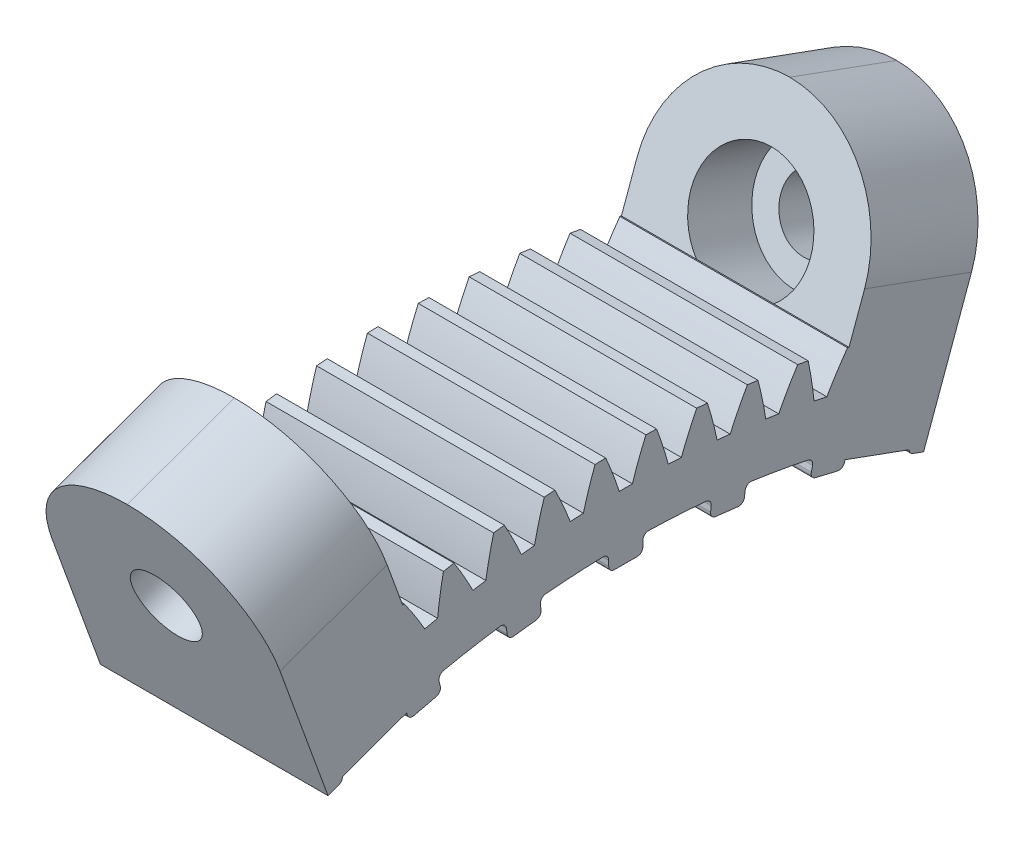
ISO-10303-21;
HEADER;
FILE_DESCRIPTION(('STEP AP214'),'2;1');
FILE_NAME('part.step','',(''),(''),'','','');
FILE_SCHEMA(('AUTOMOTIVE_DESIGN { 1 0 10303 214 1 1 1 1 }'));
ENDSEC;
DATA;
#1=APPLICATION_CONTEXT('core data for automotive mechanical design processes');
#2=APPLICATION_PROTOCOL_DEFINITION('international standard','automotive_design',2000,#1);
#3=PRODUCT_CONTEXT('',#1,'mechanical');
#4=PRODUCT('Part','Part','',(#3));
#5=PRODUCT_RELATED_PRODUCT_CATEGORY('part','',(#4));
#6=PRODUCT_DEFINITION_FORMATION('','',#4);
#7=PRODUCT_DEFINITION_CONTEXT('part definition',#1,'design');
#8=PRODUCT_DEFINITION('design','',#6,#7);
#9=PRODUCT_DEFINITION_SHAPE('','',#8);
#10=(LENGTH_UNIT() NAMED_UNIT(*) SI_UNIT(.MILLI.,.METRE.));
#11=(NAMED_UNIT(*) PLANE_ANGLE_UNIT() SI_UNIT($,.RADIAN.));
#12=(NAMED_UNIT(*) SI_UNIT($,.STERADIAN.) SOLID_ANGLE_UNIT());
#13=UNCERTAINTY_MEASURE_WITH_UNIT(LENGTH_MEASURE(1.E-05),#10,'distance_accuracy_value','');
#14=(GEOMETRIC_REPRESENTATION_CONTEXT(3) GLOBAL_UNCERTAINTY_ASSIGNED_CONTEXT((#13)) GLOBAL_UNIT_ASSIGNED_CONTEXT((#10,
#11,#12)) REPRESENTATION_CONTEXT('',''));
#15=CARTESIAN_POINT('',(0.,0.,0.));
#16=DIRECTION('',(0.,0.,1.));
#17=DIRECTION('',(1.,0.,0.));
#18=AXIS2_PLACEMENT_3D('',#15,#16,#17);
#19=CARTESIAN_POINT('',(-10.,0.,0.));
#20=DIRECTION('',(-1.,0.,0.));
#21=DIRECTION('',(0.,0.,1.));
#22=AXIS2_PLACEMENT_3D('',#19,#20,#21);
#23=CYLINDRICAL_SURFACE('',#22,42.7);
#24=DIRECTION('',(-1.,0.,0.));
#25=VECTOR('',#24,1.);
#26=CARTESIAN_POINT('',(5.,41.5744203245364,9.73948533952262));
#27=LINE('',#26,#25);
#28=CARTESIAN_POINT('',(7.64566100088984,41.5744203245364,9.73948533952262));
#29=VERTEX_POINT('',#28);
#30=CARTESIAN_POINT('',(10.,41.5744203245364,9.73948533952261));
#31=VERTEX_POINT('',#30);
#32=EDGE_CURVE('E984',#29,#31,#27,.F.);
#33=ORIENTED_EDGE('',*,*,#32,.F.);
#34=CARTESIAN_POINT('',(-7.68609646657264,0.,0.));
#35=DIRECTION('',(0.94040310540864,-0.319553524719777,-0.116307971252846));
#36=DIRECTION('',(-0.340061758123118,-0.883689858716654,-0.321636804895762));
#37=AXIS2_PLACEMENT_3D('',#34,#35,#36);
#38=ELLIPSE('',#37,45.4060601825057,42.7);
#39=CARTESIAN_POINT('',(7.64854427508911,41.5589404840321,9.80532844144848));
#40=VERTEX_POINT('',#39);
#41=EDGE_CURVE('E704',#29,#40,#38,.T.);
#42=ORIENTED_EDGE('',*,*,#41,.T.);
#43=DIRECTION('',(-1.,0.,0.));
#44=VECTOR('',#43,1.);
#45=CARTESIAN_POINT('',(-10.,41.5589404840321,9.80532844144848));
#46=LINE('',#45,#44);
#47=CARTESIAN_POINT('',(10.,41.5589404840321,9.80532844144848));
#48=VERTEX_POINT('',#47);
#49=EDGE_CURVE('E1307',#48,#40,#46,.T.);
#50=ORIENTED_EDGE('',*,*,#49,.F.);
#51=CARTESIAN_POINT('',(10.,0.,0.));
#52=DIRECTION('',(-1.,0.,0.));
#53=DIRECTION('',(0.,0.,1.));
#54=AXIS2_PLACEMENT_3D('',#51,#52,#53);
#55=CIRCLE('',#54,42.7);
#56=EDGE_CURVE('E1090',#48,#31,#55,.T.);
#57=ORIENTED_EDGE('',*,*,#56,.T.);
#58=EDGE_LOOP('',(#33,#42,#50,#57));
#59=FACE_BOUND('',#58,.T.);
#60=ADVANCED_FACE('F33',(#59),#23,.T.);
#61=DIRECTION('',(-1.,0.,0.));
#62=VECTOR('',#61,1.);
#63=CARTESIAN_POINT('',(-10.,41.5589404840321,-9.80532844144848));
#64=LINE('',#63,#62);
#65=CARTESIAN_POINT('',(0.,41.5589404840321,-9.80532844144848));
#66=VERTEX_POINT('',#65);
#67=CARTESIAN_POINT('',(3.30129104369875,41.5589404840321,-9.80532844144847));
#68=VERTEX_POINT('',#67);
#69=EDGE_CURVE('E1311',#66,#68,#64,.F.);
#70=ORIENTED_EDGE('',*,*,#69,.F.);
#71=CARTESIAN_POINT('',(0.,0.,0.));
#72=DIRECTION('',(-1.,0.,0.));
#73=DIRECTION('',(0.,0.,1.));
#74=AXIS2_PLACEMENT_3D('',#71,#72,#73);
#75=CIRCLE('',#74,42.7);
#76=CARTESIAN_POINT('',(0.,41.5744203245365,-9.73948533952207));
#77=VERTEX_POINT('',#76);
#78=EDGE_CURVE('E1452',#77,#66,#75,.T.);
#79=ORIENTED_EDGE('',*,*,#78,.F.);
#80=DIRECTION('',(-1.,0.,0.));
#81=VECTOR('',#80,1.);
#82=CARTESIAN_POINT('',(5.,41.5744203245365,-9.73948533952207));
#83=LINE('',#82,#81);
#84=CARTESIAN_POINT('',(10.,41.5744203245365,-9.73948533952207));
#85=VERTEX_POINT('',#84);
#86=EDGE_CURVE('E965',#85,#77,#83,.T.);
#87=ORIENTED_EDGE('',*,*,#86,.F.);
#88=CARTESIAN_POINT('',(10.,41.5589404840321,-9.80532844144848));
#89=VERTEX_POINT('',#88);
#90=EDGE_CURVE('E1411',#85,#89,#55,.T.);
#91=ORIENTED_EDGE('',*,*,#90,.T.);
#92=CARTESIAN_POINT('',(6.69870895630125,41.5589404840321,-9.80532844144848));
#93=VERTEX_POINT('',#92);
#94=EDGE_CURVE('E1310',#93,#89,#64,.F.);
#95=ORIENTED_EDGE('',*,*,#94,.F.);
#96=DIRECTION('',(-1.,0.,0.));
#97=VECTOR('',#96,1.);
#98=CARTESIAN_POINT('',(-10.,41.5589404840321,-9.80532844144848));
#99=LINE('',#98,#97);
#100=EDGE_CURVE('E721',#68,#93,#99,.F.);
#101=ORIENTED_EDGE('',*,*,#100,.F.);
#102=EDGE_LOOP('',(#70,#79,#87,#91,#95,#101));
#103=FACE_BOUND('',#102,.T.);
#104=ADVANCED_FACE('F1455',(#103),#23,.T.);
#105=CARTESIAN_POINT('',(10.,37.0460266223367,-9.5507544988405));
#106=DIRECTION('',(0.,-0.230613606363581,-0.973045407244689));
#107=DIRECTION('',(0.,0.973045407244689,-0.230613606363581));
#108=AXIS2_PLACEMENT_3D('',#105,#106,#107);
#109=PLANE('',#108);
#110=DIRECTION('',(0.,-0.973045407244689,0.230613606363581));
#111=VECTOR('',#110,1.);
#112=CARTESIAN_POINT('',(0.,37.0460266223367,-9.5507544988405));
#113=LINE('',#112,#111);
#114=CARTESIAN_POINT('',(0.,37.3684105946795,-9.62716011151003));
#115=VERTEX_POINT('',#114);
#116=CARTESIAN_POINT('',(0.,37.2892879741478,-9.6084079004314));
#117=VERTEX_POINT('',#116);
#118=EDGE_CURVE('E778',#115,#117,#113,.T.);
#119=ORIENTED_EDGE('',*,*,#118,.F.);
#120=DIRECTION('',(1.,0.,0.));
#121=VECTOR('',#120,1.);
#122=CARTESIAN_POINT('',(10.,37.3684105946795,-9.62716011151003));
#123=LINE('',#122,#121);
#124=CARTESIAN_POINT('',(10.,37.3684105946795,-9.62716011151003));
#125=VERTEX_POINT('',#124);
#126=EDGE_CURVE('E745',#115,#125,#123,.T.);
#127=ORIENTED_EDGE('',*,*,#126,.T.);
#128=DIRECTION('',(0.,-0.973045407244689,0.230613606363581));
#129=VECTOR('',#128,1.);
#130=CARTESIAN_POINT('',(10.,37.0460266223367,-9.5507544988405));
#131=LINE('',#130,#129);
#132=CARTESIAN_POINT('',(10.,37.2892879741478,-9.6084079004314));
#133=VERTEX_POINT('',#132);
#134=EDGE_CURVE('E780',#125,#133,#131,.T.);
#135=ORIENTED_EDGE('',*,*,#134,.T.);
#136=DIRECTION('',(-1.,0.,0.));
#137=VECTOR('',#136,1.);
#138=CARTESIAN_POINT('',(10.,37.2892879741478,-9.6084079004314));
#139=LINE('',#138,#137);
#140=EDGE_CURVE('E1265',#133,#117,#139,.T.);
#141=ORIENTED_EDGE('',*,*,#140,.T.);
#142=EDGE_LOOP('',(#119,#127,#135,#141));
#143=FACE_BOUND('',#142,.T.);
#144=ADVANCED_FACE('F1531',(#143),#109,.T.);
#145=CARTESIAN_POINT('',(10.,36.3492202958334,-12.6978023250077));
#146=DIRECTION('',(-1.,0.,0.));
#147=DIRECTION('',(0.,0.,1.));
#148=AXIS2_PLACEMENT_3D('',#145,#146,#147);
#149=CYLINDRICAL_SURFACE('',#148,0.25);
#150=CARTESIAN_POINT('',(10.,36.3492202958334,-12.6978023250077));
#151=DIRECTION('',(-1.,0.,0.));
#152=DIRECTION('',(0.,0.,1.));
#153=AXIS2_PLACEMENT_3D('',#150,#151,#152);
#154=CIRCLE('',#153,0.25);
#155=CARTESIAN_POINT('',(10.,36.3417400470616,-12.4479142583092));
#156=VERTEX_POINT('',#155);
#157=CARTESIAN_POINT('',(10.,36.1142968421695,-12.6122981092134));
#158=VERTEX_POINT('',#157);
#159=EDGE_CURVE('E1299',#156,#158,#154,.F.);
#160=ORIENTED_EDGE('',*,*,#159,.F.);
#161=DIRECTION('',(-1.,0.,0.));
#162=VECTOR('',#161,1.);
#163=CARTESIAN_POINT('',(10.,36.3417400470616,-12.4479142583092));
#164=LINE('',#163,#162);
#165=CARTESIAN_POINT('',(0.,36.3417400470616,-12.4479142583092));
#166=VERTEX_POINT('',#165);
#167=EDGE_CURVE('E738',#156,#166,#164,.T.);
#168=ORIENTED_EDGE('',*,*,#167,.T.);
#169=CARTESIAN_POINT('',(0.,36.3492202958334,-12.6978023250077));
#170=DIRECTION('',(1.,0.,0.));
#171=DIRECTION('',(0.,0.,-1.));
#172=AXIS2_PLACEMENT_3D('',#169,#170,#171);
#173=CIRCLE('',#172,0.25);
#174=CARTESIAN_POINT('',(0.,36.1142968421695,-12.6122981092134));
#175=VERTEX_POINT('',#174);
#176=EDGE_CURVE('E1293',#175,#166,#173,.F.);
#177=ORIENTED_EDGE('',*,*,#176,.F.);
#178=DIRECTION('',(-1.,0.,0.));
#179=VECTOR('',#178,1.);
#180=CARTESIAN_POINT('',(10.,36.1142968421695,-12.6122981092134));
#181=LINE('',#180,#179);
#182=EDGE_CURVE('E1296',#158,#175,#181,.T.);
#183=ORIENTED_EDGE('',*,*,#182,.F.);
#184=EDGE_LOOP('',(#160,#168,#177,#183));
#185=FACE_BOUND('',#184,.T.);
#186=ADVANCED_FACE('F2137',(#185),#149,.T.);
#187=CARTESIAN_POINT('',(2.5393379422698,41.5589404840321,9.80532844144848));
#188=VERTEX_POINT('',#187);
#189=CARTESIAN_POINT('',(0.,41.5589404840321,9.80532844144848));
#190=VERTEX_POINT('',#189);
#191=EDGE_CURVE('E1306',#188,#190,#46,.T.);
#192=ORIENTED_EDGE('',*,*,#191,.F.);
#193=CARTESIAN_POINT('',(38.2732163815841,0.,0.));
#194=DIRECTION('',(-0.764703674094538,-0.605521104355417,-0.220391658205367));
#195=DIRECTION('',(-0.6443821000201,0.718586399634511,0.261544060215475));
#196=AXIS2_PLACEMENT_3D('',#193,#194,#195);
#197=ELLIPSE('',#196,55.8386227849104,42.7);
#198=CARTESIAN_POINT('',(2.54605675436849,41.5744203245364,9.73948533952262));
#199=VERTEX_POINT('',#198);
#200=EDGE_CURVE('E698',#188,#199,#197,.T.);
#201=ORIENTED_EDGE('',*,*,#200,.T.);
#202=CARTESIAN_POINT('',(0.,41.5744203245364,9.73948533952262));
#203=VERTEX_POINT('',#202);
#204=EDGE_CURVE('E985',#203,#199,#27,.F.);
#205=ORIENTED_EDGE('',*,*,#204,.F.);
#206=EDGE_CURVE('E1084',#190,#203,#75,.T.);
#207=ORIENTED_EDGE('',*,*,#206,.F.);
#208=EDGE_LOOP('',(#192,#201,#205,#207));
#209=FACE_BOUND('',#208,.T.);
#210=ADVANCED_FACE('F1380',(#209),#23,.T.);
#211=CARTESIAN_POINT('',(10.,37.0460266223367,9.5507544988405));
#212=DIRECTION('',(0.,0.230613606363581,-0.973045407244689));
#213=DIRECTION('',(0.,0.973045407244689,0.230613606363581));
#214=AXIS2_PLACEMENT_3D('',#211,#212,#213);
#215=PLANE('',#214);
#216=DIRECTION('',(1.,0.,0.));
#217=VECTOR('',#216,1.);
#218=CARTESIAN_POINT('',(10.,37.3684105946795,9.62716011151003));
#219=LINE('',#218,#217);
#220=CARTESIAN_POINT('',(0.,37.3684105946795,9.62716011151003));
#221=VERTEX_POINT('',#220);
#222=CARTESIAN_POINT('',(10.,37.3684105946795,9.62716011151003));
#223=VERTEX_POINT('',#222);
#224=EDGE_CURVE('E762',#221,#223,#219,.T.);
#225=ORIENTED_EDGE('',*,*,#224,.F.);
#226=DIRECTION('',(0.,-0.973045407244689,-0.230613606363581));
#227=VECTOR('',#226,1.);
#228=CARTESIAN_POINT('',(0.,37.0460266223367,9.5507544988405));
#229=LINE('',#228,#227);
#230=CARTESIAN_POINT('',(0.,37.2892879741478,9.6084079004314));
#231=VERTEX_POINT('',#230);
#232=EDGE_CURVE('E816',#221,#231,#229,.T.);
#233=ORIENTED_EDGE('',*,*,#232,.T.);
#234=DIRECTION('',(-1.,0.,0.));
#235=VECTOR('',#234,1.);
#236=CARTESIAN_POINT('',(10.,37.2892879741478,9.6084079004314));
#237=LINE('',#236,#235);
#238=CARTESIAN_POINT('',(10.,37.2892879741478,9.6084079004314));
#239=VERTEX_POINT('',#238);
#240=EDGE_CURVE('E1173',#231,#239,#237,.F.);
#241=ORIENTED_EDGE('',*,*,#240,.T.);
#242=DIRECTION('',(0.,-0.973045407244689,-0.230613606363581));
#243=VECTOR('',#242,1.);
#244=CARTESIAN_POINT('',(10.,37.0460266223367,9.5507544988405));
#245=LINE('',#244,#243);
#246=EDGE_CURVE('E819',#223,#239,#245,.T.);
#247=ORIENTED_EDGE('',*,*,#246,.F.);
#248=EDGE_LOOP('',(#225,#233,#241,#247));
#249=FACE_BOUND('',#248,.T.);
#250=ADVANCED_FACE('F2155',(#249),#215,.F.);
#251=CARTESIAN_POINT('',(10.,36.3492202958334,12.6978023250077));
#252=DIRECTION('',(-1.,0.,0.));
#253=DIRECTION('',(0.,0.,1.));
#254=AXIS2_PLACEMENT_3D('',#251,#252,#253);
#255=CYLINDRICAL_SURFACE('',#254,0.25);
#256=CARTESIAN_POINT('',(0.,36.3492202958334,12.6978023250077));
#257=DIRECTION('',(1.,0.,0.));
#258=DIRECTION('',(0.,0.,-1.));
#259=AXIS2_PLACEMENT_3D('',#256,#257,#258);
#260=CIRCLE('',#259,0.25);
#261=CARTESIAN_POINT('',(0.,36.3417400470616,12.4479142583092));
#262=VERTEX_POINT('',#261);
#263=CARTESIAN_POINT('',(0.,36.1142968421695,12.6122981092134));
#264=VERTEX_POINT('',#263);
#265=EDGE_CURVE('E1205',#262,#264,#260,.F.);
#266=ORIENTED_EDGE('',*,*,#265,.F.);
#267=DIRECTION('',(-1.,0.,0.));
#268=VECTOR('',#267,1.);
#269=CARTESIAN_POINT('',(10.,36.3417400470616,12.4479142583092));
#270=LINE('',#269,#268);
#271=CARTESIAN_POINT('',(10.,36.3417400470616,12.4479142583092));
#272=VERTEX_POINT('',#271);
#273=EDGE_CURVE('E756',#262,#272,#270,.F.);
#274=ORIENTED_EDGE('',*,*,#273,.T.);
#275=CARTESIAN_POINT('',(10.,36.3492202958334,12.6978023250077));
#276=DIRECTION('',(-1.,0.,0.));
#277=DIRECTION('',(0.,0.,1.));
#278=AXIS2_PLACEMENT_3D('',#275,#276,#277);
#279=CIRCLE('',#278,0.25);
#280=CARTESIAN_POINT('',(10.,36.1142968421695,12.6122981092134));
#281=VERTEX_POINT('',#280);
#282=EDGE_CURVE('E1207',#281,#272,#279,.F.);
#283=ORIENTED_EDGE('',*,*,#282,.F.);
#284=DIRECTION('',(-1.,0.,0.));
#285=VECTOR('',#284,1.);
#286=CARTESIAN_POINT('',(10.,36.1142968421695,12.6122981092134));
#287=LINE('',#286,#285);
#288=EDGE_CURVE('E1202',#264,#281,#287,.F.);
#289=ORIENTED_EDGE('',*,*,#288,.F.);
#290=EDGE_LOOP('',(#266,#274,#283,#289));
#291=FACE_BOUND('',#290,.T.);
#292=ADVANCED_FACE('F1932',(#291),#255,.T.);
#293=CARTESIAN_POINT('',(0.,0.,0.));
#294=DIRECTION('',(1.,0.,0.));
#295=DIRECTION('',(0.,0.,-1.));
#296=AXIS2_PLACEMENT_3D('',#293,#294,#295);
#297=CYLINDRICAL_SURFACE('',#296,39.);
#298=CARTESIAN_POINT('',(0.,0.,0.));
#299=DIRECTION('',(1.,0.,0.));
#300=DIRECTION('',(0.,0.,-1.));
#301=AXIS2_PLACEMENT_3D('',#298,#299,#300);
#302=CIRCLE('',#301,39.);
#303=CARTESIAN_POINT('',(0.,38.1682337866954,-8.01161217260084));
#304=VERTEX_POINT('',#303);
#305=CARTESIAN_POINT('',(0.,38.6065596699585,-5.52571718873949));
#306=VERTEX_POINT('',#305);
#307=EDGE_CURVE('E874',#304,#306,#302,.T.);
#308=ORIENTED_EDGE('',*,*,#307,.F.);
#309=DIRECTION('',(1.,0.,0.));
#310=VECTOR('',#309,1.);
#311=CARTESIAN_POINT('',(0.,38.1682337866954,-8.01161217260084));
#312=LINE('',#311,#310);
#313=CARTESIAN_POINT('',(10.,38.1682337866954,-8.01161217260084));
#314=VERTEX_POINT('',#313);
#315=EDGE_CURVE('E1282',#304,#314,#312,.T.);
#316=ORIENTED_EDGE('',*,*,#315,.T.);
#317=CARTESIAN_POINT('',(10.,0.,0.));
#318=DIRECTION('',(1.,0.,0.));
#319=DIRECTION('',(0.,0.,-1.));
#320=AXIS2_PLACEMENT_3D('',#317,#318,#319);
#321=CIRCLE('',#320,39.);
#322=CARTESIAN_POINT('',(10.,38.6065596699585,-5.52571718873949));
#323=VERTEX_POINT('',#322);
#324=EDGE_CURVE('E880',#314,#323,#321,.T.);
#325=ORIENTED_EDGE('',*,*,#324,.T.);
#326=DIRECTION('',(1.,0.,0.));
#327=VECTOR('',#326,1.);
#328=CARTESIAN_POINT('',(0.,38.6065596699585,-5.52571718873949));
#329=LINE('',#328,#327);
#330=EDGE_CURVE('E1228',#323,#306,#329,.F.);
#331=ORIENTED_EDGE('',*,*,#330,.T.);
#332=EDGE_LOOP('',(#308,#316,#325,#331));
#333=FACE_BOUND('',#332,.T.);
#334=ADVANCED_FACE('F1790',(#333),#297,.F.);
#335=CARTESIAN_POINT('',(0.,38.8402411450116,-3.52642422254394));
#336=VERTEX_POINT('',#335);
#337=CARTESIAN_POINT('',(0.,38.9870113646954,-1.00645161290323));
#338=VERTEX_POINT('',#337);
#339=EDGE_CURVE('E878',#336,#338,#302,.T.);
#340=ORIENTED_EDGE('',*,*,#339,.F.);
#341=DIRECTION('',(1.,0.,0.));
#342=VECTOR('',#341,1.);
#343=CARTESIAN_POINT('',(0.,38.8402411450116,-3.52642422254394));
#344=LINE('',#343,#342);
#345=CARTESIAN_POINT('',(10.,38.8402411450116,-3.52642422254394));
#346=VERTEX_POINT('',#345);
#347=EDGE_CURVE('E1249',#336,#346,#344,.T.);
#348=ORIENTED_EDGE('',*,*,#347,.T.);
#349=CARTESIAN_POINT('',(10.,38.9870113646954,-1.00645161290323));
#350=VERTEX_POINT('',#349);
#351=EDGE_CURVE('E862',#346,#350,#321,.T.);
#352=ORIENTED_EDGE('',*,*,#351,.T.);
#353=DIRECTION('',(1.,0.,0.));
#354=VECTOR('',#353,1.);
#355=CARTESIAN_POINT('',(0.,38.9870113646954,-1.00645161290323));
#356=LINE('',#355,#354);
#357=EDGE_CURVE('E1119',#350,#338,#356,.F.);
#358=ORIENTED_EDGE('',*,*,#357,.T.);
#359=EDGE_LOOP('',(#340,#348,#352,#358));
#360=FACE_BOUND('',#359,.T.);
#361=ADVANCED_FACE('F1787',(#360),#297,.F.);
#362=CARTESIAN_POINT('',(10.,38.6065596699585,5.52571718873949));
#363=VERTEX_POINT('',#362);
#364=CARTESIAN_POINT('',(10.,38.1682337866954,8.01161217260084));
#365=VERTEX_POINT('',#364);
#366=EDGE_CURVE('E879',#363,#365,#321,.T.);
#367=ORIENTED_EDGE('',*,*,#366,.T.);
#368=DIRECTION('',(1.,0.,0.));
#369=VECTOR('',#368,1.);
#370=CARTESIAN_POINT('',(0.,38.1682337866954,8.01161217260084));
#371=LINE('',#370,#369);
#372=CARTESIAN_POINT('',(0.,38.1682337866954,8.01161217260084));
#373=VERTEX_POINT('',#372);
#374=EDGE_CURVE('E1196',#365,#373,#371,.F.);
#375=ORIENTED_EDGE('',*,*,#374,.T.);
#376=CARTESIAN_POINT('',(0.,38.6065596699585,5.52571718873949));
#377=VERTEX_POINT('',#376);
#378=EDGE_CURVE('E873',#377,#373,#302,.T.);
#379=ORIENTED_EDGE('',*,*,#378,.F.);
#380=DIRECTION('',(1.,0.,0.));
#381=VECTOR('',#380,1.);
#382=CARTESIAN_POINT('',(0.,38.6065596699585,5.52571718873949));
#383=LINE('',#382,#381);
#384=EDGE_CURVE('E1142',#377,#363,#383,.T.);
#385=ORIENTED_EDGE('',*,*,#384,.T.);
#386=EDGE_LOOP('',(#367,#375,#379,#385));
#387=FACE_BOUND('',#386,.T.);
#388=ADVANCED_FACE('F1781',(#387),#297,.F.);
#389=CARTESIAN_POINT('',(10.,38.9870113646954,1.00645161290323));
#390=VERTEX_POINT('',#389);
#391=CARTESIAN_POINT('',(10.,38.8402411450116,3.52642422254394));
#392=VERTEX_POINT('',#391);
#393=EDGE_CURVE('E875',#390,#392,#321,.T.);
#394=ORIENTED_EDGE('',*,*,#393,.T.);
#395=DIRECTION('',(1.,0.,0.));
#396=VECTOR('',#395,1.);
#397=CARTESIAN_POINT('',(0.,38.8402411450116,3.52642422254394));
#398=LINE('',#397,#396);
#399=CARTESIAN_POINT('',(0.,38.8402411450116,3.52642422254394));
#400=VERTEX_POINT('',#399);
#401=EDGE_CURVE('E1163',#392,#400,#398,.F.);
#402=ORIENTED_EDGE('',*,*,#401,.T.);
#403=CARTESIAN_POINT('',(0.,38.9870113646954,1.00645161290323));
#404=VERTEX_POINT('',#403);
#405=EDGE_CURVE('E869',#404,#400,#302,.T.);
#406=ORIENTED_EDGE('',*,*,#405,.F.);
#407=DIRECTION('',(1.,0.,0.));
#408=VECTOR('',#407,1.);
#409=CARTESIAN_POINT('',(0.,38.9870113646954,1.00645161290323));
#410=LINE('',#409,#408);
#411=EDGE_CURVE('E1122',#404,#390,#410,.T.);
#412=ORIENTED_EDGE('',*,*,#411,.T.);
#413=EDGE_LOOP('',(#394,#402,#406,#412));
#414=FACE_BOUND('',#413,.T.);
#415=ADVANCED_FACE('F1786',(#414),#297,.F.);
#416=CARTESIAN_POINT('',(10.,0.,0.));
#417=DIRECTION('',(-1.,0.,0.));
#418=DIRECTION('',(0.,0.,1.));
#419=AXIS2_PLACEMENT_3D('',#416,#417,#418);
#420=PLANE('',#419);
#421=DIRECTION('',(0.,0.93969262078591,-0.342020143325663));
#422=VECTOR('',#421,1.);
#423=CARTESIAN_POINT('',(10.,0.,0.));
#424=LINE('',#423,#422);
#425=CARTESIAN_POINT('',(10.,35.9432427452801,-13.0822704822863));
#426=VERTEX_POINT('',#425);
#427=CARTESIAN_POINT('',(10.,41.7294022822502,-15.1882603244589));
#428=VERTEX_POINT('',#427);
#429=EDGE_CURVE('E767',#426,#428,#424,.T.);
#430=ORIENTED_EDGE('',*,*,#429,.T.);
#431=DIRECTION('',(0.,0.342020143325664,0.93969262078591));
#432=VECTOR('',#431,1.);
#433=CARTESIAN_POINT('',(10.,41.7294022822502,-15.1882603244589));
#434=LINE('',#433,#432);
#435=CARTESIAN_POINT('',(10.,43.4395029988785,-10.4897972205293));
#436=VERTEX_POINT('',#435);
#437=EDGE_CURVE('E1330',#428,#436,#434,.T.);
#438=ORIENTED_EDGE('',*,*,#437,.T.);
#439=DIRECTION('',(0.,-0.93969262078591,0.342020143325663));
#440=VECTOR('',#439,1.);
#441=CARTESIAN_POINT('',(10.,37.801347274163,-8.43767636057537));
#442=LINE('',#441,#440);
#443=EDGE_CURVE('E731',#436,#89,#442,.T.);
#444=ORIENTED_EDGE('',*,*,#443,.T.);
#445=ORIENTED_EDGE('',*,*,#90,.F.);
#446=CARTESIAN_POINT('',(10.,31.7865624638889,-23.3937095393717));
#447=DIRECTION('',(-1.,0.,0.));
#448=DIRECTION('',(0.,-0.207911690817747,-0.978147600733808));
#449=AXIS2_PLACEMENT_3D('',#446,#447,#448);
#450=CIRCLE('',#449,16.8);
#451=CARTESIAN_POINT('',(10.,40.1644580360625,-8.83174312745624));
#452=VERTEX_POINT('',#451);
#453=EDGE_CURVE('E946',#452,#85,#450,.T.);
#454=ORIENTED_EDGE('',*,*,#453,.F.);
#455=CARTESIAN_POINT('',(10.,0.,0.));
#456=DIRECTION('',(-1.,0.,0.));
#457=DIRECTION('',(0.,-0.207911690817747,-0.978147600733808));
#458=AXIS2_PLACEMENT_3D('',#455,#456,#457);
#459=CIRCLE('',#458,41.124);
#460=CARTESIAN_POINT('',(10.,40.2842517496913,-8.26815801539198));
#461=VERTEX_POINT('',#460);
#462=EDGE_CURVE('E951',#461,#452,#459,.T.);
#463=ORIENTED_EDGE('',*,*,#462,.F.);
#464=CARTESIAN_POINT('',(10.,38.5535486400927,8.44245737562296));
#465=DIRECTION('',(-1.,0.,0.));
#466=DIRECTION('',(0.,-0.207911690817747,-0.978147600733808));
#467=AXIS2_PLACEMENT_3D('',#464,#465,#466);
#468=CIRCLE('',#467,16.8);
#469=CARTESIAN_POINT('',(10.,41.9415284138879,-8.01237756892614));
#470=VERTEX_POINT('',#469);
#471=EDGE_CURVE('E948',#470,#461,#468,.T.);
#472=ORIENTED_EDGE('',*,*,#471,.F.);
#473=CARTESIAN_POINT('',(10.,42.027169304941,-7.5503006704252));
#474=VERTEX_POINT('',#473);
#475=EDGE_CURVE('E1414',#474,#470,#55,.T.);
#476=ORIENTED_EDGE('',*,*,#475,.F.);
#477=CARTESIAN_POINT('',(10.,32.9673322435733,-21.6980691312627));
#478=DIRECTION('',(-1.,0.,0.));
#479=DIRECTION('',(0.,-0.156434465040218,-0.98768834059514));
#480=AXIS2_PLACEMENT_3D('',#477,#478,#479);
#481=CIRCLE('',#480,16.8);
#482=CARTESIAN_POINT('',(10.,40.5716317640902,-6.7175942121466));
#483=VERTEX_POINT('',#482);
#484=EDGE_CURVE('E924',#483,#474,#481,.T.);
#485=ORIENTED_EDGE('',*,*,#484,.F.);
#486=CARTESIAN_POINT('',(10.,0.,0.));
#487=DIRECTION('',(-1.,0.,0.));
#488=DIRECTION('',(0.,-0.156434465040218,-0.98768834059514));
#489=AXIS2_PLACEMENT_3D('',#486,#487,#488);
#490=CIRCLE('',#489,41.124);
#491=CARTESIAN_POINT('',(10.,40.6617655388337,-6.1485119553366));
#492=VERTEX_POINT('',#491);
#493=EDGE_CURVE('E929',#492,#483,#490,.T.);
#494=ORIENTED_EDGE('',*,*,#493,.F.);
#495=CARTESIAN_POINT('',(10.,38.0588682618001,10.4486241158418));
#496=DIRECTION('',(-1.,0.,0.));
#497=DIRECTION('',(0.,-0.156434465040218,-0.98768834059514));
#498=AXIS2_PLACEMENT_3D('',#495,#496,#497);
#499=CIRCLE('',#498,16.8);
#500=CARTESIAN_POINT('',(10.,42.3033844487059,-5.80634688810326));
#501=VERTEX_POINT('',#500);
#502=EDGE_CURVE('E926',#501,#492,#499,.T.);
#503=ORIENTED_EDGE('',*,*,#502,.F.);
#504=CARTESIAN_POINT('',(10.,42.3647247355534,-5.34042115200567));
#505=VERTEX_POINT('',#504);
#506=EDGE_CURVE('E1416',#505,#501,#55,.T.);
#507=ORIENTED_EDGE('',*,*,#506,.F.);
#508=CARTESIAN_POINT('',(10.,34.0577408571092,-19.9429558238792));
#509=DIRECTION('',(-1.,0.,0.));
#510=DIRECTION('',(0.,-0.10452846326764,-0.994521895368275));
#511=AXIS2_PLACEMENT_3D('',#508,#509,#510);
#512=CIRCLE('',#511,16.8);
#513=CARTESIAN_POINT('',(10.,40.8676014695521,-4.58503283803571));
#514=VERTEX_POINT('',#513);
#515=EDGE_CURVE('E902',#514,#505,#512,.T.);
#516=ORIENTED_EDGE('',*,*,#515,.F.);
#517=CARTESIAN_POINT('',(10.,0.,0.));
#518=DIRECTION('',(-1.,0.,0.));
#519=DIRECTION('',(0.,-0.10452846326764,-0.994521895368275));
#520=AXIS2_PLACEMENT_3D('',#517,#518,#519);
#521=CIRCLE('',#520,41.124);
#522=CARTESIAN_POINT('',(10.,40.9278282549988,-4.01201325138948));
#523=VERTEX_POINT('',#522);
#524=EDGE_CURVE('E907',#523,#514,#521,.T.);
#525=ORIENTED_EDGE('',*,*,#524,.F.);
#526=CARTESIAN_POINT('',(10.,37.4598711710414,12.4261519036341));
#527=DIRECTION('',(-1.,0.,0.));
#528=DIRECTION('',(0.,-0.10452846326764,-0.994521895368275));
#529=AXIS2_PLACEMENT_3D('',#526,#527,#528);
#530=CIRCLE('',#529,16.8);
#531=CARTESIAN_POINT('',(10.,42.5492898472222,-3.58440141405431));
#532=VERTEX_POINT('',#531);
#533=EDGE_CURVE('E904',#532,#523,#530,.T.);
#534=ORIENTED_EDGE('',*,*,#533,.F.);
#535=CARTESIAN_POINT('',(10.,42.5861614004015,-3.11590391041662));
#536=VERTEX_POINT('',#535);
#537=EDGE_CURVE('E1089',#536,#532,#55,.T.);
#538=ORIENTED_EDGE('',*,*,#537,.F.);
#539=CARTESIAN_POINT('',(10.,35.0547995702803,-18.1331802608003));
#540=DIRECTION('',(-1.,0.,0.));
#541=DIRECTION('',(0.,-0.0523359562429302,-0.998629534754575));
#542=AXIS2_PLACEMENT_3D('',#539,#540,#541);
#543=CIRCLE('',#542,16.8);
#544=CARTESIAN_POINT('',(10.,41.051555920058,-2.43990420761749));
#545=VERTEX_POINT('',#544);
#546=EDGE_CURVE('E881',#545,#536,#543,.T.);
#547=ORIENTED_EDGE('',*,*,#546,.F.);
#548=CARTESIAN_POINT('',(10.,0.,0.));
#549=DIRECTION('',(-1.,0.,0.));
#550=DIRECTION('',(0.,-0.0523359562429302,-0.998629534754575));
#551=AXIS2_PLACEMENT_3D('',#548,#549,#550);
#552=CIRCLE('',#551,41.124);
#553=CARTESIAN_POINT('',(10.,41.0817106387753,-1.86451789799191));
#554=VERTEX_POINT('',#553);
#555=EDGE_CURVE('E886',#554,#545,#552,.T.);
#556=ORIENTED_EDGE('',*,*,#555,.F.);
#557=CARTESIAN_POINT('',(10.,36.7581991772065,14.3696204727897));
#558=DIRECTION('',(-1.,0.,0.));
#559=DIRECTION('',(0.,-0.0523359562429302,-0.998629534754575));
#560=AXIS2_PLACEMENT_3D('',#557,#558,#559);
#561=CIRCLE('',#560,16.8);
#562=CARTESIAN_POINT('',(10.,42.6785705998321,-1.35263134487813));
#563=VERTEX_POINT('',#562);
#564=EDGE_CURVE('E883',#563,#554,#561,.T.);
#565=ORIENTED_EDGE('',*,*,#564,.F.);
#566=CARTESIAN_POINT('',(10.,42.690872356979,-0.882846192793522));
#567=VERTEX_POINT('',#566);
#568=EDGE_CURVE('E1085',#567,#563,#55,.T.);
#569=ORIENTED_EDGE('',*,*,#568,.F.);
#570=CARTESIAN_POINT('',(10.,35.9557755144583,-16.273702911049));
#571=DIRECTION('',(-1.,0.,0.));
#572=DIRECTION('',(0.,0.,-1.));
#573=AXIS2_PLACEMENT_3D('',#570,#571,#572);
#574=CIRCLE('',#573,16.8);
#575=CARTESIAN_POINT('',(10.,41.1229909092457,-0.288087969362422));
#576=VERTEX_POINT('',#575);
#577=EDGE_CURVE('E1057',#576,#567,#574,.T.);
#578=ORIENTED_EDGE('',*,*,#577,.F.);
#579=CARTESIAN_POINT('',(10.,0.,0.));
#580=DIRECTION('',(-1.,0.,0.));
#581=DIRECTION('',(0.,0.,-1.));
#582=AXIS2_PLACEMENT_3D('',#579,#580,#581);
#583=CIRCLE('',#582,41.124);
#584=CARTESIAN_POINT('',(10.,41.1229909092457,0.288087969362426));
#585=VERTEX_POINT('',#584);
#586=EDGE_CURVE('E1062',#585,#576,#583,.T.);
#587=ORIENTED_EDGE('',*,*,#586,.F.);
#588=CARTESIAN_POINT('',(10.,35.9557755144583,16.273702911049));
#589=DIRECTION('',(-1.,0.,0.));
#590=DIRECTION('',(0.,0.,-1.));
#591=AXIS2_PLACEMENT_3D('',#588,#589,#590);
#592=CIRCLE('',#591,16.8);
#593=CARTESIAN_POINT('',(10.,42.690872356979,0.882846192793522));
#594=VERTEX_POINT('',#593);
#595=EDGE_CURVE('E1059',#594,#585,#592,.T.);
#596=ORIENTED_EDGE('',*,*,#595,.F.);
#597=CARTESIAN_POINT('',(10.,42.6785705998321,1.35263134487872));
#598=VERTEX_POINT('',#597);
#599=EDGE_CURVE('E1082',#598,#594,#55,.T.);
#600=ORIENTED_EDGE('',*,*,#599,.F.);
#601=CARTESIAN_POINT('',(10.,36.7581991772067,-14.3696204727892));
#602=DIRECTION('',(-1.,0.,0.));
#603=DIRECTION('',(0.,0.052335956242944,-0.998629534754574));
#604=AXIS2_PLACEMENT_3D('',#601,#602,#603);
#605=CIRCLE('',#604,16.8);
#606=CARTESIAN_POINT('',(10.,41.0817106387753,1.86451789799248));
#607=VERTEX_POINT('',#606);
#608=EDGE_CURVE('E1035',#607,#598,#605,.T.);
#609=ORIENTED_EDGE('',*,*,#608,.F.);
#610=CARTESIAN_POINT('',(10.,0.,0.));
#611=DIRECTION('',(-1.,0.,0.));
#612=DIRECTION('',(0.,0.052335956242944,-0.998629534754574));
#613=AXIS2_PLACEMENT_3D('',#610,#611,#612);
#614=CIRCLE('',#613,41.124);
#615=CARTESIAN_POINT('',(10.,41.051555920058,2.43990420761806));
#616=VERTEX_POINT('',#615);
#617=EDGE_CURVE('E1040',#616,#607,#614,.T.);
#618=ORIENTED_EDGE('',*,*,#617,.F.);
#619=CARTESIAN_POINT('',(10.,35.0547995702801,18.1331802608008));
#620=DIRECTION('',(-1.,0.,0.));
#621=DIRECTION('',(0.,0.052335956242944,-0.998629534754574));
#622=AXIS2_PLACEMENT_3D('',#619,#620,#621);
#623=CIRCLE('',#622,16.8);
#624=CARTESIAN_POINT('',(10.,42.5861614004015,3.11590391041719));
#625=VERTEX_POINT('',#624);
#626=EDGE_CURVE('E1037',#625,#616,#623,.T.);
#627=ORIENTED_EDGE('',*,*,#626,.F.);
#628=CARTESIAN_POINT('',(10.,42.5492898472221,3.58440141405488));
#629=VERTEX_POINT('',#628);
#630=EDGE_CURVE('E1481',#629,#625,#55,.T.);
#631=ORIENTED_EDGE('',*,*,#630,.F.);
#632=CARTESIAN_POINT('',(10.,37.4598711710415,-12.4261519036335));
#633=DIRECTION('',(-1.,0.,0.));
#634=DIRECTION('',(0.,0.104528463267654,-0.994521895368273));
#635=AXIS2_PLACEMENT_3D('',#632,#633,#634);
#636=CIRCLE('',#635,16.8);
#637=CARTESIAN_POINT('',(10.,40.9278282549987,4.01201325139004));
#638=VERTEX_POINT('',#637);
#639=EDGE_CURVE('E1013',#638,#629,#636,.T.);
#640=ORIENTED_EDGE('',*,*,#639,.F.);
#641=CARTESIAN_POINT('',(10.,0.,0.));
#642=DIRECTION('',(-1.,0.,0.));
#643=DIRECTION('',(0.,0.104528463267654,-0.994521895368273));
#644=AXIS2_PLACEMENT_3D('',#641,#642,#643);
#645=CIRCLE('',#644,41.124);
#646=CARTESIAN_POINT('',(10.,40.867601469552,4.58503283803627));
#647=VERTEX_POINT('',#646);
#648=EDGE_CURVE('E1018',#647,#638,#645,.T.);
#649=ORIENTED_EDGE('',*,*,#648,.F.);
#650=CARTESIAN_POINT('',(10.,34.0577408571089,19.9429558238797));
#651=DIRECTION('',(-1.,0.,0.));
#652=DIRECTION('',(0.,0.104528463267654,-0.994521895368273));
#653=AXIS2_PLACEMENT_3D('',#650,#651,#652);
#654=CIRCLE('',#653,16.8);
#655=CARTESIAN_POINT('',(10.,42.3647247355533,5.34042115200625));
#656=VERTEX_POINT('',#655);
#657=EDGE_CURVE('E1015',#656,#647,#654,.T.);
#658=ORIENTED_EDGE('',*,*,#657,.F.);
#659=CARTESIAN_POINT('',(10.,42.3033844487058,5.80634688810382));
#660=VERTEX_POINT('',#659);
#661=EDGE_CURVE('E1415',#660,#656,#55,.T.);
#662=ORIENTED_EDGE('',*,*,#661,.F.);
#663=CARTESIAN_POINT('',(10.,38.0588682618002,-10.4486241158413));
#664=DIRECTION('',(-1.,0.,0.));
#665=DIRECTION('',(0.,0.156434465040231,-0.987688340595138));
#666=AXIS2_PLACEMENT_3D('',#663,#664,#665);
#667=CIRCLE('',#666,16.8);
#668=CARTESIAN_POINT('',(10.,40.6617655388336,6.14851195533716));
#669=VERTEX_POINT('',#668);
#670=EDGE_CURVE('E991',#669,#660,#667,.T.);
#671=ORIENTED_EDGE('',*,*,#670,.F.);
#672=CARTESIAN_POINT('',(10.,0.,0.));
#673=DIRECTION('',(-1.,0.,0.));
#674=DIRECTION('',(0.,0.156434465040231,-0.987688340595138));
#675=AXIS2_PLACEMENT_3D('',#672,#673,#674);
#676=CIRCLE('',#675,41.124);
#677=CARTESIAN_POINT('',(10.,40.5716317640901,6.71759421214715));
#678=VERTEX_POINT('',#677);
#679=EDGE_CURVE('E996',#678,#669,#676,.T.);
#680=ORIENTED_EDGE('',*,*,#679,.F.);
#681=CARTESIAN_POINT('',(10.,32.967332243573,21.6980691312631));
#682=DIRECTION('',(-1.,0.,0.));
#683=DIRECTION('',(0.,0.156434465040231,-0.987688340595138));
#684=AXIS2_PLACEMENT_3D('',#681,#682,#683);
#685=CIRCLE('',#684,16.8);
#686=CARTESIAN_POINT('',(10.,42.0271693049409,7.55030067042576));
#687=VERTEX_POINT('',#686);
#688=EDGE_CURVE('E993',#687,#678,#685,.T.);
#689=ORIENTED_EDGE('',*,*,#688,.F.);
#690=CARTESIAN_POINT('',(10.,41.9415284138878,8.01237756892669));
#691=VERTEX_POINT('',#690);
#692=EDGE_CURVE('E1412',#691,#687,#55,.T.);
#693=ORIENTED_EDGE('',*,*,#692,.F.);
#694=CARTESIAN_POINT('',(10.,38.5535486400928,-8.44245737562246));
#695=DIRECTION('',(-1.,0.,0.));
#696=DIRECTION('',(0.,0.20791169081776,-0.978147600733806));
#697=AXIS2_PLACEMENT_3D('',#694,#695,#696);
#698=CIRCLE('',#697,16.8);
#699=CARTESIAN_POINT('',(10.,40.2842517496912,8.26815801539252));
#700=VERTEX_POINT('',#699);
#701=EDGE_CURVE('E968',#700,#691,#698,.T.);
#702=ORIENTED_EDGE('',*,*,#701,.F.);
#703=CARTESIAN_POINT('',(10.,0.,0.));
#704=DIRECTION('',(-1.,0.,0.));
#705=DIRECTION('',(0.,0.20791169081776,-0.978147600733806));
#706=AXIS2_PLACEMENT_3D('',#703,#704,#705);
#707=CIRCLE('',#706,41.124);
#708=CARTESIAN_POINT('',(10.,40.1644580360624,8.83174312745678));
#709=VERTEX_POINT('',#708);
#710=EDGE_CURVE('E973',#709,#700,#707,.T.);
#711=ORIENTED_EDGE('',*,*,#710,.F.);
#712=CARTESIAN_POINT('',(10.,31.7865624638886,23.3937095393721));
#713=DIRECTION('',(-1.,0.,0.));
#714=DIRECTION('',(0.,0.20791169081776,-0.978147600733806));
#715=AXIS2_PLACEMENT_3D('',#712,#713,#714);
#716=CIRCLE('',#715,16.8);
#717=EDGE_CURVE('E970',#31,#709,#716,.T.);
#718=ORIENTED_EDGE('',*,*,#717,.F.);
#719=ORIENTED_EDGE('',*,*,#56,.F.);
#720=DIRECTION('',(0.,0.93969262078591,0.342020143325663));
#721=VECTOR('',#720,1.);
#722=CARTESIAN_POINT('',(10.,37.801347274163,8.43767636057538));
#723=LINE('',#722,#721);
#724=CARTESIAN_POINT('',(10.,43.4395029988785,10.4897972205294));
#725=VERTEX_POINT('',#724);
#726=EDGE_CURVE('E752',#48,#725,#723,.T.);
#727=ORIENTED_EDGE('',*,*,#726,.T.);
#728=DIRECTION('',(0.,-0.342020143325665,0.93969262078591));
#729=VECTOR('',#728,1.);
#730=CARTESIAN_POINT('',(10.,41.7294022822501,15.188260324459));
#731=LINE('',#730,#729);
#732=CARTESIAN_POINT('',(10.,41.7294022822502,15.1882603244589));
#733=VERTEX_POINT('',#732);
#734=EDGE_CURVE('E1328',#725,#733,#731,.T.);
#735=ORIENTED_EDGE('',*,*,#734,.T.);
#736=DIRECTION('',(0.,-0.93969262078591,-0.342020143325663));
#737=VECTOR('',#736,1.);
#738=CARTESIAN_POINT('',(10.,0.,0.));
#739=LINE('',#738,#737);
#740=CARTESIAN_POINT('',(10.,35.94324274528,13.0822704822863));
#741=VERTEX_POINT('',#740);
#742=EDGE_CURVE('E765',#733,#741,#739,.T.);
#743=ORIENTED_EDGE('',*,*,#742,.T.);
#744=DIRECTION('',(0.,0.342016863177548,-0.939693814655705));
#745=VECTOR('',#744,1.);
#746=CARTESIAN_POINT('',(10.,35.6867757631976,13.786915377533));
#747=LINE('',#746,#745);
#748=EDGE_CURVE('E814',#741,#281,#747,.T.);
#749=ORIENTED_EDGE('',*,*,#748,.T.);
#750=ORIENTED_EDGE('',*,*,#282,.T.);
#751=DIRECTION('',(0.,0.342020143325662,-0.939692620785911));
#752=VECTOR('',#751,1.);
#753=CARTESIAN_POINT('',(10.,36.0912465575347,13.1361394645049));
#754=LINE('',#753,#752);
#755=EDGE_CURVE('E749',#272,#223,#754,.T.);
#756=ORIENTED_EDGE('',*,*,#755,.T.);
#757=ORIENTED_EDGE('',*,*,#246,.T.);
#758=CARTESIAN_POINT('',(10.,37.3469413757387,9.36514654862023));
#759=DIRECTION('',(-1.,0.,0.));
#760=DIRECTION('',(0.,0.,1.));
#761=AXIS2_PLACEMENT_3D('',#758,#759,#760);
#762=CIRCLE('',#761,0.25);
#763=CARTESIAN_POINT('',(10.,37.1036800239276,9.30749314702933));
#764=VERTEX_POINT('',#763);
#765=EDGE_CURVE('E1188',#239,#764,#762,.F.);
#766=ORIENTED_EDGE('',*,*,#765,.T.);
#767=DIRECTION('',(0.,0.230613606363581,-0.973045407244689));
#768=VECTOR('',#767,1.);
#769=CARTESIAN_POINT('',(10.,37.0460266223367,9.5507544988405));
#770=LINE('',#769,#768);
#771=CARTESIAN_POINT('',(10.,37.3342936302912,8.33444773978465));
#772=VERTEX_POINT('',#771);
#773=EDGE_CURVE('E821',#764,#772,#770,.T.);
#774=ORIENTED_EDGE('',*,*,#773,.T.);
#775=CARTESIAN_POINT('',(10.,37.5775549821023,8.39210114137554));
#776=DIRECTION('',(-1.,0.,0.));
#777=DIRECTION('',(0.,0.,1.));
#778=AXIS2_PLACEMENT_3D('',#775,#776,#777);
#779=CIRCLE('',#778,0.25);
#780=CARTESIAN_POINT('',(10.,37.6352083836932,8.14883978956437));
#781=VERTEX_POINT('',#780);
#782=EDGE_CURVE('E1186',#772,#781,#779,.F.);
#783=ORIENTED_EDGE('',*,*,#782,.T.);
#784=DIRECTION('',(0.,0.973045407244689,0.230613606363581));
#785=VECTOR('',#784,1.);
#786=CARTESIAN_POINT('',(10.,37.391947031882,8.09118638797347));
#787=LINE('',#786,#785);
#788=CARTESIAN_POINT('',(10.,37.8659122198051,8.2035170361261));
#789=VERTEX_POINT('',#788);
#790=EDGE_CURVE('E825',#781,#789,#787,.T.);
#791=ORIENTED_EDGE('',*,*,#790,.T.);
#792=CARTESIAN_POINT('',(10.,37.923565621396,7.96025568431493));
#793=DIRECTION('',(-1.,0.,0.));
#794=DIRECTION('',(0.,0.,1.));
#795=AXIS2_PLACEMENT_3D('',#792,#793,#794);
#796=CIRCLE('',#795,0.25);
#797=EDGE_CURVE('E1198',#789,#365,#796,.T.);
#798=ORIENTED_EDGE('',*,*,#797,.T.);
#799=ORIENTED_EDGE('',*,*,#366,.F.);
#800=CARTESIAN_POINT('',(10.,38.3590817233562,5.49029592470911));
#801=DIRECTION('',(-1.,0.,0.));
#802=DIRECTION('',(0.,0.,1.));
#803=AXIS2_PLACEMENT_3D('',#800,#801,#802);
#804=CIRCLE('',#803,0.25);
#805=CARTESIAN_POINT('',(10.,38.3881046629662,5.24198630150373));
#806=VERTEX_POINT('',#805);
#807=EDGE_CURVE('E1167',#363,#806,#804,.T.);
#808=ORIENTED_EDGE('',*,*,#807,.T.);
#809=DIRECTION('',(0.,-0.99323849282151,-0.116091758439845));
#810=VECTOR('',#809,1.);
#811=CARTESIAN_POINT('',(10.,37.9043035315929,5.18543862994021));
#812=LINE('',#811,#810);
#813=CARTESIAN_POINT('',(10.,38.1526131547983,5.21446156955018));
#814=VERTEX_POINT('',#813);
#815=EDGE_CURVE('E835',#806,#814,#812,.T.);
#816=ORIENTED_EDGE('',*,*,#815,.T.);
#817=CARTESIAN_POINT('',(10.,38.1816360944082,4.9661519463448));
#818=DIRECTION('',(-1.,0.,0.));
#819=DIRECTION('',(0.,0.,1.));
#820=AXIS2_PLACEMENT_3D('',#817,#818,#819);
#821=CIRCLE('',#820,0.25);
#822=CARTESIAN_POINT('',(10.,37.9333264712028,4.93712900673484));
#823=VERTEX_POINT('',#822);
#824=EDGE_CURVE('E1155',#814,#823,#821,.F.);
#825=ORIENTED_EDGE('',*,*,#824,.T.);
#826=DIRECTION('',(0.,0.116091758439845,-0.99323849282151));
#827=VECTOR('',#826,1.);
#828=CARTESIAN_POINT('',(10.,37.9043035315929,5.18543862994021));
#829=LINE('',#828,#827);
#830=CARTESIAN_POINT('',(10.,38.0494182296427,3.94389051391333));
#831=VERTEX_POINT('',#830);
#832=EDGE_CURVE('E838',#823,#831,#829,.T.);
#833=ORIENTED_EDGE('',*,*,#832,.T.);
#834=CARTESIAN_POINT('',(10.,38.2977278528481,3.97291345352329));
#835=DIRECTION('',(-1.,0.,0.));
#836=DIRECTION('',(0.,0.,1.));
#837=AXIS2_PLACEMENT_3D('',#834,#835,#836);
#838=CIRCLE('',#837,0.25);
#839=CARTESIAN_POINT('',(10.,38.326750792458,3.72460383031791));
#840=VERTEX_POINT('',#839);
#841=EDGE_CURVE('E1153',#831,#840,#838,.F.);
#842=ORIENTED_EDGE('',*,*,#841,.T.);
#843=DIRECTION('',(0.,0.99323849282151,0.116091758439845));
#844=VECTOR('',#843,1.);
#845=CARTESIAN_POINT('',(10.,38.0784411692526,3.69558089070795));
#846=LINE('',#845,#844);
#847=CARTESIAN_POINT('',(10.,38.562242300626,3.75212856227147));
#848=VERTEX_POINT('',#847);
#849=EDGE_CURVE('E842',#840,#848,#846,.T.);
#850=ORIENTED_EDGE('',*,*,#849,.T.);
#851=CARTESIAN_POINT('',(10.,38.5912652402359,3.50381893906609));
#852=DIRECTION('',(-1.,0.,0.));
#853=DIRECTION('',(0.,0.,1.));
#854=AXIS2_PLACEMENT_3D('',#851,#852,#853);
#855=CIRCLE('',#854,0.25);
#856=EDGE_CURVE('E1169',#848,#392,#855,.T.);
#857=ORIENTED_EDGE('',*,*,#856,.T.);
#858=ORIENTED_EDGE('',*,*,#393,.F.);
#859=CARTESIAN_POINT('',(10.,38.7370946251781,1.));
#860=DIRECTION('',(-1.,0.,0.));
#861=DIRECTION('',(0.,0.,1.));
#862=AXIS2_PLACEMENT_3D('',#859,#860,#861);
#863=CIRCLE('',#862,0.25);
#864=CARTESIAN_POINT('',(10.,38.7370946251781,0.75));
#865=VERTEX_POINT('',#864);
#866=EDGE_CURVE('E1129',#390,#865,#863,.T.);
#867=ORIENTED_EDGE('',*,*,#866,.T.);
#868=DIRECTION('',(0.,-1.,0.));
#869=VECTOR('',#868,1.);
#870=CARTESIAN_POINT('',(10.,38.25,0.75));
#871=LINE('',#870,#869);
#872=CARTESIAN_POINT('',(10.,38.5,0.75));
#873=VERTEX_POINT('',#872);
#874=EDGE_CURVE('E853',#865,#873,#871,.T.);
#875=ORIENTED_EDGE('',*,*,#874,.T.);
#876=CARTESIAN_POINT('',(10.,38.5,0.5));
#877=DIRECTION('',(-1.,0.,0.));
#878=DIRECTION('',(0.,0.,1.));
#879=AXIS2_PLACEMENT_3D('',#876,#877,#878);
#880=CIRCLE('',#879,0.25);
#881=CARTESIAN_POINT('',(10.,38.25,0.5));
#882=VERTEX_POINT('',#881);
#883=EDGE_CURVE('E1222',#873,#882,#880,.F.);
#884=ORIENTED_EDGE('',*,*,#883,.T.);
#885=DIRECTION('',(0.,0.,-1.));
#886=VECTOR('',#885,1.);
#887=CARTESIAN_POINT('',(10.,38.25,0.75));
#888=LINE('',#887,#886);
#889=CARTESIAN_POINT('',(10.,38.25,-0.5));
#890=VERTEX_POINT('',#889);
#891=EDGE_CURVE('E856',#882,#890,#888,.T.);
#892=ORIENTED_EDGE('',*,*,#891,.T.);
#893=CARTESIAN_POINT('',(10.,38.5,-0.5));
#894=DIRECTION('',(-1.,0.,0.));
#895=DIRECTION('',(0.,0.,1.));
#896=AXIS2_PLACEMENT_3D('',#893,#894,#895);
#897=CIRCLE('',#896,0.25);
#898=CARTESIAN_POINT('',(10.,38.5,-0.75));
#899=VERTEX_POINT('',#898);
#900=EDGE_CURVE('E1224',#890,#899,#897,.F.);
#901=ORIENTED_EDGE('',*,*,#900,.T.);
#902=DIRECTION('',(0.,1.,0.));
#903=VECTOR('',#902,1.);
#904=CARTESIAN_POINT('',(10.,38.25,-0.75));
#905=LINE('',#904,#903);
#906=CARTESIAN_POINT('',(10.,38.7370946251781,-0.75));
#907=VERTEX_POINT('',#906);
#908=EDGE_CURVE('E860',#899,#907,#905,.T.);
#909=ORIENTED_EDGE('',*,*,#908,.T.);
#910=CARTESIAN_POINT('',(10.,38.7370946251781,-1.));
#911=DIRECTION('',(-1.,0.,0.));
#912=DIRECTION('',(0.,0.,1.));
#913=AXIS2_PLACEMENT_3D('',#910,#911,#912);
#914=CIRCLE('',#913,0.25);
#915=EDGE_CURVE('E1131',#907,#350,#914,.T.);
#916=ORIENTED_EDGE('',*,*,#915,.T.);
#917=ORIENTED_EDGE('',*,*,#351,.F.);
#918=CARTESIAN_POINT('',(10.,38.5912652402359,-3.50381893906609));
#919=DIRECTION('',(-1.,0.,0.));
#920=DIRECTION('',(0.,0.,1.));
#921=AXIS2_PLACEMENT_3D('',#918,#919,#920);
#922=CIRCLE('',#921,0.25);
#923=CARTESIAN_POINT('',(10.,38.562242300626,-3.75212856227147));
#924=VERTEX_POINT('',#923);
#925=EDGE_CURVE('E1261',#346,#924,#922,.T.);
#926=ORIENTED_EDGE('',*,*,#925,.T.);
#927=DIRECTION('',(0.,0.99323849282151,-0.116091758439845));
#928=VECTOR('',#927,1.);
#929=CARTESIAN_POINT('',(10.,38.0784411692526,-3.69558089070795));
#930=LINE('',#929,#928);
#931=CARTESIAN_POINT('',(10.,38.326750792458,-3.72460383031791));
#932=VERTEX_POINT('',#931);
#933=EDGE_CURVE('E799',#932,#924,#930,.T.);
#934=ORIENTED_EDGE('',*,*,#933,.F.);
#935=CARTESIAN_POINT('',(10.,38.2977278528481,-3.97291345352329));
#936=DIRECTION('',(-1.,0.,0.));
#937=DIRECTION('',(0.,0.,1.));
#938=AXIS2_PLACEMENT_3D('',#935,#936,#937);
#939=CIRCLE('',#938,0.25);
#940=CARTESIAN_POINT('',(10.,38.0494182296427,-3.94389051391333));
#941=VERTEX_POINT('',#940);
#942=EDGE_CURVE('E1245',#932,#941,#939,.F.);
#943=ORIENTED_EDGE('',*,*,#942,.T.);
#944=DIRECTION('',(0.,0.116091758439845,0.99323849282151));
#945=VECTOR('',#944,1.);
#946=CARTESIAN_POINT('',(10.,37.9043035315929,-5.18543862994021));
#947=LINE('',#946,#945);
#948=CARTESIAN_POINT('',(10.,37.9333264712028,-4.93712900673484));
#949=VERTEX_POINT('',#948);
#950=EDGE_CURVE('E803',#949,#941,#947,.T.);
#951=ORIENTED_EDGE('',*,*,#950,.F.);
#952=CARTESIAN_POINT('',(10.,38.1816360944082,-4.9661519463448));
#953=DIRECTION('',(-1.,0.,0.));
#954=DIRECTION('',(0.,0.,1.));
#955=AXIS2_PLACEMENT_3D('',#952,#953,#954);
#956=CIRCLE('',#955,0.25);
#957=CARTESIAN_POINT('',(10.,38.1526131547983,-5.21446156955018));
#958=VERTEX_POINT('',#957);
#959=EDGE_CURVE('E1247',#949,#958,#956,.F.);
#960=ORIENTED_EDGE('',*,*,#959,.T.);
#961=DIRECTION('',(0.,-0.99323849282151,0.116091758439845));
#962=VECTOR('',#961,1.);
#963=CARTESIAN_POINT('',(10.,37.9043035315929,-5.18543862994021));
#964=LINE('',#963,#962);
#965=CARTESIAN_POINT('',(10.,38.3881046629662,-5.24198630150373));
#966=VERTEX_POINT('',#965);
#967=EDGE_CURVE('E796',#966,#958,#964,.T.);
#968=ORIENTED_EDGE('',*,*,#967,.F.);
#969=CARTESIAN_POINT('',(10.,38.3590817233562,-5.49029592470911));
#970=DIRECTION('',(-1.,0.,0.));
#971=DIRECTION('',(0.,0.,1.));
#972=AXIS2_PLACEMENT_3D('',#969,#970,#971);
#973=CIRCLE('',#972,0.25);
#974=EDGE_CURVE('E1258',#966,#323,#973,.T.);
#975=ORIENTED_EDGE('',*,*,#974,.T.);
#976=ORIENTED_EDGE('',*,*,#324,.F.);
#977=CARTESIAN_POINT('',(10.,37.923565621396,-7.96025568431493));
#978=DIRECTION('',(-1.,0.,0.));
#979=DIRECTION('',(0.,0.,1.));
#980=AXIS2_PLACEMENT_3D('',#977,#978,#979);
#981=CIRCLE('',#980,0.25);
#982=CARTESIAN_POINT('',(10.,37.8659122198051,-8.2035170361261));
#983=VERTEX_POINT('',#982);
#984=EDGE_CURVE('E1289',#314,#983,#981,.T.);
#985=ORIENTED_EDGE('',*,*,#984,.T.);
#986=DIRECTION('',(0.,0.973045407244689,-0.230613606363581));
#987=VECTOR('',#986,1.);
#988=CARTESIAN_POINT('',(10.,37.391947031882,-8.09118638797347));
#989=LINE('',#988,#987);
#990=CARTESIAN_POINT('',(10.,37.6352083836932,-8.14883978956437));
#991=VERTEX_POINT('',#990);
#992=EDGE_CURVE('E782',#991,#983,#989,.T.);
#993=ORIENTED_EDGE('',*,*,#992,.F.);
#994=CARTESIAN_POINT('',(10.,37.5775549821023,-8.39210114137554));
#995=DIRECTION('',(-1.,0.,0.));
#996=DIRECTION('',(0.,0.,1.));
#997=AXIS2_PLACEMENT_3D('',#994,#995,#996);
#998=CIRCLE('',#997,0.25);
#999=CARTESIAN_POINT('',(10.,37.3342936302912,-8.33444773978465));
#1000=VERTEX_POINT('',#999);
#1001=EDGE_CURVE('E1277',#991,#1000,#998,.F.);
#1002=ORIENTED_EDGE('',*,*,#1001,.T.);
#1003=DIRECTION('',(0.,0.230613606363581,0.973045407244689));
#1004=VECTOR('',#1003,1.);
#1005=CARTESIAN_POINT('',(10.,37.0460266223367,-9.5507544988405));
#1006=LINE('',#1005,#1004);
#1007=CARTESIAN_POINT('',(10.,37.1036800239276,-9.30749314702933));
#1008=VERTEX_POINT('',#1007);
#1009=EDGE_CURVE('E786',#1008,#1000,#1006,.T.);
#1010=ORIENTED_EDGE('',*,*,#1009,.F.);
#1011=CARTESIAN_POINT('',(10.,37.3469413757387,-9.36514654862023));
#1012=DIRECTION('',(-1.,0.,0.));
#1013=DIRECTION('',(0.,0.,1.));
#1014=AXIS2_PLACEMENT_3D('',#1011,#1012,#1013);
#1015=CIRCLE('',#1014,0.25);
#1016=EDGE_CURVE('E1279',#1008,#133,#1015,.F.);
#1017=ORIENTED_EDGE('',*,*,#1016,.T.);
#1018=ORIENTED_EDGE('',*,*,#134,.F.);
#1019=DIRECTION('',(0.,-0.342020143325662,-0.939692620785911));
#1020=VECTOR('',#1019,1.);
#1021=CARTESIAN_POINT('',(10.,36.0912465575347,-13.1361394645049));
#1022=LINE('',#1021,#1020);
#1023=EDGE_CURVE('E734',#125,#156,#1022,.T.);
#1024=ORIENTED_EDGE('',*,*,#1023,.T.);
#1025=ORIENTED_EDGE('',*,*,#159,.T.);
#1026=DIRECTION('',(0.,0.342016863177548,0.939693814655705));
#1027=VECTOR('',#1026,1.);
#1028=CARTESIAN_POINT('',(10.,35.6867757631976,-13.786915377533));
#1029=LINE('',#1028,#1027);
#1030=EDGE_CURVE('E775',#426,#158,#1029,.T.);
#1031=ORIENTED_EDGE('',*,*,#1030,.F.);
#1032=EDGE_LOOP('',(#430,#438,#444,#445,#454,#463,#472,#476,#485,#494,#503,#507,#516,#525,#534,
#538,#547,#556,#565,#569,#578,#587,#596,#600,#609,#618,#627,#631,#640,#649,#658,#662,#671,#680,
#689,#693,#702,#711,#718,#719,#727,#735,#743,#749,#750,#756,#757,#766,#774,#783,#791,#798,#799,
#808,#816,#825,#833,#842,#850,#857,#858,#867,#875,#884,#892,#901,#909,#916,#917,#926,#934,#943,
#951,#960,#968,#975,#976,#985,#993,#1002,#1010,#1017,#1018,#1024,#1025,#1031));
#1033=FACE_BOUND('',#1032,.T.);
#1034=ADVANCED_FACE('F1408',(#1033),#420,.F.);
#1035=CARTESIAN_POINT('',(0.,0.,0.));
#1036=DIRECTION('',(1.,0.,0.));
#1037=DIRECTION('',(0.,0.,-1.));
#1038=AXIS2_PLACEMENT_3D('',#1035,#1036,#1037);
#1039=PLANE('',#1038);
#1040=DIRECTION('',(0.,-0.93969262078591,0.342020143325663));
#1041=VECTOR('',#1040,1.);
#1042=CARTESIAN_POINT('',(0.,37.801347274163,-8.43767636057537));
#1043=LINE('',#1042,#1041);
#1044=CARTESIAN_POINT('',(0.,43.4395029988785,-10.4897972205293));
#1045=VERTEX_POINT('',#1044);
#1046=EDGE_CURVE('E739',#1045,#66,#1043,.T.);
#1047=ORIENTED_EDGE('',*,*,#1046,.F.);
#1048=DIRECTION('',(0.,0.342020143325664,0.93969262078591));
#1049=VECTOR('',#1048,1.);
#1050=CARTESIAN_POINT('',(0.,41.7294022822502,-15.1882603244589));
#1051=LINE('',#1050,#1049);
#1052=CARTESIAN_POINT('',(0.,41.7294022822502,-15.1882603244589));
#1053=VERTEX_POINT('',#1052);
#1054=EDGE_CURVE('E1321',#1045,#1053,#1051,.F.);
#1055=ORIENTED_EDGE('',*,*,#1054,.T.);
#1056=DIRECTION('',(0.,0.93969262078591,-0.342020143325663));
#1057=VECTOR('',#1056,1.);
#1058=CARTESIAN_POINT('',(0.,0.,0.));
#1059=LINE('',#1058,#1057);
#1060=CARTESIAN_POINT('',(0.,35.94324274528,-13.0822704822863));
#1061=VERTEX_POINT('',#1060);
#1062=EDGE_CURVE('E768',#1061,#1053,#1059,.T.);
#1063=ORIENTED_EDGE('',*,*,#1062,.F.);
#1064=DIRECTION('',(0.,0.342016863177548,0.939693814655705));
#1065=VECTOR('',#1064,1.);
#1066=CARTESIAN_POINT('',(0.,35.6867757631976,-13.786915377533));
#1067=LINE('',#1066,#1065);
#1068=EDGE_CURVE('E771',#1061,#175,#1067,.T.);
#1069=ORIENTED_EDGE('',*,*,#1068,.T.);
#1070=ORIENTED_EDGE('',*,*,#176,.T.);
#1071=DIRECTION('',(0.,-0.342020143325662,-0.939692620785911));
#1072=VECTOR('',#1071,1.);
#1073=CARTESIAN_POINT('',(0.,36.0912465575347,-13.1361394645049));
#1074=LINE('',#1073,#1072);
#1075=EDGE_CURVE('E735',#115,#166,#1074,.T.);
#1076=ORIENTED_EDGE('',*,*,#1075,.F.);
#1077=ORIENTED_EDGE('',*,*,#118,.T.);
#1078=CARTESIAN_POINT('',(0.,37.3469413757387,-9.36514654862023));
#1079=DIRECTION('',(1.,0.,0.));
#1080=DIRECTION('',(0.,0.,-1.));
#1081=AXIS2_PLACEMENT_3D('',#1078,#1079,#1080);
#1082=CIRCLE('',#1081,0.25);
#1083=CARTESIAN_POINT('',(0.,37.1036800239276,-9.30749314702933));
#1084=VERTEX_POINT('',#1083);
#1085=EDGE_CURVE('E1270',#117,#1084,#1082,.F.);
#1086=ORIENTED_EDGE('',*,*,#1085,.T.);
#1087=DIRECTION('',(0.,0.230613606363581,0.973045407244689));
#1088=VECTOR('',#1087,1.);
#1089=CARTESIAN_POINT('',(0.,37.0460266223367,-9.5507544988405));
#1090=LINE('',#1089,#1088);
#1091=CARTESIAN_POINT('',(0.,37.3342936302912,-8.33444773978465));
#1092=VERTEX_POINT('',#1091);
#1093=EDGE_CURVE('E783',#1084,#1092,#1090,.T.);
#1094=ORIENTED_EDGE('',*,*,#1093,.T.);
#1095=CARTESIAN_POINT('',(0.,37.5775549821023,-8.39210114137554));
#1096=DIRECTION('',(1.,0.,0.));
#1097=DIRECTION('',(0.,0.,-1.));
#1098=AXIS2_PLACEMENT_3D('',#1095,#1096,#1097);
#1099=CIRCLE('',#1098,0.25);
#1100=CARTESIAN_POINT('',(0.,37.6352083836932,-8.14883978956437));
#1101=VERTEX_POINT('',#1100);
#1102=EDGE_CURVE('E1268',#1092,#1101,#1099,.F.);
#1103=ORIENTED_EDGE('',*,*,#1102,.T.);
#1104=DIRECTION('',(0.,0.973045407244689,-0.230613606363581));
#1105=VECTOR('',#1104,1.);
#1106=CARTESIAN_POINT('',(0.,37.391947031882,-8.09118638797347));
#1107=LINE('',#1106,#1105);
#1108=CARTESIAN_POINT('',(0.,37.8659122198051,-8.2035170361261));
#1109=VERTEX_POINT('',#1108);
#1110=EDGE_CURVE('E791',#1101,#1109,#1107,.T.);
#1111=ORIENTED_EDGE('',*,*,#1110,.T.);
#1112=CARTESIAN_POINT('',(0.,37.923565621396,-7.96025568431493));
#1113=DIRECTION('',(1.,0.,0.));
#1114=DIRECTION('',(0.,0.,-1.));
#1115=AXIS2_PLACEMENT_3D('',#1112,#1113,#1114);
#1116=CIRCLE('',#1115,0.25);
#1117=EDGE_CURVE('E1291',#1109,#304,#1116,.T.);
#1118=ORIENTED_EDGE('',*,*,#1117,.T.);
#1119=ORIENTED_EDGE('',*,*,#307,.T.);
#1120=CARTESIAN_POINT('',(0.,38.3590817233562,-5.49029592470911));
#1121=DIRECTION('',(1.,0.,0.));
#1122=DIRECTION('',(0.,0.,-1.));
#1123=AXIS2_PLACEMENT_3D('',#1120,#1121,#1122);
#1124=CIRCLE('',#1123,0.25);
#1125=CARTESIAN_POINT('',(0.,38.3881046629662,-5.24198630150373));
#1126=VERTEX_POINT('',#1125);
#1127=EDGE_CURVE('E1256',#306,#1126,#1124,.T.);
#1128=ORIENTED_EDGE('',*,*,#1127,.T.);
#1129=DIRECTION('',(0.,-0.99323849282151,0.116091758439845));
#1130=VECTOR('',#1129,1.);
#1131=CARTESIAN_POINT('',(0.,37.9043035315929,-5.18543862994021));
#1132=LINE('',#1131,#1130);
#1133=CARTESIAN_POINT('',(0.,38.1526131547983,-5.21446156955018));
#1134=VERTEX_POINT('',#1133);
#1135=EDGE_CURVE('E789',#1126,#1134,#1132,.T.);
#1136=ORIENTED_EDGE('',*,*,#1135,.T.);
#1137=CARTESIAN_POINT('',(0.,38.1816360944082,-4.9661519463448));
#1138=DIRECTION('',(1.,0.,0.));
#1139=DIRECTION('',(0.,0.,-1.));
#1140=AXIS2_PLACEMENT_3D('',#1137,#1138,#1139);
#1141=CIRCLE('',#1140,0.25);
#1142=CARTESIAN_POINT('',(0.,37.9333264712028,-4.93712900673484));
#1143=VERTEX_POINT('',#1142);
#1144=EDGE_CURVE('E1238',#1134,#1143,#1141,.F.);
#1145=ORIENTED_EDGE('',*,*,#1144,.T.);
#1146=DIRECTION('',(0.,0.116091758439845,0.99323849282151));
#1147=VECTOR('',#1146,1.);
#1148=CARTESIAN_POINT('',(0.,37.9043035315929,-5.18543862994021));
#1149=LINE('',#1148,#1147);
#1150=CARTESIAN_POINT('',(0.,38.0494182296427,-3.94389051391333));
#1151=VERTEX_POINT('',#1150);
#1152=EDGE_CURVE('E800',#1143,#1151,#1149,.T.);
#1153=ORIENTED_EDGE('',*,*,#1152,.T.);
#1154=CARTESIAN_POINT('',(0.,38.2977278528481,-3.97291345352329));
#1155=DIRECTION('',(1.,0.,0.));
#1156=DIRECTION('',(0.,0.,-1.));
#1157=AXIS2_PLACEMENT_3D('',#1154,#1155,#1156);
#1158=CIRCLE('',#1157,0.25);
#1159=CARTESIAN_POINT('',(0.,38.326750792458,-3.72460383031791));
#1160=VERTEX_POINT('',#1159);
#1161=EDGE_CURVE('E1236',#1151,#1160,#1158,.F.);
#1162=ORIENTED_EDGE('',*,*,#1161,.T.);
#1163=DIRECTION('',(0.,0.99323849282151,-0.116091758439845));
#1164=VECTOR('',#1163,1.);
#1165=CARTESIAN_POINT('',(0.,38.0784411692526,-3.69558089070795));
#1166=LINE('',#1165,#1164);
#1167=CARTESIAN_POINT('',(0.,38.562242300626,-3.75212856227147));
#1168=VERTEX_POINT('',#1167);
#1169=EDGE_CURVE('E809',#1160,#1168,#1166,.T.);
#1170=ORIENTED_EDGE('',*,*,#1169,.T.);
#1171=CARTESIAN_POINT('',(0.,38.5912652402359,-3.50381893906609));
#1172=DIRECTION('',(1.,0.,0.));
#1173=DIRECTION('',(0.,0.,-1.));
#1174=AXIS2_PLACEMENT_3D('',#1171,#1172,#1173);
#1175=CIRCLE('',#1174,0.25);
#1176=EDGE_CURVE('E1263',#1168,#336,#1175,.T.);
#1177=ORIENTED_EDGE('',*,*,#1176,.T.);
#1178=ORIENTED_EDGE('',*,*,#339,.T.);
#1179=CARTESIAN_POINT('',(0.,38.7370946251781,-1.));
#1180=DIRECTION('',(1.,0.,0.));
#1181=DIRECTION('',(0.,0.,-1.));
#1182=AXIS2_PLACEMENT_3D('',#1179,#1180,#1181);
#1183=CIRCLE('',#1182,0.25);
#1184=CARTESIAN_POINT('',(0.,38.7370946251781,-0.75));
#1185=VERTEX_POINT('',#1184);
#1186=EDGE_CURVE('E1134',#338,#1185,#1183,.T.);
#1187=ORIENTED_EDGE('',*,*,#1186,.T.);
#1188=DIRECTION('',(0.,1.,0.));
#1189=VECTOR('',#1188,1.);
#1190=CARTESIAN_POINT('',(0.,38.25,-0.75));
#1191=LINE('',#1190,#1189);
#1192=CARTESIAN_POINT('',(0.,38.5,-0.75));
#1193=VERTEX_POINT('',#1192);
#1194=EDGE_CURVE('E857',#1193,#1185,#1191,.T.);
#1195=ORIENTED_EDGE('',*,*,#1194,.F.);
#1196=CARTESIAN_POINT('',(0.,38.5,-0.5));
#1197=DIRECTION('',(1.,0.,0.));
#1198=DIRECTION('',(0.,0.,-1.));
#1199=AXIS2_PLACEMENT_3D('',#1196,#1197,#1198);
#1200=CIRCLE('',#1199,0.25);
#1201=CARTESIAN_POINT('',(0.,38.25,-0.5));
#1202=VERTEX_POINT('',#1201);
#1203=EDGE_CURVE('E1215',#1193,#1202,#1200,.F.);
#1204=ORIENTED_EDGE('',*,*,#1203,.T.);
#1205=DIRECTION('',(0.,0.,-1.));
#1206=VECTOR('',#1205,1.);
#1207=CARTESIAN_POINT('',(0.,38.25,0.75));
#1208=LINE('',#1207,#1206);
#1209=CARTESIAN_POINT('',(0.,38.25,0.5));
#1210=VERTEX_POINT('',#1209);
#1211=EDGE_CURVE('E865',#1210,#1202,#1208,.T.);
#1212=ORIENTED_EDGE('',*,*,#1211,.F.);
#1213=CARTESIAN_POINT('',(0.,38.5,0.5));
#1214=DIRECTION('',(1.,0.,0.));
#1215=DIRECTION('',(0.,0.,-1.));
#1216=AXIS2_PLACEMENT_3D('',#1213,#1214,#1215);
#1217=CIRCLE('',#1216,0.25);
#1218=CARTESIAN_POINT('',(0.,38.5,0.75));
#1219=VERTEX_POINT('',#1218);
#1220=EDGE_CURVE('E1213',#1210,#1219,#1217,.F.);
#1221=ORIENTED_EDGE('',*,*,#1220,.T.);
#1222=DIRECTION('',(0.,-1.,0.));
#1223=VECTOR('',#1222,1.);
#1224=CARTESIAN_POINT('',(0.,38.25,0.75));
#1225=LINE('',#1224,#1223);
#1226=CARTESIAN_POINT('',(0.,38.7370946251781,0.75));
#1227=VERTEX_POINT('',#1226);
#1228=EDGE_CURVE('E845',#1227,#1219,#1225,.T.);
#1229=ORIENTED_EDGE('',*,*,#1228,.F.);
#1230=CARTESIAN_POINT('',(0.,38.7370946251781,1.));
#1231=DIRECTION('',(1.,0.,0.));
#1232=DIRECTION('',(0.,0.,-1.));
#1233=AXIS2_PLACEMENT_3D('',#1230,#1231,#1232);
#1234=CIRCLE('',#1233,0.25);
#1235=EDGE_CURVE('E1127',#1227,#404,#1234,.T.);
#1236=ORIENTED_EDGE('',*,*,#1235,.T.);
#1237=ORIENTED_EDGE('',*,*,#405,.T.);
#1238=CARTESIAN_POINT('',(0.,38.5912652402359,3.50381893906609));
#1239=DIRECTION('',(1.,0.,0.));
#1240=DIRECTION('',(0.,0.,-1.));
#1241=AXIS2_PLACEMENT_3D('',#1238,#1239,#1240);
#1242=CIRCLE('',#1241,0.25);
#1243=CARTESIAN_POINT('',(0.,38.562242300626,3.75212856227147));
#1244=VERTEX_POINT('',#1243);
#1245=EDGE_CURVE('E1171',#400,#1244,#1242,.T.);
#1246=ORIENTED_EDGE('',*,*,#1245,.T.);
#1247=DIRECTION('',(0.,0.99323849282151,0.116091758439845));
#1248=VECTOR('',#1247,1.);
#1249=CARTESIAN_POINT('',(0.,38.0784411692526,3.69558089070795));
#1250=LINE('',#1249,#1248);
#1251=CARTESIAN_POINT('',(0.,38.326750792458,3.72460383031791));
#1252=VERTEX_POINT('',#1251);
#1253=EDGE_CURVE('E839',#1252,#1244,#1250,.T.);
#1254=ORIENTED_EDGE('',*,*,#1253,.F.);
#1255=CARTESIAN_POINT('',(0.,38.2977278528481,3.97291345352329));
#1256=DIRECTION('',(1.,0.,0.));
#1257=DIRECTION('',(0.,0.,-1.));
#1258=AXIS2_PLACEMENT_3D('',#1255,#1256,#1257);
#1259=CIRCLE('',#1258,0.25);
#1260=CARTESIAN_POINT('',(0.,38.0494182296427,3.94389051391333));
#1261=VERTEX_POINT('',#1260);
#1262=EDGE_CURVE('E1149',#1252,#1261,#1259,.F.);
#1263=ORIENTED_EDGE('',*,*,#1262,.T.);
#1264=DIRECTION('',(0.,0.116091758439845,-0.99323849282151));
#1265=VECTOR('',#1264,1.);
#1266=CARTESIAN_POINT('',(0.,37.9043035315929,5.18543862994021));
#1267=LINE('',#1266,#1265);
#1268=CARTESIAN_POINT('',(0.,37.9333264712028,4.93712900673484));
#1269=VERTEX_POINT('',#1268);
#1270=EDGE_CURVE('E848',#1269,#1261,#1267,.T.);
#1271=ORIENTED_EDGE('',*,*,#1270,.F.);
#1272=CARTESIAN_POINT('',(0.,38.1816360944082,4.9661519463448));
#1273=DIRECTION('',(1.,0.,0.));
#1274=DIRECTION('',(0.,0.,-1.));
#1275=AXIS2_PLACEMENT_3D('',#1272,#1273,#1274);
#1276=CIRCLE('',#1275,0.25);
#1277=CARTESIAN_POINT('',(0.,38.1526131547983,5.21446156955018));
#1278=VERTEX_POINT('',#1277);
#1279=EDGE_CURVE('E1151',#1269,#1278,#1276,.F.);
#1280=ORIENTED_EDGE('',*,*,#1279,.T.);
#1281=DIRECTION('',(0.,-0.99323849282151,-0.116091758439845));
#1282=VECTOR('',#1281,1.);
#1283=CARTESIAN_POINT('',(0.,37.9043035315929,5.18543862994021));
#1284=LINE('',#1283,#1282);
#1285=CARTESIAN_POINT('',(0.,38.3881046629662,5.24198630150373));
#1286=VERTEX_POINT('',#1285);
#1287=EDGE_CURVE('E828',#1286,#1278,#1284,.T.);
#1288=ORIENTED_EDGE('',*,*,#1287,.F.);
#1289=CARTESIAN_POINT('',(0.,38.3590817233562,5.49029592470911));
#1290=DIRECTION('',(1.,0.,0.));
#1291=DIRECTION('',(0.,0.,-1.));
#1292=AXIS2_PLACEMENT_3D('',#1289,#1290,#1291);
#1293=CIRCLE('',#1292,0.25);
#1294=EDGE_CURVE('E1165',#1286,#377,#1293,.T.);
#1295=ORIENTED_EDGE('',*,*,#1294,.T.);
#1296=ORIENTED_EDGE('',*,*,#378,.T.);
#1297=CARTESIAN_POINT('',(0.,37.923565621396,7.96025568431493));
#1298=DIRECTION('',(1.,0.,0.));
#1299=DIRECTION('',(0.,0.,-1.));
#1300=AXIS2_PLACEMENT_3D('',#1297,#1298,#1299);
#1301=CIRCLE('',#1300,0.25);
#1302=CARTESIAN_POINT('',(0.,37.8659122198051,8.2035170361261));
#1303=VERTEX_POINT('',#1302);
#1304=EDGE_CURVE('E1200',#373,#1303,#1301,.T.);
#1305=ORIENTED_EDGE('',*,*,#1304,.T.);
#1306=DIRECTION('',(0.,0.973045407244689,0.230613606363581));
#1307=VECTOR('',#1306,1.);
#1308=CARTESIAN_POINT('',(0.,37.391947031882,8.09118638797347));
#1309=LINE('',#1308,#1307);
#1310=CARTESIAN_POINT('',(0.,37.6352083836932,8.14883978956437));
#1311=VERTEX_POINT('',#1310);
#1312=EDGE_CURVE('E822',#1311,#1303,#1309,.T.);
#1313=ORIENTED_EDGE('',*,*,#1312,.F.);
#1314=CARTESIAN_POINT('',(0.,37.5775549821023,8.39210114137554));
#1315=DIRECTION('',(1.,0.,0.));
#1316=DIRECTION('',(0.,0.,-1.));
#1317=AXIS2_PLACEMENT_3D('',#1314,#1315,#1316);
#1318=CIRCLE('',#1317,0.25);
#1319=CARTESIAN_POINT('',(0.,37.3342936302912,8.33444773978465));
#1320=VERTEX_POINT('',#1319);
#1321=EDGE_CURVE('E1181',#1311,#1320,#1318,.F.);
#1322=ORIENTED_EDGE('',*,*,#1321,.T.);
#1323=DIRECTION('',(0.,0.230613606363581,-0.973045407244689));
#1324=VECTOR('',#1323,1.);
#1325=CARTESIAN_POINT('',(0.,37.0460266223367,9.5507544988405));
#1326=LINE('',#1325,#1324);
#1327=CARTESIAN_POINT('',(0.,37.1036800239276,9.30749314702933));
#1328=VERTEX_POINT('',#1327);
#1329=EDGE_CURVE('E830',#1328,#1320,#1326,.T.);
#1330=ORIENTED_EDGE('',*,*,#1329,.F.);
#1331=CARTESIAN_POINT('',(0.,37.3469413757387,9.36514654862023));
#1332=DIRECTION('',(1.,0.,0.));
#1333=DIRECTION('',(0.,0.,-1.));
#1334=AXIS2_PLACEMENT_3D('',#1331,#1332,#1333);
#1335=CIRCLE('',#1334,0.25);
#1336=EDGE_CURVE('E1183',#1328,#231,#1335,.F.);
#1337=ORIENTED_EDGE('',*,*,#1336,.T.);
#1338=ORIENTED_EDGE('',*,*,#232,.F.);
#1339=DIRECTION('',(0.,0.342020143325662,-0.939692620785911));
#1340=VECTOR('',#1339,1.);
#1341=CARTESIAN_POINT('',(0.,36.0912465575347,13.1361394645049));
#1342=LINE('',#1341,#1340);
#1343=EDGE_CURVE('E748',#262,#221,#1342,.T.);
#1344=ORIENTED_EDGE('',*,*,#1343,.F.);
#1345=ORIENTED_EDGE('',*,*,#265,.T.);
#1346=DIRECTION('',(0.,0.342016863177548,-0.939693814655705));
#1347=VECTOR('',#1346,1.);
#1348=CARTESIAN_POINT('',(0.,35.6867757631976,13.786915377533));
#1349=LINE('',#1348,#1347);
#1350=CARTESIAN_POINT('',(0.,35.9432427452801,13.0822704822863));
#1351=VERTEX_POINT('',#1350);
#1352=EDGE_CURVE('E806',#1351,#264,#1349,.T.);
#1353=ORIENTED_EDGE('',*,*,#1352,.F.);
#1354=DIRECTION('',(0.,-0.93969262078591,-0.342020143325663));
#1355=VECTOR('',#1354,1.);
#1356=CARTESIAN_POINT('',(0.,0.,0.));
#1357=LINE('',#1356,#1355);
#1358=CARTESIAN_POINT('',(0.,41.7294022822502,15.1882603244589));
#1359=VERTEX_POINT('',#1358);
#1360=EDGE_CURVE('E764',#1359,#1351,#1357,.T.);
#1361=ORIENTED_EDGE('',*,*,#1360,.F.);
#1362=DIRECTION('',(0.,-0.342020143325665,0.93969262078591));
#1363=VECTOR('',#1362,1.);
#1364=CARTESIAN_POINT('',(0.,41.7294022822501,15.188260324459));
#1365=LINE('',#1364,#1363);
#1366=CARTESIAN_POINT('',(0.,43.4395029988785,10.4897972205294));
#1367=VERTEX_POINT('',#1366);
#1368=EDGE_CURVE('E1318',#1359,#1367,#1365,.F.);
#1369=ORIENTED_EDGE('',*,*,#1368,.T.);
#1370=DIRECTION('',(0.,0.93969262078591,0.342020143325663));
#1371=VECTOR('',#1370,1.);
#1372=CARTESIAN_POINT('',(0.,37.801347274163,8.43767636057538));
#1373=LINE('',#1372,#1371);
#1374=EDGE_CURVE('E753',#190,#1367,#1373,.T.);
#1375=ORIENTED_EDGE('',*,*,#1374,.F.);
#1376=ORIENTED_EDGE('',*,*,#206,.T.);
#1377=CARTESIAN_POINT('',(0.,31.7865624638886,23.3937095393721));
#1378=DIRECTION('',(1.,0.,0.));
#1379=DIRECTION('',(0.,0.,-1.));
#1380=AXIS2_PLACEMENT_3D('',#1377,#1378,#1379);
#1381=CIRCLE('',#1380,16.8);
#1382=CARTESIAN_POINT('',(0.,40.1644580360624,8.83174312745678));
#1383=VERTEX_POINT('',#1382);
#1384=EDGE_CURVE('E1102',#1383,#203,#1381,.T.);
#1385=ORIENTED_EDGE('',*,*,#1384,.F.);
#1386=CARTESIAN_POINT('',(0.,0.,0.));
#1387=DIRECTION('',(-1.,0.,0.));
#1388=DIRECTION('',(0.,0.20791169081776,-0.978147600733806));
#1389=AXIS2_PLACEMENT_3D('',#1386,#1387,#1388);
#1390=CIRCLE('',#1389,41.124);
#1391=CARTESIAN_POINT('',(0.,40.2842517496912,8.26815801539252));
#1392=VERTEX_POINT('',#1391);
#1393=EDGE_CURVE('E971',#1383,#1392,#1390,.T.);
#1394=ORIENTED_EDGE('',*,*,#1393,.T.);
#1395=CARTESIAN_POINT('',(0.,38.5535486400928,-8.44245737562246));
#1396=DIRECTION('',(-1.,0.,0.));
#1397=DIRECTION('',(0.,0.20791169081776,-0.978147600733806));
#1398=AXIS2_PLACEMENT_3D('',#1395,#1396,#1397);
#1399=CIRCLE('',#1398,16.8);
#1400=CARTESIAN_POINT('',(0.,41.9415284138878,8.01237756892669));
#1401=VERTEX_POINT('',#1400);
#1402=EDGE_CURVE('E967',#1392,#1401,#1399,.T.);
#1403=ORIENTED_EDGE('',*,*,#1402,.T.);
#1404=CARTESIAN_POINT('',(0.,42.0271693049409,7.55030067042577));
#1405=VERTEX_POINT('',#1404);
#1406=EDGE_CURVE('E1458',#1401,#1405,#75,.T.);
#1407=ORIENTED_EDGE('',*,*,#1406,.T.);
#1408=CARTESIAN_POINT('',(0.,32.967332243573,21.6980691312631));
#1409=DIRECTION('',(1.,0.,0.));
#1410=DIRECTION('',(0.,0.,-1.));
#1411=AXIS2_PLACEMENT_3D('',#1408,#1409,#1410);
#1412=CIRCLE('',#1411,16.8);
#1413=CARTESIAN_POINT('',(0.,40.5716317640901,6.71759421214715));
#1414=VERTEX_POINT('',#1413);
#1415=EDGE_CURVE('E1099',#1414,#1405,#1412,.T.);
#1416=ORIENTED_EDGE('',*,*,#1415,.F.);
#1417=CARTESIAN_POINT('',(0.,0.,0.));
#1418=DIRECTION('',(-1.,0.,0.));
#1419=DIRECTION('',(0.,0.156434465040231,-0.987688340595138));
#1420=AXIS2_PLACEMENT_3D('',#1417,#1418,#1419);
#1421=CIRCLE('',#1420,41.124);
#1422=CARTESIAN_POINT('',(0.,40.6617655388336,6.14851195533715));
#1423=VERTEX_POINT('',#1422);
#1424=EDGE_CURVE('E994',#1414,#1423,#1421,.T.);
#1425=ORIENTED_EDGE('',*,*,#1424,.T.);
#1426=CARTESIAN_POINT('',(0.,38.0588682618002,-10.4486241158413));
#1427=DIRECTION('',(-1.,0.,0.));
#1428=DIRECTION('',(0.,0.156434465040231,-0.987688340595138));
#1429=AXIS2_PLACEMENT_3D('',#1426,#1427,#1428);
#1430=CIRCLE('',#1429,16.8);
#1431=CARTESIAN_POINT('',(0.,42.3033844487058,5.80634688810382));
#1432=VERTEX_POINT('',#1431);
#1433=EDGE_CURVE('E990',#1423,#1432,#1430,.T.);
#1434=ORIENTED_EDGE('',*,*,#1433,.T.);
#1435=CARTESIAN_POINT('',(0.,42.3647247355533,5.34042115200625));
#1436=VERTEX_POINT('',#1435);
#1437=EDGE_CURVE('E1460',#1432,#1436,#75,.T.);
#1438=ORIENTED_EDGE('',*,*,#1437,.T.);
#1439=CARTESIAN_POINT('',(0.,34.0577408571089,19.9429558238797));
#1440=DIRECTION('',(1.,0.,0.));
#1441=DIRECTION('',(0.,0.,-1.));
#1442=AXIS2_PLACEMENT_3D('',#1439,#1440,#1441);
#1443=CIRCLE('',#1442,16.8);
#1444=CARTESIAN_POINT('',(0.,40.867601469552,4.58503283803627));
#1445=VERTEX_POINT('',#1444);
#1446=EDGE_CURVE('E1096',#1445,#1436,#1443,.T.);
#1447=ORIENTED_EDGE('',*,*,#1446,.F.);
#1448=CARTESIAN_POINT('',(0.,0.,0.));
#1449=DIRECTION('',(-1.,0.,0.));
#1450=DIRECTION('',(0.,0.104528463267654,-0.994521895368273));
#1451=AXIS2_PLACEMENT_3D('',#1448,#1449,#1450);
#1452=CIRCLE('',#1451,41.124);
#1453=CARTESIAN_POINT('',(0.,40.9278282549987,4.01201325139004));
#1454=VERTEX_POINT('',#1453);
#1455=EDGE_CURVE('E1016',#1445,#1454,#1452,.T.);
#1456=ORIENTED_EDGE('',*,*,#1455,.T.);
#1457=CARTESIAN_POINT('',(0.,37.4598711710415,-12.4261519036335));
#1458=DIRECTION('',(-1.,0.,0.));
#1459=DIRECTION('',(0.,0.104528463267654,-0.994521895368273));
#1460=AXIS2_PLACEMENT_3D('',#1457,#1458,#1459);
#1461=CIRCLE('',#1460,16.8);
#1462=CARTESIAN_POINT('',(0.,42.5492898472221,3.58440141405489));
#1463=VERTEX_POINT('',#1462);
#1464=EDGE_CURVE('E1012',#1454,#1463,#1461,.T.);
#1465=ORIENTED_EDGE('',*,*,#1464,.T.);
#1466=CARTESIAN_POINT('',(0.,42.5861614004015,3.1159039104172));
#1467=VERTEX_POINT('',#1466);
#1468=EDGE_CURVE('E1463',#1463,#1467,#75,.T.);
#1469=ORIENTED_EDGE('',*,*,#1468,.T.);
#1470=CARTESIAN_POINT('',(0.,35.0547995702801,18.1331802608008));
#1471=DIRECTION('',(1.,0.,0.));
#1472=DIRECTION('',(0.,0.,-1.));
#1473=AXIS2_PLACEMENT_3D('',#1470,#1471,#1472);
#1474=CIRCLE('',#1473,16.8);
#1475=CARTESIAN_POINT('',(0.,41.051555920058,2.43990420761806));
#1476=VERTEX_POINT('',#1475);
#1477=EDGE_CURVE('E1093',#1476,#1467,#1474,.T.);
#1478=ORIENTED_EDGE('',*,*,#1477,.F.);
#1479=CARTESIAN_POINT('',(0.,0.,0.));
#1480=DIRECTION('',(-1.,0.,0.));
#1481=DIRECTION('',(0.,0.052335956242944,-0.998629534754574));
#1482=AXIS2_PLACEMENT_3D('',#1479,#1480,#1481);
#1483=CIRCLE('',#1482,41.124);
#1484=CARTESIAN_POINT('',(0.,41.0817106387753,1.86451789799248));
#1485=VERTEX_POINT('',#1484);
#1486=EDGE_CURVE('E1038',#1476,#1485,#1483,.T.);
#1487=ORIENTED_EDGE('',*,*,#1486,.T.);
#1488=CARTESIAN_POINT('',(0.,36.7581991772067,-14.3696204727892));
#1489=DIRECTION('',(-1.,0.,0.));
#1490=DIRECTION('',(0.,0.052335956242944,-0.998629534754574));
#1491=AXIS2_PLACEMENT_3D('',#1488,#1489,#1490);
#1492=CIRCLE('',#1491,16.8);
#1493=CARTESIAN_POINT('',(0.,42.6785705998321,1.35263134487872));
#1494=VERTEX_POINT('',#1493);
#1495=EDGE_CURVE('E1034',#1485,#1494,#1492,.T.);
#1496=ORIENTED_EDGE('',*,*,#1495,.T.);
#1497=CARTESIAN_POINT('',(0.,42.690872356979,0.882846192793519));
#1498=VERTEX_POINT('',#1497);
#1499=EDGE_CURVE('E1078',#1494,#1498,#75,.T.);
#1500=ORIENTED_EDGE('',*,*,#1499,.T.);
#1501=CARTESIAN_POINT('',(0.,35.9557755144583,16.273702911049));
#1502=DIRECTION('',(1.,0.,0.));
#1503=DIRECTION('',(0.,0.,-1.));
#1504=AXIS2_PLACEMENT_3D('',#1501,#1502,#1503);
#1505=CIRCLE('',#1504,16.8);
#1506=CARTESIAN_POINT('',(0.,41.1229909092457,0.288087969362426));
#1507=VERTEX_POINT('',#1506);
#1508=EDGE_CURVE('E1088',#1507,#1498,#1505,.T.);
#1509=ORIENTED_EDGE('',*,*,#1508,.F.);
#1510=CARTESIAN_POINT('',(0.,0.,0.));
#1511=DIRECTION('',(-1.,0.,0.));
#1512=DIRECTION('',(0.,0.,-1.));
#1513=AXIS2_PLACEMENT_3D('',#1510,#1511,#1512);
#1514=CIRCLE('',#1513,41.124);
#1515=CARTESIAN_POINT('',(0.,41.1229909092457,-0.288087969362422));
#1516=VERTEX_POINT('',#1515);
#1517=EDGE_CURVE('E1060',#1507,#1516,#1514,.T.);
#1518=ORIENTED_EDGE('',*,*,#1517,.T.);
#1519=CARTESIAN_POINT('',(0.,35.9557755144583,-16.273702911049));
#1520=DIRECTION('',(-1.,0.,0.));
#1521=DIRECTION('',(0.,0.,-1.));
#1522=AXIS2_PLACEMENT_3D('',#1519,#1520,#1521);
#1523=CIRCLE('',#1522,16.8);
#1524=CARTESIAN_POINT('',(0.,42.690872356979,-0.882846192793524));
#1525=VERTEX_POINT('',#1524);
#1526=EDGE_CURVE('E1056',#1516,#1525,#1523,.T.);
#1527=ORIENTED_EDGE('',*,*,#1526,.T.);
#1528=CARTESIAN_POINT('',(0.,42.6785705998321,-1.35263134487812));
#1529=VERTEX_POINT('',#1528);
#1530=EDGE_CURVE('E1079',#1525,#1529,#75,.T.);
#1531=ORIENTED_EDGE('',*,*,#1530,.T.);
#1532=CARTESIAN_POINT('',(0.,36.7581991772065,14.3696204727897));
#1533=DIRECTION('',(1.,0.,0.));
#1534=DIRECTION('',(0.,0.,-1.));
#1535=AXIS2_PLACEMENT_3D('',#1532,#1533,#1534);
#1536=CIRCLE('',#1535,16.8);
#1537=CARTESIAN_POINT('',(0.,41.0817106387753,-1.86451789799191));
#1538=VERTEX_POINT('',#1537);
#1539=EDGE_CURVE('E1114',#1538,#1529,#1536,.T.);
#1540=ORIENTED_EDGE('',*,*,#1539,.F.);
#1541=CARTESIAN_POINT('',(0.,0.,0.));
#1542=DIRECTION('',(-1.,0.,0.));
#1543=DIRECTION('',(0.,-0.0523359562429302,-0.998629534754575));
#1544=AXIS2_PLACEMENT_3D('',#1541,#1542,#1543);
#1545=CIRCLE('',#1544,41.124);
#1546=CARTESIAN_POINT('',(0.,41.051555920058,-2.43990420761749));
#1547=VERTEX_POINT('',#1546);
#1548=EDGE_CURVE('E884',#1538,#1547,#1545,.T.);
#1549=ORIENTED_EDGE('',*,*,#1548,.T.);
#1550=CARTESIAN_POINT('',(0.,35.0547995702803,-18.1331802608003));
#1551=DIRECTION('',(-1.,0.,0.));
#1552=DIRECTION('',(0.,-0.0523359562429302,-0.998629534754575));
#1553=AXIS2_PLACEMENT_3D('',#1550,#1551,#1552);
#1554=CIRCLE('',#1553,16.8);
#1555=CARTESIAN_POINT('',(0.,42.5861614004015,-3.11590391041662));
#1556=VERTEX_POINT('',#1555);
#1557=EDGE_CURVE('E872',#1547,#1556,#1554,.T.);
#1558=ORIENTED_EDGE('',*,*,#1557,.T.);
#1559=CARTESIAN_POINT('',(0.,42.5492898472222,-3.58440141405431));
#1560=VERTEX_POINT('',#1559);
#1561=EDGE_CURVE('E1083',#1556,#1560,#75,.T.);
#1562=ORIENTED_EDGE('',*,*,#1561,.T.);
#1563=CARTESIAN_POINT('',(0.,37.4598711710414,12.4261519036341));
#1564=DIRECTION('',(1.,0.,0.));
#1565=DIRECTION('',(0.,0.,-1.));
#1566=AXIS2_PLACEMENT_3D('',#1563,#1564,#1565);
#1567=CIRCLE('',#1566,16.8);
#1568=CARTESIAN_POINT('',(0.,40.9278282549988,-4.01201325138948));
#1569=VERTEX_POINT('',#1568);
#1570=EDGE_CURVE('E1111',#1569,#1560,#1567,.T.);
#1571=ORIENTED_EDGE('',*,*,#1570,.F.);
#1572=CARTESIAN_POINT('',(0.,0.,0.));
#1573=DIRECTION('',(-1.,0.,0.));
#1574=DIRECTION('',(0.,-0.10452846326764,-0.994521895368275));
#1575=AXIS2_PLACEMENT_3D('',#1572,#1573,#1574);
#1576=CIRCLE('',#1575,41.124);
#1577=CARTESIAN_POINT('',(0.,40.8676014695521,-4.58503283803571));
#1578=VERTEX_POINT('',#1577);
#1579=EDGE_CURVE('E905',#1569,#1578,#1576,.T.);
#1580=ORIENTED_EDGE('',*,*,#1579,.T.);
#1581=CARTESIAN_POINT('',(0.,34.0577408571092,-19.9429558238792));
#1582=DIRECTION('',(-1.,0.,0.));
#1583=DIRECTION('',(0.,-0.10452846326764,-0.994521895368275));
#1584=AXIS2_PLACEMENT_3D('',#1581,#1582,#1583);
#1585=CIRCLE('',#1584,16.8);
#1586=CARTESIAN_POINT('',(0.,42.3647247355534,-5.34042115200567));
#1587=VERTEX_POINT('',#1586);
#1588=EDGE_CURVE('E901',#1578,#1587,#1585,.T.);
#1589=ORIENTED_EDGE('',*,*,#1588,.T.);
#1590=CARTESIAN_POINT('',(0.,42.3033844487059,-5.80634688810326));
#1591=VERTEX_POINT('',#1590);
#1592=EDGE_CURVE('E1459',#1587,#1591,#75,.T.);
#1593=ORIENTED_EDGE('',*,*,#1592,.T.);
#1594=CARTESIAN_POINT('',(0.,38.0588682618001,10.4486241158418));
#1595=DIRECTION('',(1.,0.,0.));
#1596=DIRECTION('',(0.,0.,-1.));
#1597=AXIS2_PLACEMENT_3D('',#1594,#1595,#1596);
#1598=CIRCLE('',#1597,16.8);
#1599=CARTESIAN_POINT('',(0.,40.6617655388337,-6.1485119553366));
#1600=VERTEX_POINT('',#1599);
#1601=EDGE_CURVE('E1108',#1600,#1591,#1598,.T.);
#1602=ORIENTED_EDGE('',*,*,#1601,.F.);
#1603=CARTESIAN_POINT('',(0.,0.,0.));
#1604=DIRECTION('',(-1.,0.,0.));
#1605=DIRECTION('',(0.,-0.156434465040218,-0.98768834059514));
#1606=AXIS2_PLACEMENT_3D('',#1603,#1604,#1605);
#1607=CIRCLE('',#1606,41.124);
#1608=CARTESIAN_POINT('',(0.,40.5716317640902,-6.7175942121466));
#1609=VERTEX_POINT('',#1608);
#1610=EDGE_CURVE('E927',#1600,#1609,#1607,.T.);
#1611=ORIENTED_EDGE('',*,*,#1610,.T.);
#1612=CARTESIAN_POINT('',(0.,32.9673322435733,-21.6980691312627));
#1613=DIRECTION('',(-1.,0.,0.));
#1614=DIRECTION('',(0.,-0.156434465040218,-0.98768834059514));
#1615=AXIS2_PLACEMENT_3D('',#1612,#1613,#1614);
#1616=CIRCLE('',#1615,16.8);
#1617=CARTESIAN_POINT('',(0.,42.027169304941,-7.5503006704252));
#1618=VERTEX_POINT('',#1617);
#1619=EDGE_CURVE('E923',#1609,#1618,#1616,.T.);
#1620=ORIENTED_EDGE('',*,*,#1619,.T.);
#1621=CARTESIAN_POINT('',(0.,41.9415284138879,-8.01237756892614));
#1622=VERTEX_POINT('',#1621);
#1623=EDGE_CURVE('E1457',#1618,#1622,#75,.T.);
#1624=ORIENTED_EDGE('',*,*,#1623,.T.);
#1625=CARTESIAN_POINT('',(0.,38.5535486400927,8.44245737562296));
#1626=DIRECTION('',(1.,0.,0.));
#1627=DIRECTION('',(0.,0.,-1.));
#1628=AXIS2_PLACEMENT_3D('',#1625,#1626,#1627);
#1629=CIRCLE('',#1628,16.8);
#1630=CARTESIAN_POINT('',(0.,40.2842517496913,-8.26815801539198));
#1631=VERTEX_POINT('',#1630);
#1632=EDGE_CURVE('E1105',#1631,#1622,#1629,.T.);
#1633=ORIENTED_EDGE('',*,*,#1632,.F.);
#1634=CARTESIAN_POINT('',(0.,0.,0.));
#1635=DIRECTION('',(-1.,0.,0.));
#1636=DIRECTION('',(0.,-0.207911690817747,-0.978147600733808));
#1637=AXIS2_PLACEMENT_3D('',#1634,#1635,#1636);
#1638=CIRCLE('',#1637,41.124);
#1639=CARTESIAN_POINT('',(0.,40.1644580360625,-8.83174312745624));
#1640=VERTEX_POINT('',#1639);
#1641=EDGE_CURVE('E949',#1631,#1640,#1638,.T.);
#1642=ORIENTED_EDGE('',*,*,#1641,.T.);
#1643=CARTESIAN_POINT('',(0.,31.7865624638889,-23.3937095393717));
#1644=DIRECTION('',(-1.,0.,0.));
#1645=DIRECTION('',(0.,-0.207911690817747,-0.978147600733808));
#1646=AXIS2_PLACEMENT_3D('',#1643,#1644,#1645);
#1647=CIRCLE('',#1646,16.8);
#1648=EDGE_CURVE('E945',#1640,#77,#1647,.T.);
#1649=ORIENTED_EDGE('',*,*,#1648,.T.);
#1650=ORIENTED_EDGE('',*,*,#78,.T.);
#1651=EDGE_LOOP('',(#1047,#1055,#1063,#1069,#1070,#1076,#1077,#1086,#1094,#1103,#1111,#1118,
#1119,#1128,#1136,#1145,#1153,#1162,#1170,#1177,#1178,#1187,#1195,#1204,#1212,#1221,#1229,#1236,
#1237,#1246,#1254,#1263,#1271,#1280,#1288,#1295,#1296,#1305,#1313,#1322,#1330,#1337,#1338,#1344,
#1345,#1353,#1361,#1369,#1375,#1376,#1385,#1394,#1403,#1407,#1416,#1425,#1434,#1438,#1447,#1456,
#1465,#1469,#1478,#1487,#1496,#1500,#1509,#1518,#1527,#1531,#1540,#1549,#1558,#1562,#1571,#1580,
#1589,#1593,#1602,#1611,#1620,#1624,#1633,#1642,#1649,#1650));
#1652=FACE_BOUND('',#1651,.T.);
#1653=ADVANCED_FACE('F1451',(#1652),#1039,.F.);
#1654=DIRECTION('',(-1.,0.,0.));
#1655=VECTOR('',#1654,1.);
#1656=CARTESIAN_POINT('',(5.,42.5861614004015,-3.11590391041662));
#1657=LINE('',#1656,#1655);
#1658=EDGE_CURVE('E899',#536,#1556,#1657,.T.);
#1659=ORIENTED_EDGE('',*,*,#1658,.F.);
#1660=ORIENTED_EDGE('',*,*,#537,.T.);
#1661=DIRECTION('',(-1.,0.,0.));
#1662=VECTOR('',#1661,1.);
#1663=CARTESIAN_POINT('',(5.,42.5492898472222,-3.58440141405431));
#1664=LINE('',#1663,#1662);
#1665=EDGE_CURVE('E918',#1560,#532,#1664,.F.);
#1666=ORIENTED_EDGE('',*,*,#1665,.F.);
#1667=ORIENTED_EDGE('',*,*,#1561,.F.);
#1668=EDGE_LOOP('',(#1659,#1660,#1666,#1667));
#1669=FACE_BOUND('',#1668,.T.);
#1670=ADVANCED_FACE('F2214',(#1669),#23,.T.);
#1671=DIRECTION('',(-1.,0.,0.));
#1672=VECTOR('',#1671,1.);
#1673=CARTESIAN_POINT('',(5.,42.6785705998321,-1.35263134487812));
#1674=LINE('',#1673,#1672);
#1675=EDGE_CURVE('E897',#1529,#563,#1674,.F.);
#1676=ORIENTED_EDGE('',*,*,#1675,.F.);
#1677=ORIENTED_EDGE('',*,*,#1530,.F.);
#1678=DIRECTION('',(-1.,0.,0.));
#1679=VECTOR('',#1678,1.);
#1680=CARTESIAN_POINT('',(5.,42.690872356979,-0.88284619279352));
#1681=LINE('',#1680,#1679);
#1682=EDGE_CURVE('E1076',#567,#1525,#1681,.T.);
#1683=ORIENTED_EDGE('',*,*,#1682,.F.);
#1684=ORIENTED_EDGE('',*,*,#568,.T.);
#1685=EDGE_LOOP('',(#1676,#1677,#1683,#1684));
#1686=FACE_BOUND('',#1685,.T.);
#1687=ADVANCED_FACE('F2591',(#1686),#23,.T.);
#1688=DIRECTION('',(-1.,0.,0.));
#1689=VECTOR('',#1688,1.);
#1690=CARTESIAN_POINT('',(5.,42.3647247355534,-5.34042115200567));
#1691=LINE('',#1690,#1689);
#1692=EDGE_CURVE('E921',#505,#1587,#1691,.T.);
#1693=ORIENTED_EDGE('',*,*,#1692,.F.);
#1694=ORIENTED_EDGE('',*,*,#506,.T.);
#1695=DIRECTION('',(-1.,0.,0.));
#1696=VECTOR('',#1695,1.);
#1697=CARTESIAN_POINT('',(5.,42.3033844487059,-5.80634688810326));
#1698=LINE('',#1697,#1696);
#1699=EDGE_CURVE('E940',#1591,#501,#1698,.F.);
#1700=ORIENTED_EDGE('',*,*,#1699,.F.);
#1701=ORIENTED_EDGE('',*,*,#1592,.F.);
#1702=EDGE_LOOP('',(#1693,#1694,#1700,#1701));
#1703=FACE_BOUND('',#1702,.T.);
#1704=ADVANCED_FACE('F1553',(#1703),#23,.T.);
#1705=DIRECTION('',(-1.,0.,0.));
#1706=VECTOR('',#1705,1.);
#1707=CARTESIAN_POINT('',(5.,42.027169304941,-7.5503006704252));
#1708=LINE('',#1707,#1706);
#1709=EDGE_CURVE('E943',#474,#1618,#1708,.T.);
#1710=ORIENTED_EDGE('',*,*,#1709,.F.);
#1711=ORIENTED_EDGE('',*,*,#475,.T.);
#1712=DIRECTION('',(-1.,0.,0.));
#1713=VECTOR('',#1712,1.);
#1714=CARTESIAN_POINT('',(5.,41.9415284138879,-8.01237756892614));
#1715=LINE('',#1714,#1713);
#1716=EDGE_CURVE('E962',#1622,#470,#1715,.F.);
#1717=ORIENTED_EDGE('',*,*,#1716,.F.);
#1718=ORIENTED_EDGE('',*,*,#1623,.F.);
#1719=EDGE_LOOP('',(#1710,#1711,#1717,#1718));
#1720=FACE_BOUND('',#1719,.T.);
#1721=ADVANCED_FACE('F1429',(#1720),#23,.T.);
#1722=DIRECTION('',(-1.,0.,0.));
#1723=VECTOR('',#1722,1.);
#1724=CARTESIAN_POINT('',(5.,41.9415284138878,8.0123775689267));
#1725=LINE('',#1724,#1723);
#1726=EDGE_CURVE('E988',#691,#1401,#1725,.T.);
#1727=ORIENTED_EDGE('',*,*,#1726,.F.);
#1728=ORIENTED_EDGE('',*,*,#692,.T.);
#1729=DIRECTION('',(-1.,0.,0.));
#1730=VECTOR('',#1729,1.);
#1731=CARTESIAN_POINT('',(5.,42.0271693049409,7.55030067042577));
#1732=LINE('',#1731,#1730);
#1733=EDGE_CURVE('E1007',#1405,#687,#1732,.F.);
#1734=ORIENTED_EDGE('',*,*,#1733,.F.);
#1735=ORIENTED_EDGE('',*,*,#1406,.F.);
#1736=EDGE_LOOP('',(#1727,#1728,#1734,#1735));
#1737=FACE_BOUND('',#1736,.T.);
#1738=ADVANCED_FACE('F1545',(#1737),#23,.T.);
#1739=DIRECTION('',(-1.,0.,0.));
#1740=VECTOR('',#1739,1.);
#1741=CARTESIAN_POINT('',(5.,42.3033844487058,5.80634688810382));
#1742=LINE('',#1741,#1740);
#1743=EDGE_CURVE('E1010',#660,#1432,#1742,.T.);
#1744=ORIENTED_EDGE('',*,*,#1743,.F.);
#1745=ORIENTED_EDGE('',*,*,#661,.T.);
#1746=DIRECTION('',(-1.,0.,0.));
#1747=VECTOR('',#1746,1.);
#1748=CARTESIAN_POINT('',(5.,42.3647247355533,5.34042115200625));
#1749=LINE('',#1748,#1747);
#1750=EDGE_CURVE('E1029',#1436,#656,#1749,.F.);
#1751=ORIENTED_EDGE('',*,*,#1750,.F.);
#1752=ORIENTED_EDGE('',*,*,#1437,.F.);
#1753=EDGE_LOOP('',(#1744,#1745,#1751,#1752));
#1754=FACE_BOUND('',#1753,.T.);
#1755=ADVANCED_FACE('F1490',(#1754),#23,.T.);
#1756=DIRECTION('',(-1.,0.,0.));
#1757=VECTOR('',#1756,1.);
#1758=CARTESIAN_POINT('',(5.,42.5492898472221,3.58440141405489));
#1759=LINE('',#1758,#1757);
#1760=EDGE_CURVE('E1032',#629,#1463,#1759,.T.);
#1761=ORIENTED_EDGE('',*,*,#1760,.F.);
#1762=ORIENTED_EDGE('',*,*,#630,.T.);
#1763=DIRECTION('',(-1.,0.,0.));
#1764=VECTOR('',#1763,1.);
#1765=CARTESIAN_POINT('',(5.,42.5861614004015,3.1159039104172));
#1766=LINE('',#1765,#1764);
#1767=EDGE_CURVE('E1051',#1467,#625,#1766,.F.);
#1768=ORIENTED_EDGE('',*,*,#1767,.F.);
#1769=ORIENTED_EDGE('',*,*,#1468,.F.);
#1770=EDGE_LOOP('',(#1761,#1762,#1768,#1769));
#1771=FACE_BOUND('',#1770,.T.);
#1772=ADVANCED_FACE('F1504',(#1771),#23,.T.);
#1773=DIRECTION('',(-1.,0.,0.));
#1774=VECTOR('',#1773,1.);
#1775=CARTESIAN_POINT('',(5.,42.6785705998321,1.35263134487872));
#1776=LINE('',#1775,#1774);
#1777=EDGE_CURVE('E1054',#598,#1494,#1776,.T.);
#1778=ORIENTED_EDGE('',*,*,#1777,.F.);
#1779=ORIENTED_EDGE('',*,*,#599,.T.);
#1780=DIRECTION('',(-1.,0.,0.));
#1781=VECTOR('',#1780,1.);
#1782=CARTESIAN_POINT('',(5.,42.690872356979,0.882846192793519));
#1783=LINE('',#1782,#1781);
#1784=EDGE_CURVE('E1073',#1498,#594,#1783,.F.);
#1785=ORIENTED_EDGE('',*,*,#1784,.F.);
#1786=ORIENTED_EDGE('',*,*,#1499,.F.);
#1787=EDGE_LOOP('',(#1778,#1779,#1785,#1786));
#1788=FACE_BOUND('',#1787,.T.);
#1789=ADVANCED_FACE('F1478',(#1788),#23,.T.);
#1790=CARTESIAN_POINT('',(10.,35.9557755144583,-16.273702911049));
#1791=DIRECTION('',(-1.,0.,0.));
#1792=DIRECTION('',(0.,0.,1.));
#1793=AXIS2_PLACEMENT_3D('',#1790,#1791,#1792);
#1794=CYLINDRICAL_SURFACE('',#1793,16.8);
#1795=ORIENTED_EDGE('',*,*,#1682,.T.);
#1796=ORIENTED_EDGE('',*,*,#1526,.F.);
#1797=DIRECTION('',(-1.,0.,0.));
#1798=VECTOR('',#1797,1.);
#1799=CARTESIAN_POINT('',(10.,41.1229909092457,-0.288087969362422));
#1800=LINE('',#1799,#1798);
#1801=EDGE_CURVE('E1064',#576,#1516,#1800,.T.);
#1802=ORIENTED_EDGE('',*,*,#1801,.F.);
#1803=ORIENTED_EDGE('',*,*,#577,.T.);
#1804=EDGE_LOOP('',(#1795,#1796,#1802,#1803));
#1805=FACE_BOUND('',#1804,.T.);
#1806=ADVANCED_FACE('F1535',(#1805),#1794,.T.);
#1807=CARTESIAN_POINT('',(10.,35.9557755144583,16.273702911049));
#1808=DIRECTION('',(-1.,0.,0.));
#1809=DIRECTION('',(0.,0.,1.));
#1810=AXIS2_PLACEMENT_3D('',#1807,#1808,#1809);
#1811=CYLINDRICAL_SURFACE('',#1810,16.8);
#1812=ORIENTED_EDGE('',*,*,#1784,.T.);
#1813=ORIENTED_EDGE('',*,*,#595,.T.);
#1814=DIRECTION('',(-1.,0.,0.));
#1815=VECTOR('',#1814,1.);
#1816=CARTESIAN_POINT('',(10.,41.1229909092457,0.288087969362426));
#1817=LINE('',#1816,#1815);
#1818=EDGE_CURVE('E1071',#585,#1507,#1817,.T.);
#1819=ORIENTED_EDGE('',*,*,#1818,.T.);
#1820=ORIENTED_EDGE('',*,*,#1508,.T.);
#1821=EDGE_LOOP('',(#1812,#1813,#1819,#1820));
#1822=FACE_BOUND('',#1821,.T.);
#1823=ADVANCED_FACE('F1474',(#1822),#1811,.T.);
#1824=CARTESIAN_POINT('',(10.,0.,0.));
#1825=DIRECTION('',(-1.,0.,0.));
#1826=DIRECTION('',(0.,0.,1.));
#1827=AXIS2_PLACEMENT_3D('',#1824,#1825,#1826);
#1828=CYLINDRICAL_SURFACE('',#1827,41.124);
#1829=ORIENTED_EDGE('',*,*,#1517,.F.);
#1830=ORIENTED_EDGE('',*,*,#1818,.F.);
#1831=ORIENTED_EDGE('',*,*,#586,.T.);
#1832=ORIENTED_EDGE('',*,*,#1801,.T.);
#1833=EDGE_LOOP('',(#1829,#1830,#1831,#1832));
#1834=FACE_BOUND('',#1833,.T.);
#1835=ADVANCED_FACE('F1517',(#1834),#1828,.T.);
#1836=CARTESIAN_POINT('',(10.,36.7581991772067,-14.3696204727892));
#1837=DIRECTION('',(-1.,0.,0.));
#1838=DIRECTION('',(0.,0.,1.));
#1839=AXIS2_PLACEMENT_3D('',#1836,#1837,#1838);
#1840=CYLINDRICAL_SURFACE('',#1839,16.8);
#1841=ORIENTED_EDGE('',*,*,#1777,.T.);
#1842=ORIENTED_EDGE('',*,*,#1495,.F.);
#1843=DIRECTION('',(-1.,0.,0.));
#1844=VECTOR('',#1843,1.);
#1845=CARTESIAN_POINT('',(10.,41.0817106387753,1.86451789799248));
#1846=LINE('',#1845,#1844);
#1847=EDGE_CURVE('E1042',#607,#1485,#1846,.T.);
#1848=ORIENTED_EDGE('',*,*,#1847,.F.);
#1849=ORIENTED_EDGE('',*,*,#608,.T.);
#1850=EDGE_LOOP('',(#1841,#1842,#1848,#1849));
#1851=FACE_BOUND('',#1850,.T.);
#1852=ADVANCED_FACE('F1515',(#1851),#1840,.T.);
#1853=CARTESIAN_POINT('',(10.,35.0547995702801,18.1331802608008));
#1854=DIRECTION('',(-1.,0.,0.));
#1855=DIRECTION('',(0.,0.,1.));
#1856=AXIS2_PLACEMENT_3D('',#1853,#1854,#1855);
#1857=CYLINDRICAL_SURFACE('',#1856,16.8);
#1858=ORIENTED_EDGE('',*,*,#1767,.T.);
#1859=ORIENTED_EDGE('',*,*,#626,.T.);
#1860=DIRECTION('',(-1.,0.,0.));
#1861=VECTOR('',#1860,1.);
#1862=CARTESIAN_POINT('',(10.,41.051555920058,2.43990420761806));
#1863=LINE('',#1862,#1861);
#1864=EDGE_CURVE('E1049',#616,#1476,#1863,.T.);
#1865=ORIENTED_EDGE('',*,*,#1864,.T.);
#1866=ORIENTED_EDGE('',*,*,#1477,.T.);
#1867=EDGE_LOOP('',(#1858,#1859,#1865,#1866));
#1868=FACE_BOUND('',#1867,.T.);
#1869=ADVANCED_FACE('F1507',(#1868),#1857,.T.);
#1870=CARTESIAN_POINT('',(10.,0.,0.));
#1871=DIRECTION('',(-1.,0.,0.));
#1872=DIRECTION('',(0.,0.,1.));
#1873=AXIS2_PLACEMENT_3D('',#1870,#1871,#1872);
#1874=CYLINDRICAL_SURFACE('',#1873,41.124);
#1875=ORIENTED_EDGE('',*,*,#1486,.F.);
#1876=ORIENTED_EDGE('',*,*,#1864,.F.);
#1877=ORIENTED_EDGE('',*,*,#617,.T.);
#1878=ORIENTED_EDGE('',*,*,#1847,.T.);
#1879=EDGE_LOOP('',(#1875,#1876,#1877,#1878));
#1880=FACE_BOUND('',#1879,.T.);
#1881=ADVANCED_FACE('F1513',(#1880),#1874,.T.);
#1882=CARTESIAN_POINT('',(10.,37.4598711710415,-12.4261519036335));
#1883=DIRECTION('',(-1.,0.,0.));
#1884=DIRECTION('',(0.,0.,1.));
#1885=AXIS2_PLACEMENT_3D('',#1882,#1883,#1884);
#1886=CYLINDRICAL_SURFACE('',#1885,16.8);
#1887=ORIENTED_EDGE('',*,*,#1760,.T.);
#1888=ORIENTED_EDGE('',*,*,#1464,.F.);
#1889=DIRECTION('',(-1.,0.,0.));
#1890=VECTOR('',#1889,1.);
#1891=CARTESIAN_POINT('',(10.,40.9278282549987,4.01201325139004));
#1892=LINE('',#1891,#1890);
#1893=EDGE_CURVE('E1020',#638,#1454,#1892,.T.);
#1894=ORIENTED_EDGE('',*,*,#1893,.F.);
#1895=ORIENTED_EDGE('',*,*,#639,.T.);
#1896=EDGE_LOOP('',(#1887,#1888,#1894,#1895));
#1897=FACE_BOUND('',#1896,.T.);
#1898=ADVANCED_FACE('F1503',(#1897),#1886,.T.);
#1899=CARTESIAN_POINT('',(10.,34.0577408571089,19.9429558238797));
#1900=DIRECTION('',(-1.,0.,0.));
#1901=DIRECTION('',(0.,0.,1.));
#1902=AXIS2_PLACEMENT_3D('',#1899,#1900,#1901);
#1903=CYLINDRICAL_SURFACE('',#1902,16.8);
#1904=ORIENTED_EDGE('',*,*,#1750,.T.);
#1905=ORIENTED_EDGE('',*,*,#657,.T.);
#1906=DIRECTION('',(-1.,0.,0.));
#1907=VECTOR('',#1906,1.);
#1908=CARTESIAN_POINT('',(10.,40.867601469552,4.58503283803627));
#1909=LINE('',#1908,#1907);
#1910=EDGE_CURVE('E1027',#647,#1445,#1909,.T.);
#1911=ORIENTED_EDGE('',*,*,#1910,.T.);
#1912=ORIENTED_EDGE('',*,*,#1446,.T.);
#1913=EDGE_LOOP('',(#1904,#1905,#1911,#1912));
#1914=FACE_BOUND('',#1913,.T.);
#1915=ADVANCED_FACE('F1494',(#1914),#1903,.T.);
#1916=CARTESIAN_POINT('',(10.,0.,0.));
#1917=DIRECTION('',(-1.,0.,0.));
#1918=DIRECTION('',(0.,0.,1.));
#1919=AXIS2_PLACEMENT_3D('',#1916,#1917,#1918);
#1920=CYLINDRICAL_SURFACE('',#1919,41.124);
#1921=ORIENTED_EDGE('',*,*,#1455,.F.);
#1922=ORIENTED_EDGE('',*,*,#1910,.F.);
#1923=ORIENTED_EDGE('',*,*,#648,.T.);
#1924=ORIENTED_EDGE('',*,*,#1893,.T.);
#1925=EDGE_LOOP('',(#1921,#1922,#1923,#1924));
#1926=FACE_BOUND('',#1925,.T.);
#1927=ADVANCED_FACE('F1501',(#1926),#1920,.T.);
#1928=CARTESIAN_POINT('',(10.,38.0588682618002,-10.4486241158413));
#1929=DIRECTION('',(-1.,0.,0.));
#1930=DIRECTION('',(0.,0.,1.));
#1931=AXIS2_PLACEMENT_3D('',#1928,#1929,#1930);
#1932=CYLINDRICAL_SURFACE('',#1931,16.8);
#1933=ORIENTED_EDGE('',*,*,#1743,.T.);
#1934=ORIENTED_EDGE('',*,*,#1433,.F.);
#1935=DIRECTION('',(-1.,0.,0.));
#1936=VECTOR('',#1935,1.);
#1937=CARTESIAN_POINT('',(10.,40.6617655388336,6.14851195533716));
#1938=LINE('',#1937,#1936);
#1939=EDGE_CURVE('E998',#669,#1423,#1938,.T.);
#1940=ORIENTED_EDGE('',*,*,#1939,.F.);
#1941=ORIENTED_EDGE('',*,*,#670,.T.);
#1942=EDGE_LOOP('',(#1933,#1934,#1940,#1941));
#1943=FACE_BOUND('',#1942,.T.);
#1944=ADVANCED_FACE('F1569',(#1943),#1932,.T.);
#1945=CARTESIAN_POINT('',(10.,32.967332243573,21.6980691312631));
#1946=DIRECTION('',(-1.,0.,0.));
#1947=DIRECTION('',(0.,0.,1.));
#1948=AXIS2_PLACEMENT_3D('',#1945,#1946,#1947);
#1949=CYLINDRICAL_SURFACE('',#1948,16.8);
#1950=ORIENTED_EDGE('',*,*,#1733,.T.);
#1951=ORIENTED_EDGE('',*,*,#688,.T.);
#1952=DIRECTION('',(-1.,0.,0.));
#1953=VECTOR('',#1952,1.);
#1954=CARTESIAN_POINT('',(10.,40.5716317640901,6.71759421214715));
#1955=LINE('',#1954,#1953);
#1956=EDGE_CURVE('E1005',#678,#1414,#1955,.T.);
#1957=ORIENTED_EDGE('',*,*,#1956,.T.);
#1958=ORIENTED_EDGE('',*,*,#1415,.T.);
#1959=EDGE_LOOP('',(#1950,#1951,#1957,#1958));
#1960=FACE_BOUND('',#1959,.T.);
#1961=ADVANCED_FACE('F1563',(#1960),#1949,.T.);
#1962=CARTESIAN_POINT('',(10.,0.,0.));
#1963=DIRECTION('',(-1.,0.,0.));
#1964=DIRECTION('',(0.,0.,1.));
#1965=AXIS2_PLACEMENT_3D('',#1962,#1963,#1964);
#1966=CYLINDRICAL_SURFACE('',#1965,41.124);
#1967=ORIENTED_EDGE('',*,*,#1424,.F.);
#1968=ORIENTED_EDGE('',*,*,#1956,.F.);
#1969=ORIENTED_EDGE('',*,*,#679,.T.);
#1970=ORIENTED_EDGE('',*,*,#1939,.T.);
#1971=EDGE_LOOP('',(#1967,#1968,#1969,#1970));
#1972=FACE_BOUND('',#1971,.T.);
#1973=ADVANCED_FACE('F1566',(#1972),#1966,.T.);
#1974=CARTESIAN_POINT('',(10.,38.5535486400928,-8.44245737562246));
#1975=DIRECTION('',(-1.,0.,0.));
#1976=DIRECTION('',(0.,0.,1.));
#1977=AXIS2_PLACEMENT_3D('',#1974,#1975,#1976);
#1978=CYLINDRICAL_SURFACE('',#1977,16.8);
#1979=CARTESIAN_POINT('',(4.37043248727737,38.5535486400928,-8.44245737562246));
#1980=DIRECTION('',(0.94040310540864,-0.319553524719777,-0.116307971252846));
#1981=DIRECTION('',(-0.340061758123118,-0.883689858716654,-0.321636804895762));
#1982=AXIS2_PLACEMENT_3D('',#1979,#1980,#1981);
#1983=ELLIPSE('',#1982,17.8646794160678,16.8);
#1984=CARTESIAN_POINT('',(7.3596258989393,41.3190595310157,8.12835882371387));
#1985=VERTEX_POINT('',#1984);
#1986=CARTESIAN_POINT('',(7.36359442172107,41.3314955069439,8.12627858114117));
#1987=VERTEX_POINT('',#1986);
#1988=EDGE_CURVE('E709',#1985,#1987,#1983,.F.);
#1989=ORIENTED_EDGE('',*,*,#1988,.F.);
#1990=CARTESIAN_POINT('',(-38.9563557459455,38.5535486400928,-8.44245737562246));
#1991=DIRECTION('',(0.1756994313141,-0.925074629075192,-0.336699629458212));
#1992=DIRECTION('',(-0.984443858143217,-0.165103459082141,-0.0600927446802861));
#1993=AXIS2_PLACEMENT_3D('',#1990,#1991,#1992);
#1994=ELLIPSE('',#1993,95.6178393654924,16.8);
#1995=CARTESIAN_POINT('',(3.75474732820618,40.5963409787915,8.23288368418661));
#1996=VERTEX_POINT('',#1995);
#1997=EDGE_CURVE('E711',#1996,#1985,#1994,.F.);
#1998=ORIENTED_EDGE('',*,*,#1997,.F.);
#1999=CARTESIAN_POINT('',(10.1782288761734,38.5535486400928,-8.44245737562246));
#2000=DIRECTION('',(-0.764703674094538,-0.605521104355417,-0.220391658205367));
#2001=DIRECTION('',(-0.6443821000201,0.718586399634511,0.261544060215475));
#2002=AXIS2_PLACEMENT_3D('',#1999,#2000,#2001);
#2003=ELLIPSE('',#2002,21.9692942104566,16.8);
#2004=CARTESIAN_POINT('',(3.20334850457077,41.3314955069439,8.12627858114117));
#2005=VERTEX_POINT('',#2004);
#2006=EDGE_CURVE('E660',#2005,#1996,#2003,.F.);
#2007=ORIENTED_EDGE('',*,*,#2006,.F.);
#2008=DIRECTION('',(-1.,0.,0.));
#2009=VECTOR('',#2008,1.);
#2010=CARTESIAN_POINT('',(9.99999999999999,41.3314955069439,8.12627858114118));
#2011=LINE('',#2010,#2009);
#2012=EDGE_CURVE('E12',#2005,#1987,#2011,.F.);
#2013=ORIENTED_EDGE('',*,*,#2012,.T.);
#2014=EDGE_LOOP('',(#1989,#1998,#2007,#2013));
#2015=FACE_BOUND('',#2014,.T.);
#2016=ORIENTED_EDGE('',*,*,#1726,.T.);
#2017=ORIENTED_EDGE('',*,*,#1402,.F.);
#2018=DIRECTION('',(-1.,0.,0.));
#2019=VECTOR('',#2018,1.);
#2020=CARTESIAN_POINT('',(10.,40.2842517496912,8.26815801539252));
#2021=LINE('',#2020,#2019);
#2022=EDGE_CURVE('E975',#700,#1392,#2021,.T.);
#2023=ORIENTED_EDGE('',*,*,#2022,.F.);
#2024=ORIENTED_EDGE('',*,*,#701,.T.);
#2025=EDGE_LOOP('',(#2016,#2017,#2023,#2024));
#2026=FACE_BOUND('',#2025,.T.);
#2027=ADVANCED_FACE('F1620',(#2015,#2026),#1978,.T.);
#2028=CARTESIAN_POINT('',(10.,31.7865624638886,23.3937095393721));
#2029=DIRECTION('',(-1.,0.,0.));
#2030=DIRECTION('',(0.,0.,1.));
#2031=AXIS2_PLACEMENT_3D('',#2028,#2029,#2030);
#2032=CYLINDRICAL_SURFACE('',#2031,16.8);
#2033=CARTESIAN_POINT('',(6.00843824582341,31.7865624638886,23.3937095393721));
#2034=DIRECTION('',(0.94040310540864,-0.319553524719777,-0.116307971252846));
#2035=DIRECTION('',(-0.340061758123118,-0.883689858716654,-0.321636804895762));
#2036=AXIS2_PLACEMENT_3D('',#2033,#2034,#2035);
#2037=ELLIPSE('',#2036,17.8646794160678,16.8);
#2038=CARTESIAN_POINT('',(7.3596258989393,40.8997956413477,9.28027689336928));
#2039=VERTEX_POINT('',#2038);
#2040=EDGE_CURVE('E707',#29,#2039,#2037,.F.);
#2041=ORIENTED_EDGE('',*,*,#2040,.F.);
#2042=ORIENTED_EDGE('',*,*,#32,.T.);
#2043=ORIENTED_EDGE('',*,*,#717,.T.);
#2044=DIRECTION('',(-1.,0.,0.));
#2045=VECTOR('',#2044,1.);
#2046=CARTESIAN_POINT('',(10.,40.1644580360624,8.83174312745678));
#2047=LINE('',#2046,#2045);
#2048=EDGE_CURVE('E982',#709,#1383,#2047,.T.);
#2049=ORIENTED_EDGE('',*,*,#2048,.T.);
#2050=ORIENTED_EDGE('',*,*,#1384,.T.);
#2051=ORIENTED_EDGE('',*,*,#204,.T.);
#2052=CARTESIAN_POINT('',(6.3612305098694,31.7865624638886,23.3937095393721));
#2053=DIRECTION('',(-0.764703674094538,-0.605521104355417,-0.220391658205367));
#2054=DIRECTION('',(-0.6443821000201,0.718586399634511,0.261544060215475));
#2055=AXIS2_PLACEMENT_3D('',#2052,#2053,#2054);
#2056=ELLIPSE('',#2055,21.9692942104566,16.8);
#2057=CARTESIAN_POINT('',(3.75474732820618,40.3409042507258,8.93469032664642));
#2058=VERTEX_POINT('',#2057);
#2059=EDGE_CURVE('E701',#2058,#199,#2056,.F.);
#2060=ORIENTED_EDGE('',*,*,#2059,.F.);
#2061=CARTESIAN_POINT('',(-13.5763169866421,31.7865624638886,23.3937095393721));
#2062=DIRECTION('',(0.1756994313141,-0.925074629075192,-0.336699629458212));
#2063=DIRECTION('',(-0.984443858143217,-0.165103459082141,-0.0600927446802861));
#2064=AXIS2_PLACEMENT_3D('',#2061,#2062,#2063);
#2065=ELLIPSE('',#2064,95.6178393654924,16.8);
#2066=EDGE_CURVE('E41',#2039,#2058,#2065,.F.);
#2067=ORIENTED_EDGE('',*,*,#2066,.F.);
#2068=EDGE_LOOP('',(#2041,#2042,#2043,#2049,#2050,#2051,#2060,#2067));
#2069=FACE_BOUND('',#2068,.T.);
#2070=ADVANCED_FACE('F1374',(#2069),#2032,.T.);
#2071=CARTESIAN_POINT('',(10.,0.,0.));
#2072=DIRECTION('',(-1.,0.,0.));
#2073=DIRECTION('',(0.,0.,1.));
#2074=AXIS2_PLACEMENT_3D('',#2071,#2072,#2073);
#2075=CYLINDRICAL_SURFACE('',#2074,41.124);
#2076=ORIENTED_EDGE('',*,*,#1393,.F.);
#2077=ORIENTED_EDGE('',*,*,#2048,.F.);
#2078=ORIENTED_EDGE('',*,*,#710,.T.);
#2079=ORIENTED_EDGE('',*,*,#2022,.T.);
#2080=EDGE_LOOP('',(#2076,#2077,#2078,#2079));
#2081=FACE_BOUND('',#2080,.T.);
#2082=ADVANCED_FACE('F1626',(#2081),#2075,.T.);
#2083=CARTESIAN_POINT('',(10.,31.7865624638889,-23.3937095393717));
#2084=DIRECTION('',(-1.,0.,0.));
#2085=DIRECTION('',(0.,0.,1.));
#2086=AXIS2_PLACEMENT_3D('',#2083,#2084,#2085);
#2087=CYLINDRICAL_SURFACE('',#2086,16.8);
#2088=ORIENTED_EDGE('',*,*,#86,.T.);
#2089=ORIENTED_EDGE('',*,*,#1648,.F.);
#2090=DIRECTION('',(-1.,0.,0.));
#2091=VECTOR('',#2090,1.);
#2092=CARTESIAN_POINT('',(10.,40.1644580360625,-8.83174312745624));
#2093=LINE('',#2092,#2091);
#2094=EDGE_CURVE('E953',#452,#1640,#2093,.T.);
#2095=ORIENTED_EDGE('',*,*,#2094,.F.);
#2096=ORIENTED_EDGE('',*,*,#453,.T.);
#2097=EDGE_LOOP('',(#2088,#2089,#2095,#2096));
#2098=FACE_BOUND('',#2097,.T.);
#2099=ADVANCED_FACE('F1445',(#2098),#2087,.T.);
#2100=CARTESIAN_POINT('',(10.,38.5535486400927,8.44245737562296));
#2101=DIRECTION('',(-1.,0.,0.));
#2102=DIRECTION('',(0.,0.,1.));
#2103=AXIS2_PLACEMENT_3D('',#2100,#2101,#2102);
#2104=CYLINDRICAL_SURFACE('',#2103,16.8);
#2105=ORIENTED_EDGE('',*,*,#1716,.T.);
#2106=ORIENTED_EDGE('',*,*,#471,.T.);
#2107=DIRECTION('',(-1.,0.,0.));
#2108=VECTOR('',#2107,1.);
#2109=CARTESIAN_POINT('',(10.,40.2842517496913,-8.26815801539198));
#2110=LINE('',#2109,#2108);
#2111=EDGE_CURVE('E960',#461,#1631,#2110,.T.);
#2112=ORIENTED_EDGE('',*,*,#2111,.T.);
#2113=ORIENTED_EDGE('',*,*,#1632,.T.);
#2114=EDGE_LOOP('',(#2105,#2106,#2112,#2113));
#2115=FACE_BOUND('',#2114,.T.);
#2116=ADVANCED_FACE('F1434',(#2115),#2104,.T.);
#2117=CARTESIAN_POINT('',(10.,0.,0.));
#2118=DIRECTION('',(-1.,0.,0.));
#2119=DIRECTION('',(0.,0.,1.));
#2120=AXIS2_PLACEMENT_3D('',#2117,#2118,#2119);
#2121=CYLINDRICAL_SURFACE('',#2120,41.124);
#2122=ORIENTED_EDGE('',*,*,#1641,.F.);
#2123=ORIENTED_EDGE('',*,*,#2111,.F.);
#2124=ORIENTED_EDGE('',*,*,#462,.T.);
#2125=ORIENTED_EDGE('',*,*,#2094,.T.);
#2126=EDGE_LOOP('',(#2122,#2123,#2124,#2125));
#2127=FACE_BOUND('',#2126,.T.);
#2128=ADVANCED_FACE('F1443',(#2127),#2121,.T.);
#2129=CARTESIAN_POINT('',(10.,32.9673322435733,-21.6980691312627));
#2130=DIRECTION('',(-1.,0.,0.));
#2131=DIRECTION('',(0.,0.,1.));
#2132=AXIS2_PLACEMENT_3D('',#2129,#2130,#2131);
#2133=CYLINDRICAL_SURFACE('',#2132,16.8);
#2134=ORIENTED_EDGE('',*,*,#1709,.T.);
#2135=ORIENTED_EDGE('',*,*,#1619,.F.);
#2136=DIRECTION('',(-1.,0.,0.));
#2137=VECTOR('',#2136,1.);
#2138=CARTESIAN_POINT('',(10.,40.5716317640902,-6.7175942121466));
#2139=LINE('',#2138,#2137);
#2140=EDGE_CURVE('E931',#483,#1609,#2139,.T.);
#2141=ORIENTED_EDGE('',*,*,#2140,.F.);
#2142=ORIENTED_EDGE('',*,*,#484,.T.);
#2143=EDGE_LOOP('',(#2134,#2135,#2141,#2142));
#2144=FACE_BOUND('',#2143,.T.);
#2145=ADVANCED_FACE('F1658',(#2144),#2133,.T.);
#2146=CARTESIAN_POINT('',(10.,38.0588682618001,10.4486241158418));
#2147=DIRECTION('',(-1.,0.,0.));
#2148=DIRECTION('',(0.,0.,1.));
#2149=AXIS2_PLACEMENT_3D('',#2146,#2147,#2148);
#2150=CYLINDRICAL_SURFACE('',#2149,16.8);
#2151=ORIENTED_EDGE('',*,*,#1699,.T.);
#2152=ORIENTED_EDGE('',*,*,#502,.T.);
#2153=DIRECTION('',(-1.,0.,0.));
#2154=VECTOR('',#2153,1.);
#2155=CARTESIAN_POINT('',(10.,40.6617655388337,-6.1485119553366));
#2156=LINE('',#2155,#2154);
#2157=EDGE_CURVE('E938',#492,#1600,#2156,.T.);
#2158=ORIENTED_EDGE('',*,*,#2157,.T.);
#2159=ORIENTED_EDGE('',*,*,#1601,.T.);
#2160=EDGE_LOOP('',(#2151,#2152,#2158,#2159));
#2161=FACE_BOUND('',#2160,.T.);
#2162=ADVANCED_FACE('F1667',(#2161),#2150,.T.);
#2163=CARTESIAN_POINT('',(10.,0.,0.));
#2164=DIRECTION('',(-1.,0.,0.));
#2165=DIRECTION('',(0.,0.,1.));
#2166=AXIS2_PLACEMENT_3D('',#2163,#2164,#2165);
#2167=CYLINDRICAL_SURFACE('',#2166,41.124);
#2168=ORIENTED_EDGE('',*,*,#1610,.F.);
#2169=ORIENTED_EDGE('',*,*,#2157,.F.);
#2170=ORIENTED_EDGE('',*,*,#493,.T.);
#2171=ORIENTED_EDGE('',*,*,#2140,.T.);
#2172=EDGE_LOOP('',(#2168,#2169,#2170,#2171));
#2173=FACE_BOUND('',#2172,.T.);
#2174=ADVANCED_FACE('F1677',(#2173),#2167,.T.);
#2175=CARTESIAN_POINT('',(10.,34.0577408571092,-19.9429558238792));
#2176=DIRECTION('',(-1.,0.,0.));
#2177=DIRECTION('',(0.,0.,1.));
#2178=AXIS2_PLACEMENT_3D('',#2175,#2176,#2177);
#2179=CYLINDRICAL_SURFACE('',#2178,16.8);
#2180=ORIENTED_EDGE('',*,*,#1692,.T.);
#2181=ORIENTED_EDGE('',*,*,#1588,.F.);
#2182=DIRECTION('',(-1.,0.,0.));
#2183=VECTOR('',#2182,1.);
#2184=CARTESIAN_POINT('',(10.,40.8676014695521,-4.58503283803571));
#2185=LINE('',#2184,#2183);
#2186=EDGE_CURVE('E909',#514,#1578,#2185,.T.);
#2187=ORIENTED_EDGE('',*,*,#2186,.F.);
#2188=ORIENTED_EDGE('',*,*,#515,.T.);
#2189=EDGE_LOOP('',(#2180,#2181,#2187,#2188));
#2190=FACE_BOUND('',#2189,.T.);
#2191=ADVANCED_FACE('F1687',(#2190),#2179,.T.);
#2192=CARTESIAN_POINT('',(10.,37.4598711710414,12.4261519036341));
#2193=DIRECTION('',(-1.,0.,0.));
#2194=DIRECTION('',(0.,0.,1.));
#2195=AXIS2_PLACEMENT_3D('',#2192,#2193,#2194);
#2196=CYLINDRICAL_SURFACE('',#2195,16.8);
#2197=ORIENTED_EDGE('',*,*,#1665,.T.);
#2198=ORIENTED_EDGE('',*,*,#533,.T.);
#2199=DIRECTION('',(-1.,0.,0.));
#2200=VECTOR('',#2199,1.);
#2201=CARTESIAN_POINT('',(10.,40.9278282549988,-4.01201325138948));
#2202=LINE('',#2201,#2200);
#2203=EDGE_CURVE('E916',#523,#1569,#2202,.T.);
#2204=ORIENTED_EDGE('',*,*,#2203,.T.);
#2205=ORIENTED_EDGE('',*,*,#1570,.T.);
#2206=EDGE_LOOP('',(#2197,#2198,#2204,#2205));
#2207=FACE_BOUND('',#2206,.T.);
#2208=ADVANCED_FACE('F1697',(#2207),#2196,.T.);
#2209=CARTESIAN_POINT('',(10.,0.,0.));
#2210=DIRECTION('',(-1.,0.,0.));
#2211=DIRECTION('',(0.,0.,1.));
#2212=AXIS2_PLACEMENT_3D('',#2209,#2210,#2211);
#2213=CYLINDRICAL_SURFACE('',#2212,41.124);
#2214=ORIENTED_EDGE('',*,*,#1579,.F.);
#2215=ORIENTED_EDGE('',*,*,#2203,.F.);
#2216=ORIENTED_EDGE('',*,*,#524,.T.);
#2217=ORIENTED_EDGE('',*,*,#2186,.T.);
#2218=EDGE_LOOP('',(#2214,#2215,#2216,#2217));
#2219=FACE_BOUND('',#2218,.T.);
#2220=ADVANCED_FACE('F1707',(#2219),#2213,.T.);
#2221=CARTESIAN_POINT('',(10.,35.0547995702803,-18.1331802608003));
#2222=DIRECTION('',(-1.,0.,0.));
#2223=DIRECTION('',(0.,0.,1.));
#2224=AXIS2_PLACEMENT_3D('',#2221,#2222,#2223);
#2225=CYLINDRICAL_SURFACE('',#2224,16.8);
#2226=ORIENTED_EDGE('',*,*,#1658,.T.);
#2227=ORIENTED_EDGE('',*,*,#1557,.F.);
#2228=DIRECTION('',(-1.,0.,0.));
#2229=VECTOR('',#2228,1.);
#2230=CARTESIAN_POINT('',(10.,41.051555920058,-2.43990420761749));
#2231=LINE('',#2230,#2229);
#2232=EDGE_CURVE('E888',#545,#1547,#2231,.T.);
#2233=ORIENTED_EDGE('',*,*,#2232,.F.);
#2234=ORIENTED_EDGE('',*,*,#546,.T.);
#2235=EDGE_LOOP('',(#2226,#2227,#2233,#2234));
#2236=FACE_BOUND('',#2235,.T.);
#2237=ADVANCED_FACE('F1717',(#2236),#2225,.T.);
#2238=CARTESIAN_POINT('',(10.,36.7581991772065,14.3696204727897));
#2239=DIRECTION('',(-1.,0.,0.));
#2240=DIRECTION('',(0.,0.,1.));
#2241=AXIS2_PLACEMENT_3D('',#2238,#2239,#2240);
#2242=CYLINDRICAL_SURFACE('',#2241,16.8);
#2243=ORIENTED_EDGE('',*,*,#1675,.T.);
#2244=ORIENTED_EDGE('',*,*,#564,.T.);
#2245=DIRECTION('',(-1.,0.,0.));
#2246=VECTOR('',#2245,1.);
#2247=CARTESIAN_POINT('',(10.,41.0817106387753,-1.86451789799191));
#2248=LINE('',#2247,#2246);
#2249=EDGE_CURVE('E895',#554,#1538,#2248,.T.);
#2250=ORIENTED_EDGE('',*,*,#2249,.T.);
#2251=ORIENTED_EDGE('',*,*,#1539,.T.);
#2252=EDGE_LOOP('',(#2243,#2244,#2250,#2251));
#2253=FACE_BOUND('',#2252,.T.);
#2254=ADVANCED_FACE('F1727',(#2253),#2242,.T.);
#2255=CARTESIAN_POINT('',(10.,0.,0.));
#2256=DIRECTION('',(-1.,0.,0.));
#2257=DIRECTION('',(0.,0.,1.));
#2258=AXIS2_PLACEMENT_3D('',#2255,#2256,#2257);
#2259=CYLINDRICAL_SURFACE('',#2258,41.124);
#2260=ORIENTED_EDGE('',*,*,#1548,.F.);
#2261=ORIENTED_EDGE('',*,*,#2249,.F.);
#2262=ORIENTED_EDGE('',*,*,#555,.T.);
#2263=ORIENTED_EDGE('',*,*,#2232,.T.);
#2264=EDGE_LOOP('',(#2260,#2261,#2262,#2263));
#2265=FACE_BOUND('',#2264,.T.);
#2266=ADVANCED_FACE('F1737',(#2265),#2259,.T.);
#2267=CARTESIAN_POINT('',(10.,38.25,0.75));
#2268=DIRECTION('',(0.,0.,-1.));
#2269=DIRECTION('',(-1.,0.,0.));
#2270=AXIS2_PLACEMENT_3D('',#2267,#2268,#2269);
#2271=PLANE('',#2270);
#2272=ORIENTED_EDGE('',*,*,#1228,.T.);
#2273=DIRECTION('',(-1.,0.,0.));
#2274=VECTOR('',#2273,1.);
#2275=CARTESIAN_POINT('',(10.,38.5,0.75));
#2276=LINE('',#2275,#2274);
#2277=EDGE_CURVE('E1226',#1219,#873,#2276,.F.);
#2278=ORIENTED_EDGE('',*,*,#2277,.T.);
#2279=ORIENTED_EDGE('',*,*,#874,.F.);
#2280=DIRECTION('',(-1.,0.,0.));
#2281=VECTOR('',#2280,1.);
#2282=CARTESIAN_POINT('',(0.,38.7370946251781,0.75));
#2283=LINE('',#2282,#2281);
#2284=EDGE_CURVE('E1116',#865,#1227,#2283,.T.);
#2285=ORIENTED_EDGE('',*,*,#2284,.T.);
#2286=EDGE_LOOP('',(#2272,#2278,#2279,#2285));
#2287=FACE_BOUND('',#2286,.T.);
#2288=ADVANCED_FACE('F1747',(#2287),#2271,.F.);
#2289=CARTESIAN_POINT('',(10.,38.25,-0.75));
#2290=DIRECTION('',(0.,0.,1.));
#2291=DIRECTION('',(1.,0.,0.));
#2292=AXIS2_PLACEMENT_3D('',#2289,#2290,#2291);
#2293=PLANE('',#2292);
#2294=ORIENTED_EDGE('',*,*,#908,.F.);
#2295=DIRECTION('',(-1.,0.,0.));
#2296=VECTOR('',#2295,1.);
#2297=CARTESIAN_POINT('',(10.,38.5,-0.75));
#2298=LINE('',#2297,#2296);
#2299=EDGE_CURVE('E1210',#899,#1193,#2298,.T.);
#2300=ORIENTED_EDGE('',*,*,#2299,.T.);
#2301=ORIENTED_EDGE('',*,*,#1194,.T.);
#2302=DIRECTION('',(-1.,0.,0.));
#2303=VECTOR('',#2302,1.);
#2304=CARTESIAN_POINT('',(10.,38.7370946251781,-0.75));
#2305=LINE('',#2304,#2303);
#2306=EDGE_CURVE('E1124',#1185,#907,#2305,.F.);
#2307=ORIENTED_EDGE('',*,*,#2306,.T.);
#2308=EDGE_LOOP('',(#2294,#2300,#2301,#2307));
#2309=FACE_BOUND('',#2308,.T.);
#2310=ADVANCED_FACE('F1949',(#2309),#2293,.F.);
#2311=CARTESIAN_POINT('',(10.,38.25,0.75));
#2312=DIRECTION('',(0.,1.,0.));
#2313=DIRECTION('',(0.,0.,1.));
#2314=AXIS2_PLACEMENT_3D('',#2311,#2312,#2313);
#2315=PLANE('',#2314);
#2316=ORIENTED_EDGE('',*,*,#1211,.T.);
#2317=DIRECTION('',(-1.,0.,0.));
#2318=VECTOR('',#2317,1.);
#2319=CARTESIAN_POINT('',(10.,38.25,-0.5));
#2320=LINE('',#2319,#2318);
#2321=EDGE_CURVE('E1220',#1202,#890,#2320,.F.);
#2322=ORIENTED_EDGE('',*,*,#2321,.T.);
#2323=ORIENTED_EDGE('',*,*,#891,.F.);
#2324=DIRECTION('',(-1.,0.,0.));
#2325=VECTOR('',#2324,1.);
#2326=CARTESIAN_POINT('',(10.,38.25,0.5));
#2327=LINE('',#2326,#2325);
#2328=EDGE_CURVE('E1217',#882,#1210,#2327,.T.);
#2329=ORIENTED_EDGE('',*,*,#2328,.T.);
#2330=EDGE_LOOP('',(#2316,#2322,#2323,#2329));
#2331=FACE_BOUND('',#2330,.T.);
#2332=ADVANCED_FACE('F1761',(#2331),#2315,.F.);
#2333=CARTESIAN_POINT('',(0.,38.7370946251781,1.));
#2334=DIRECTION('',(1.,0.,0.));
#2335=DIRECTION('',(0.,0.,-1.));
#2336=AXIS2_PLACEMENT_3D('',#2333,#2334,#2335);
#2337=CYLINDRICAL_SURFACE('',#2336,0.25);
#2338=ORIENTED_EDGE('',*,*,#866,.F.);
#2339=ORIENTED_EDGE('',*,*,#411,.F.);
#2340=ORIENTED_EDGE('',*,*,#1235,.F.);
#2341=ORIENTED_EDGE('',*,*,#2284,.F.);
#2342=EDGE_LOOP('',(#2338,#2339,#2340,#2341));
#2343=FACE_BOUND('',#2342,.T.);
#2344=ADVANCED_FACE('F1755',(#2343),#2337,.F.);
#2345=CARTESIAN_POINT('',(0.,38.7370946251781,-1.));
#2346=DIRECTION('',(1.,0.,0.));
#2347=DIRECTION('',(0.,0.,-1.));
#2348=AXIS2_PLACEMENT_3D('',#2345,#2346,#2347);
#2349=CYLINDRICAL_SURFACE('',#2348,0.25);
#2350=ORIENTED_EDGE('',*,*,#1186,.F.);
#2351=ORIENTED_EDGE('',*,*,#357,.F.);
#2352=ORIENTED_EDGE('',*,*,#915,.F.);
#2353=ORIENTED_EDGE('',*,*,#2306,.F.);
#2354=EDGE_LOOP('',(#2350,#2351,#2352,#2353));
#2355=FACE_BOUND('',#2354,.T.);
#2356=ADVANCED_FACE('F1760',(#2355),#2349,.F.);
#2357=CARTESIAN_POINT('',(10.,37.9043035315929,5.18543862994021));
#2358=DIRECTION('',(0.,0.116091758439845,-0.99323849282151));
#2359=DIRECTION('',(0.,0.99323849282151,0.116091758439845));
#2360=AXIS2_PLACEMENT_3D('',#2357,#2358,#2359);
#2361=PLANE('',#2360);
#2362=ORIENTED_EDGE('',*,*,#815,.F.);
#2363=DIRECTION('',(-1.,0.,0.));
#2364=VECTOR('',#2363,1.);
#2365=CARTESIAN_POINT('',(0.,38.3881046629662,5.24198630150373));
#2366=LINE('',#2365,#2364);
#2367=EDGE_CURVE('E1139',#806,#1286,#2366,.T.);
#2368=ORIENTED_EDGE('',*,*,#2367,.T.);
#2369=ORIENTED_EDGE('',*,*,#1287,.T.);
#2370=DIRECTION('',(-1.,0.,0.));
#2371=VECTOR('',#2370,1.);
#2372=CARTESIAN_POINT('',(10.,38.1526131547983,5.21446156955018));
#2373=LINE('',#2372,#2371);
#2374=EDGE_CURVE('E1137',#1278,#814,#2373,.F.);
#2375=ORIENTED_EDGE('',*,*,#2374,.T.);
#2376=EDGE_LOOP('',(#2362,#2368,#2369,#2375));
#2377=FACE_BOUND('',#2376,.T.);
#2378=ADVANCED_FACE('F1773',(#2377),#2361,.F.);
#2379=CARTESIAN_POINT('',(10.,38.0784411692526,3.69558089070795));
#2380=DIRECTION('',(0.,-0.116091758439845,0.99323849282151));
#2381=DIRECTION('',(0.,-0.99323849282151,-0.116091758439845));
#2382=AXIS2_PLACEMENT_3D('',#2379,#2380,#2381);
#2383=PLANE('',#2382);
#2384=ORIENTED_EDGE('',*,*,#1253,.T.);
#2385=DIRECTION('',(-1.,0.,0.));
#2386=VECTOR('',#2385,1.);
#2387=CARTESIAN_POINT('',(10.,38.562242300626,3.75212856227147));
#2388=LINE('',#2387,#2386);
#2389=EDGE_CURVE('E1160',#1244,#848,#2388,.F.);
#2390=ORIENTED_EDGE('',*,*,#2389,.T.);
#2391=ORIENTED_EDGE('',*,*,#849,.F.);
#2392=DIRECTION('',(-1.,0.,0.));
#2393=VECTOR('',#2392,1.);
#2394=CARTESIAN_POINT('',(10.,38.326750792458,3.72460383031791));
#2395=LINE('',#2394,#2393);
#2396=EDGE_CURVE('E1157',#840,#1252,#2395,.T.);
#2397=ORIENTED_EDGE('',*,*,#2396,.T.);
#2398=EDGE_LOOP('',(#2384,#2390,#2391,#2397));
#2399=FACE_BOUND('',#2398,.T.);
#2400=ADVANCED_FACE('F1807',(#2399),#2383,.F.);
#2401=CARTESIAN_POINT('',(10.,37.9043035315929,5.18543862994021));
#2402=DIRECTION('',(0.,0.99323849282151,0.116091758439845));
#2403=DIRECTION('',(0.,-0.116091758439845,0.99323849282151));
#2404=AXIS2_PLACEMENT_3D('',#2401,#2402,#2403);
#2405=PLANE('',#2404);
#2406=ORIENTED_EDGE('',*,*,#832,.F.);
#2407=DIRECTION('',(-1.,0.,0.));
#2408=VECTOR('',#2407,1.);
#2409=CARTESIAN_POINT('',(10.,37.9333264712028,4.93712900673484));
#2410=LINE('',#2409,#2408);
#2411=EDGE_CURVE('E1146',#823,#1269,#2410,.T.);
#2412=ORIENTED_EDGE('',*,*,#2411,.T.);
#2413=ORIENTED_EDGE('',*,*,#1270,.T.);
#2414=DIRECTION('',(-1.,0.,0.));
#2415=VECTOR('',#2414,1.);
#2416=CARTESIAN_POINT('',(10.,38.0494182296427,3.94389051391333));
#2417=LINE('',#2416,#2415);
#2418=EDGE_CURVE('E1144',#1261,#831,#2417,.F.);
#2419=ORIENTED_EDGE('',*,*,#2418,.T.);
#2420=EDGE_LOOP('',(#2406,#2412,#2413,#2419));
#2421=FACE_BOUND('',#2420,.T.);
#2422=ADVANCED_FACE('F1818',(#2421),#2405,.F.);
#2423=CARTESIAN_POINT('',(10.,37.391947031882,8.09118638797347));
#2424=DIRECTION('',(0.,-0.230613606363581,0.973045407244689));
#2425=DIRECTION('',(0.,-0.973045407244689,-0.230613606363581));
#2426=AXIS2_PLACEMENT_3D('',#2423,#2424,#2425);
#2427=PLANE('',#2426);
#2428=ORIENTED_EDGE('',*,*,#1312,.T.);
#2429=DIRECTION('',(-1.,0.,0.));
#2430=VECTOR('',#2429,1.);
#2431=CARTESIAN_POINT('',(10.,37.8659122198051,8.2035170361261));
#2432=LINE('',#2431,#2430);
#2433=EDGE_CURVE('E1193',#1303,#789,#2432,.F.);
#2434=ORIENTED_EDGE('',*,*,#2433,.T.);
#2435=ORIENTED_EDGE('',*,*,#790,.F.);
#2436=DIRECTION('',(-1.,0.,0.));
#2437=VECTOR('',#2436,1.);
#2438=CARTESIAN_POINT('',(10.,37.6352083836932,8.14883978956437));
#2439=LINE('',#2438,#2437);
#2440=EDGE_CURVE('E1190',#781,#1311,#2439,.T.);
#2441=ORIENTED_EDGE('',*,*,#2440,.T.);
#2442=EDGE_LOOP('',(#2428,#2434,#2435,#2441));
#2443=FACE_BOUND('',#2442,.T.);
#2444=ADVANCED_FACE('F1828',(#2443),#2427,.F.);
#2445=CARTESIAN_POINT('',(10.,37.0460266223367,9.5507544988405));
#2446=DIRECTION('',(0.,0.973045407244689,0.230613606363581));
#2447=DIRECTION('',(0.,-0.230613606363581,0.973045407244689));
#2448=AXIS2_PLACEMENT_3D('',#2445,#2446,#2447);
#2449=PLANE('',#2448);
#2450=ORIENTED_EDGE('',*,*,#773,.F.);
#2451=DIRECTION('',(-1.,0.,0.));
#2452=VECTOR('',#2451,1.);
#2453=CARTESIAN_POINT('',(10.,37.1036800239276,9.30749314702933));
#2454=LINE('',#2453,#2452);
#2455=EDGE_CURVE('E1178',#764,#1328,#2454,.T.);
#2456=ORIENTED_EDGE('',*,*,#2455,.T.);
#2457=ORIENTED_EDGE('',*,*,#1329,.T.);
#2458=DIRECTION('',(-1.,0.,0.));
#2459=VECTOR('',#2458,1.);
#2460=CARTESIAN_POINT('',(10.,37.3342936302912,8.33444773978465));
#2461=LINE('',#2460,#2459);
#2462=EDGE_CURVE('E1176',#1320,#772,#2461,.F.);
#2463=ORIENTED_EDGE('',*,*,#2462,.T.);
#2464=EDGE_LOOP('',(#2450,#2456,#2457,#2463));
#2465=FACE_BOUND('',#2464,.T.);
#2466=ADVANCED_FACE('F1838',(#2465),#2449,.F.);
#2467=CARTESIAN_POINT('',(10.,35.6867757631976,13.786915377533));
#2468=DIRECTION('',(0.,0.939693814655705,0.342016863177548));
#2469=DIRECTION('',(0.,-0.342016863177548,0.939693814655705));
#2470=AXIS2_PLACEMENT_3D('',#2467,#2468,#2469);
#2471=PLANE('',#2470);
#2472=ORIENTED_EDGE('',*,*,#748,.F.);
#2473=DIRECTION('',(-1.,0.,0.));
#2474=VECTOR('',#2473,1.);
#2475=CARTESIAN_POINT('',(10.,35.9432427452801,13.0822704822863));
#2476=LINE('',#2475,#2474);
#2477=EDGE_CURVE('E1303',#741,#1351,#2476,.T.);
#2478=ORIENTED_EDGE('',*,*,#2477,.T.);
#2479=ORIENTED_EDGE('',*,*,#1352,.T.);
#2480=ORIENTED_EDGE('',*,*,#288,.T.);
#2481=EDGE_LOOP('',(#2472,#2478,#2479,#2480));
#2482=FACE_BOUND('',#2481,.T.);
#2483=ADVANCED_FACE('F1848',(#2482),#2471,.F.);
#2484=CARTESIAN_POINT('',(0.,38.3590817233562,5.49029592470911));
#2485=DIRECTION('',(1.,0.,0.));
#2486=DIRECTION('',(0.,0.,-1.));
#2487=AXIS2_PLACEMENT_3D('',#2484,#2485,#2486);
#2488=CYLINDRICAL_SURFACE('',#2487,0.25);
#2489=ORIENTED_EDGE('',*,*,#807,.F.);
#2490=ORIENTED_EDGE('',*,*,#384,.F.);
#2491=ORIENTED_EDGE('',*,*,#1294,.F.);
#2492=ORIENTED_EDGE('',*,*,#2367,.F.);
#2493=EDGE_LOOP('',(#2489,#2490,#2491,#2492));
#2494=FACE_BOUND('',#2493,.T.);
#2495=ADVANCED_FACE('F1856',(#2494),#2488,.F.);
#2496=CARTESIAN_POINT('',(10.,38.1816360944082,4.9661519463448));
#2497=DIRECTION('',(-1.,0.,0.));
#2498=DIRECTION('',(0.,0.,1.));
#2499=AXIS2_PLACEMENT_3D('',#2496,#2497,#2498);
#2500=CYLINDRICAL_SURFACE('',#2499,0.25);
#2501=ORIENTED_EDGE('',*,*,#824,.F.);
#2502=ORIENTED_EDGE('',*,*,#2374,.F.);
#2503=ORIENTED_EDGE('',*,*,#1279,.F.);
#2504=ORIENTED_EDGE('',*,*,#2411,.F.);
#2505=EDGE_LOOP('',(#2501,#2502,#2503,#2504));
#2506=FACE_BOUND('',#2505,.T.);
#2507=ADVANCED_FACE('F1861',(#2506),#2500,.T.);
#2508=CARTESIAN_POINT('',(0.,38.5912652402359,3.50381893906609));
#2509=DIRECTION('',(1.,0.,0.));
#2510=DIRECTION('',(0.,0.,-1.));
#2511=AXIS2_PLACEMENT_3D('',#2508,#2509,#2510);
#2512=CYLINDRICAL_SURFACE('',#2511,0.25);
#2513=ORIENTED_EDGE('',*,*,#1245,.F.);
#2514=ORIENTED_EDGE('',*,*,#401,.F.);
#2515=ORIENTED_EDGE('',*,*,#856,.F.);
#2516=ORIENTED_EDGE('',*,*,#2389,.F.);
#2517=EDGE_LOOP('',(#2513,#2514,#2515,#2516));
#2518=FACE_BOUND('',#2517,.T.);
#2519=ADVANCED_FACE('F1871',(#2518),#2512,.F.);
#2520=CARTESIAN_POINT('',(10.,38.2977278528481,3.97291345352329));
#2521=DIRECTION('',(-1.,0.,0.));
#2522=DIRECTION('',(0.,0.,1.));
#2523=AXIS2_PLACEMENT_3D('',#2520,#2521,#2522);
#2524=CYLINDRICAL_SURFACE('',#2523,0.25);
#2525=ORIENTED_EDGE('',*,*,#841,.F.);
#2526=ORIENTED_EDGE('',*,*,#2418,.F.);
#2527=ORIENTED_EDGE('',*,*,#1262,.F.);
#2528=ORIENTED_EDGE('',*,*,#2396,.F.);
#2529=EDGE_LOOP('',(#2525,#2526,#2527,#2528));
#2530=FACE_BOUND('',#2529,.T.);
#2531=ADVANCED_FACE('F1881',(#2530),#2524,.T.);
#2532=CARTESIAN_POINT('',(10.,37.3469413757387,9.36514654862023));
#2533=DIRECTION('',(-1.,0.,0.));
#2534=DIRECTION('',(0.,0.,1.));
#2535=AXIS2_PLACEMENT_3D('',#2532,#2533,#2534);
#2536=CYLINDRICAL_SURFACE('',#2535,0.25);
#2537=ORIENTED_EDGE('',*,*,#765,.F.);
#2538=ORIENTED_EDGE('',*,*,#240,.F.);
#2539=ORIENTED_EDGE('',*,*,#1336,.F.);
#2540=ORIENTED_EDGE('',*,*,#2455,.F.);
#2541=EDGE_LOOP('',(#2537,#2538,#2539,#2540));
#2542=FACE_BOUND('',#2541,.T.);
#2543=ADVANCED_FACE('F1891',(#2542),#2536,.T.);
#2544=CARTESIAN_POINT('',(0.,37.923565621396,7.96025568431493));
#2545=DIRECTION('',(1.,0.,0.));
#2546=DIRECTION('',(0.,0.,-1.));
#2547=AXIS2_PLACEMENT_3D('',#2544,#2545,#2546);
#2548=CYLINDRICAL_SURFACE('',#2547,0.25);
#2549=ORIENTED_EDGE('',*,*,#1304,.F.);
#2550=ORIENTED_EDGE('',*,*,#374,.F.);
#2551=ORIENTED_EDGE('',*,*,#797,.F.);
#2552=ORIENTED_EDGE('',*,*,#2433,.F.);
#2553=EDGE_LOOP('',(#2549,#2550,#2551,#2552));
#2554=FACE_BOUND('',#2553,.T.);
#2555=ADVANCED_FACE('F1901',(#2554),#2548,.F.);
#2556=CARTESIAN_POINT('',(10.,37.5775549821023,8.39210114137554));
#2557=DIRECTION('',(-1.,0.,0.));
#2558=DIRECTION('',(0.,0.,1.));
#2559=AXIS2_PLACEMENT_3D('',#2556,#2557,#2558);
#2560=CYLINDRICAL_SURFACE('',#2559,0.25);
#2561=ORIENTED_EDGE('',*,*,#782,.F.);
#2562=ORIENTED_EDGE('',*,*,#2462,.F.);
#2563=ORIENTED_EDGE('',*,*,#1321,.F.);
#2564=ORIENTED_EDGE('',*,*,#2440,.F.);
#2565=EDGE_LOOP('',(#2561,#2562,#2563,#2564));
#2566=FACE_BOUND('',#2565,.T.);
#2567=ADVANCED_FACE('F1911',(#2566),#2560,.T.);
#2568=CARTESIAN_POINT('',(10.,37.9043035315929,-5.18543862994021));
#2569=DIRECTION('',(0.,-0.116091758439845,-0.99323849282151));
#2570=DIRECTION('',(0.,0.99323849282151,-0.116091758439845));
#2571=AXIS2_PLACEMENT_3D('',#2568,#2569,#2570);
#2572=PLANE('',#2571);
#2573=ORIENTED_EDGE('',*,*,#1135,.F.);
#2574=DIRECTION('',(1.,0.,0.));
#2575=VECTOR('',#2574,1.);
#2576=CARTESIAN_POINT('',(10.,38.3881046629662,-5.24198630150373));
#2577=LINE('',#2576,#2575);
#2578=EDGE_CURVE('E1234',#1126,#966,#2577,.T.);
#2579=ORIENTED_EDGE('',*,*,#2578,.T.);
#2580=ORIENTED_EDGE('',*,*,#967,.T.);
#2581=DIRECTION('',(-1.,0.,0.));
#2582=VECTOR('',#2581,1.);
#2583=CARTESIAN_POINT('',(10.,38.1526131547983,-5.21446156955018));
#2584=LINE('',#2583,#2582);
#2585=EDGE_CURVE('E1231',#958,#1134,#2584,.T.);
#2586=ORIENTED_EDGE('',*,*,#2585,.T.);
#2587=EDGE_LOOP('',(#2573,#2579,#2580,#2586));
#2588=FACE_BOUND('',#2587,.T.);
#2589=ADVANCED_FACE('F1921',(#2588),#2572,.T.);
#2590=CARTESIAN_POINT('',(10.,38.0784411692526,-3.69558089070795));
#2591=DIRECTION('',(0.,0.116091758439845,0.99323849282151));
#2592=DIRECTION('',(0.,-0.99323849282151,0.116091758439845));
#2593=AXIS2_PLACEMENT_3D('',#2590,#2591,#2592);
#2594=PLANE('',#2593);
#2595=ORIENTED_EDGE('',*,*,#933,.T.);
#2596=DIRECTION('',(1.,0.,0.));
#2597=VECTOR('',#2596,1.);
#2598=CARTESIAN_POINT('',(10.,38.562242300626,-3.75212856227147));
#2599=LINE('',#2598,#2597);
#2600=EDGE_CURVE('E1254',#924,#1168,#2599,.F.);
#2601=ORIENTED_EDGE('',*,*,#2600,.T.);
#2602=ORIENTED_EDGE('',*,*,#1169,.F.);
#2603=DIRECTION('',(-1.,0.,0.));
#2604=VECTOR('',#2603,1.);
#2605=CARTESIAN_POINT('',(10.,38.326750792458,-3.72460383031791));
#2606=LINE('',#2605,#2604);
#2607=EDGE_CURVE('E1252',#1160,#932,#2606,.F.);
#2608=ORIENTED_EDGE('',*,*,#2607,.T.);
#2609=EDGE_LOOP('',(#2595,#2601,#2602,#2608));
#2610=FACE_BOUND('',#2609,.T.);
#2611=ADVANCED_FACE('F1978',(#2610),#2594,.T.);
#2612=CARTESIAN_POINT('',(10.,37.9043035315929,-5.18543862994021));
#2613=DIRECTION('',(0.,-0.99323849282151,0.116091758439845));
#2614=DIRECTION('',(0.,-0.116091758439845,-0.99323849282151));
#2615=AXIS2_PLACEMENT_3D('',#2612,#2613,#2614);
#2616=PLANE('',#2615);
#2617=ORIENTED_EDGE('',*,*,#1152,.F.);
#2618=DIRECTION('',(-1.,0.,0.));
#2619=VECTOR('',#2618,1.);
#2620=CARTESIAN_POINT('',(10.,37.9333264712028,-4.93712900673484));
#2621=LINE('',#2620,#2619);
#2622=EDGE_CURVE('E1243',#1143,#949,#2621,.F.);
#2623=ORIENTED_EDGE('',*,*,#2622,.T.);
#2624=ORIENTED_EDGE('',*,*,#950,.T.);
#2625=DIRECTION('',(-1.,0.,0.));
#2626=VECTOR('',#2625,1.);
#2627=CARTESIAN_POINT('',(10.,38.0494182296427,-3.94389051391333));
#2628=LINE('',#2627,#2626);
#2629=EDGE_CURVE('E1240',#941,#1151,#2628,.T.);
#2630=ORIENTED_EDGE('',*,*,#2629,.T.);
#2631=EDGE_LOOP('',(#2617,#2623,#2624,#2630));
#2632=FACE_BOUND('',#2631,.T.);
#2633=ADVANCED_FACE('F1988',(#2632),#2616,.T.);
#2634=CARTESIAN_POINT('',(10.,37.391947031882,-8.09118638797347));
#2635=DIRECTION('',(0.,0.230613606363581,0.973045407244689));
#2636=DIRECTION('',(0.,-0.973045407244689,0.230613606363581));
#2637=AXIS2_PLACEMENT_3D('',#2634,#2635,#2636);
#2638=PLANE('',#2637);
#2639=ORIENTED_EDGE('',*,*,#992,.T.);
#2640=DIRECTION('',(1.,0.,0.));
#2641=VECTOR('',#2640,1.);
#2642=CARTESIAN_POINT('',(10.,37.8659122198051,-8.2035170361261));
#2643=LINE('',#2642,#2641);
#2644=EDGE_CURVE('E1287',#983,#1109,#2643,.F.);
#2645=ORIENTED_EDGE('',*,*,#2644,.T.);
#2646=ORIENTED_EDGE('',*,*,#1110,.F.);
#2647=DIRECTION('',(-1.,0.,0.));
#2648=VECTOR('',#2647,1.);
#2649=CARTESIAN_POINT('',(10.,37.6352083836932,-8.14883978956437));
#2650=LINE('',#2649,#2648);
#2651=EDGE_CURVE('E1285',#1101,#991,#2650,.F.);
#2652=ORIENTED_EDGE('',*,*,#2651,.T.);
#2653=EDGE_LOOP('',(#2639,#2645,#2646,#2652));
#2654=FACE_BOUND('',#2653,.T.);
#2655=ADVANCED_FACE('F1998',(#2654),#2638,.T.);
#2656=CARTESIAN_POINT('',(10.,37.0460266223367,-9.5507544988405));
#2657=DIRECTION('',(0.,-0.973045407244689,0.230613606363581));
#2658=DIRECTION('',(0.,-0.230613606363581,-0.973045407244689));
#2659=AXIS2_PLACEMENT_3D('',#2656,#2657,#2658);
#2660=PLANE('',#2659);
#2661=ORIENTED_EDGE('',*,*,#1093,.F.);
#2662=DIRECTION('',(-1.,0.,0.));
#2663=VECTOR('',#2662,1.);
#2664=CARTESIAN_POINT('',(10.,37.1036800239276,-9.30749314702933));
#2665=LINE('',#2664,#2663);
#2666=EDGE_CURVE('E1275',#1084,#1008,#2665,.F.);
#2667=ORIENTED_EDGE('',*,*,#2666,.T.);
#2668=ORIENTED_EDGE('',*,*,#1009,.T.);
#2669=DIRECTION('',(-1.,0.,0.));
#2670=VECTOR('',#2669,1.);
#2671=CARTESIAN_POINT('',(10.,37.3342936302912,-8.33444773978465));
#2672=LINE('',#2671,#2670);
#2673=EDGE_CURVE('E1272',#1000,#1092,#2672,.T.);
#2674=ORIENTED_EDGE('',*,*,#2673,.T.);
#2675=EDGE_LOOP('',(#2661,#2667,#2668,#2674));
#2676=FACE_BOUND('',#2675,.T.);
#2677=ADVANCED_FACE('F2008',(#2676),#2660,.T.);
#2678=CARTESIAN_POINT('',(10.,35.6867757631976,-13.786915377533));
#2679=DIRECTION('',(0.,-0.939693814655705,0.342016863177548));
#2680=DIRECTION('',(0.,-0.342016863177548,-0.939693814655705));
#2681=AXIS2_PLACEMENT_3D('',#2678,#2679,#2680);
#2682=PLANE('',#2681);
#2683=DIRECTION('',(-1.,0.,0.));
#2684=VECTOR('',#2683,1.);
#2685=CARTESIAN_POINT('',(10.,35.9432427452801,-13.0822704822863));
#2686=LINE('',#2685,#2684);
#2687=EDGE_CURVE('E1301',#426,#1061,#2686,.T.);
#2688=ORIENTED_EDGE('',*,*,#2687,.F.);
#2689=ORIENTED_EDGE('',*,*,#1030,.T.);
#2690=ORIENTED_EDGE('',*,*,#182,.T.);
#2691=ORIENTED_EDGE('',*,*,#1068,.F.);
#2692=EDGE_LOOP('',(#2688,#2689,#2690,#2691));
#2693=FACE_BOUND('',#2692,.T.);
#2694=ADVANCED_FACE('F2018',(#2693),#2682,.T.);
#2695=CARTESIAN_POINT('',(10.,38.5,-0.5));
#2696=DIRECTION('',(-1.,0.,0.));
#2697=DIRECTION('',(0.,0.,1.));
#2698=AXIS2_PLACEMENT_3D('',#2695,#2696,#2697);
#2699=CYLINDRICAL_SURFACE('',#2698,0.25);
#2700=ORIENTED_EDGE('',*,*,#900,.F.);
#2701=ORIENTED_EDGE('',*,*,#2321,.F.);
#2702=ORIENTED_EDGE('',*,*,#1203,.F.);
#2703=ORIENTED_EDGE('',*,*,#2299,.F.);
#2704=EDGE_LOOP('',(#2700,#2701,#2702,#2703));
#2705=FACE_BOUND('',#2704,.T.);
#2706=ADVANCED_FACE('F2026',(#2705),#2699,.T.);
#2707=CARTESIAN_POINT('',(10.,38.5,0.5));
#2708=DIRECTION('',(-1.,0.,0.));
#2709=DIRECTION('',(0.,0.,1.));
#2710=AXIS2_PLACEMENT_3D('',#2707,#2708,#2709);
#2711=CYLINDRICAL_SURFACE('',#2710,0.25);
#2712=ORIENTED_EDGE('',*,*,#883,.F.);
#2713=ORIENTED_EDGE('',*,*,#2277,.F.);
#2714=ORIENTED_EDGE('',*,*,#1220,.F.);
#2715=ORIENTED_EDGE('',*,*,#2328,.F.);
#2716=EDGE_LOOP('',(#2712,#2713,#2714,#2715));
#2717=FACE_BOUND('',#2716,.T.);
#2718=ADVANCED_FACE('F2031',(#2717),#2711,.T.);
#2719=CARTESIAN_POINT('',(0.,38.3590817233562,-5.49029592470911));
#2720=DIRECTION('',(1.,0.,0.));
#2721=DIRECTION('',(0.,0.,-1.));
#2722=AXIS2_PLACEMENT_3D('',#2719,#2720,#2721);
#2723=CYLINDRICAL_SURFACE('',#2722,0.25);
#2724=ORIENTED_EDGE('',*,*,#974,.F.);
#2725=ORIENTED_EDGE('',*,*,#2578,.F.);
#2726=ORIENTED_EDGE('',*,*,#1127,.F.);
#2727=ORIENTED_EDGE('',*,*,#330,.F.);
#2728=EDGE_LOOP('',(#2724,#2725,#2726,#2727));
#2729=FACE_BOUND('',#2728,.T.);
#2730=ADVANCED_FACE('F2041',(#2729),#2723,.F.);
#2731=CARTESIAN_POINT('',(10.,38.1816360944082,-4.9661519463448));
#2732=DIRECTION('',(-1.,0.,0.));
#2733=DIRECTION('',(0.,0.,1.));
#2734=AXIS2_PLACEMENT_3D('',#2731,#2732,#2733);
#2735=CYLINDRICAL_SURFACE('',#2734,0.25);
#2736=ORIENTED_EDGE('',*,*,#959,.F.);
#2737=ORIENTED_EDGE('',*,*,#2622,.F.);
#2738=ORIENTED_EDGE('',*,*,#1144,.F.);
#2739=ORIENTED_EDGE('',*,*,#2585,.F.);
#2740=EDGE_LOOP('',(#2736,#2737,#2738,#2739));
#2741=FACE_BOUND('',#2740,.T.);
#2742=ADVANCED_FACE('F2051',(#2741),#2735,.T.);
#2743=CARTESIAN_POINT('',(0.,38.5912652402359,-3.50381893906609));
#2744=DIRECTION('',(1.,0.,0.));
#2745=DIRECTION('',(0.,0.,-1.));
#2746=AXIS2_PLACEMENT_3D('',#2743,#2744,#2745);
#2747=CYLINDRICAL_SURFACE('',#2746,0.25);
#2748=ORIENTED_EDGE('',*,*,#1176,.F.);
#2749=ORIENTED_EDGE('',*,*,#2600,.F.);
#2750=ORIENTED_EDGE('',*,*,#925,.F.);
#2751=ORIENTED_EDGE('',*,*,#347,.F.);
#2752=EDGE_LOOP('',(#2748,#2749,#2750,#2751));
#2753=FACE_BOUND('',#2752,.T.);
#2754=ADVANCED_FACE('F2061',(#2753),#2747,.F.);
#2755=CARTESIAN_POINT('',(10.,38.2977278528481,-3.97291345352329));
#2756=DIRECTION('',(-1.,0.,0.));
#2757=DIRECTION('',(0.,0.,1.));
#2758=AXIS2_PLACEMENT_3D('',#2755,#2756,#2757);
#2759=CYLINDRICAL_SURFACE('',#2758,0.25);
#2760=ORIENTED_EDGE('',*,*,#942,.F.);
#2761=ORIENTED_EDGE('',*,*,#2607,.F.);
#2762=ORIENTED_EDGE('',*,*,#1161,.F.);
#2763=ORIENTED_EDGE('',*,*,#2629,.F.);
#2764=EDGE_LOOP('',(#2760,#2761,#2762,#2763));
#2765=FACE_BOUND('',#2764,.T.);
#2766=ADVANCED_FACE('F2071',(#2765),#2759,.T.);
#2767=CARTESIAN_POINT('',(10.,37.3469413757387,-9.36514654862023));
#2768=DIRECTION('',(-1.,0.,0.));
#2769=DIRECTION('',(0.,0.,1.));
#2770=AXIS2_PLACEMENT_3D('',#2767,#2768,#2769);
#2771=CYLINDRICAL_SURFACE('',#2770,0.25);
#2772=ORIENTED_EDGE('',*,*,#1016,.F.);
#2773=ORIENTED_EDGE('',*,*,#2666,.F.);
#2774=ORIENTED_EDGE('',*,*,#1085,.F.);
#2775=ORIENTED_EDGE('',*,*,#140,.F.);
#2776=EDGE_LOOP('',(#2772,#2773,#2774,#2775));
#2777=FACE_BOUND('',#2776,.T.);
#2778=ADVANCED_FACE('F2081',(#2777),#2771,.T.);
#2779=CARTESIAN_POINT('',(0.,37.923565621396,-7.96025568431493));
#2780=DIRECTION('',(1.,0.,0.));
#2781=DIRECTION('',(0.,0.,-1.));
#2782=AXIS2_PLACEMENT_3D('',#2779,#2780,#2781);
#2783=CYLINDRICAL_SURFACE('',#2782,0.25);
#2784=ORIENTED_EDGE('',*,*,#1117,.F.);
#2785=ORIENTED_EDGE('',*,*,#2644,.F.);
#2786=ORIENTED_EDGE('',*,*,#984,.F.);
#2787=ORIENTED_EDGE('',*,*,#315,.F.);
#2788=EDGE_LOOP('',(#2784,#2785,#2786,#2787));
#2789=FACE_BOUND('',#2788,.T.);
#2790=ADVANCED_FACE('F2091',(#2789),#2783,.F.);
#2791=CARTESIAN_POINT('',(10.,37.5775549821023,-8.39210114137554));
#2792=DIRECTION('',(-1.,0.,0.));
#2793=DIRECTION('',(0.,0.,1.));
#2794=AXIS2_PLACEMENT_3D('',#2791,#2792,#2793);
#2795=CYLINDRICAL_SURFACE('',#2794,0.25);
#2796=ORIENTED_EDGE('',*,*,#1001,.F.);
#2797=ORIENTED_EDGE('',*,*,#2651,.F.);
#2798=ORIENTED_EDGE('',*,*,#1102,.F.);
#2799=ORIENTED_EDGE('',*,*,#2673,.F.);
#2800=EDGE_LOOP('',(#2796,#2797,#2798,#2799));
#2801=FACE_BOUND('',#2800,.T.);
#2802=ADVANCED_FACE('F2101',(#2801),#2795,.T.);
#2803=CARTESIAN_POINT('',(10.,0.,0.));
#2804=DIRECTION('',(0.,0.342020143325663,0.93969262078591));
#2805=DIRECTION('',(0.,-0.939692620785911,0.342020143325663));
#2806=AXIS2_PLACEMENT_3D('',#2803,#2804,#2805);
#2807=PLANE('',#2806);
#2808=CARTESIAN_POINT('',(5.,41.7294022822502,-15.1882603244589));
#2809=DIRECTION('',(0.,-0.342020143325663,-0.939692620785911));
#2810=DIRECTION('',(0.,0.939692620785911,-0.342020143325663));
#2811=AXIS2_PLACEMENT_3D('',#2808,#2809,#2810);
#2812=CIRCLE('',#2811,1.5);
#2813=CARTESIAN_POINT('',(5.,43.138941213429,-15.7012905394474));
#2814=VERTEX_POINT('',#2813);
#2815=EDGE_CURVE('E727',#2814,#2814,#2812,.T.);
#2816=ORIENTED_EDGE('',*,*,#2815,.F.);
#2817=EDGE_LOOP('',(#2816));
#2818=FACE_BOUND('',#2817,.T.);
#2819=ORIENTED_EDGE('',*,*,#1062,.T.);
#2820=CARTESIAN_POINT('',(5.,41.7294022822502,-15.1882603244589));
#2821=DIRECTION('',(0.,0.342020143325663,0.93969262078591));
#2822=DIRECTION('',(0.,-0.939692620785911,0.342020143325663));
#2823=AXIS2_PLACEMENT_3D('',#2820,#2821,#2822);
#2824=CIRCLE('',#2823,5.);
#2825=CARTESIAN_POINT('',(5.,46.4278653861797,-16.8983610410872));
#2826=VERTEX_POINT('',#2825);
#2827=EDGE_CURVE('E1326',#1053,#2826,#2824,.F.);
#2828=ORIENTED_EDGE('',*,*,#2827,.T.);
#2829=CARTESIAN_POINT('',(5.,41.7294022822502,-15.1882603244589));
#2830=DIRECTION('',(0.,0.342020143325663,0.93969262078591));
#2831=DIRECTION('',(0.,-0.939692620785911,0.342020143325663));
#2832=AXIS2_PLACEMENT_3D('',#2829,#2830,#2831);
#2833=CIRCLE('',#2832,5.);
#2834=EDGE_CURVE('E1324',#2826,#428,#2833,.F.);
#2835=ORIENTED_EDGE('',*,*,#2834,.T.);
#2836=ORIENTED_EDGE('',*,*,#429,.F.);
#2837=ORIENTED_EDGE('',*,*,#2687,.T.);
#2838=EDGE_LOOP('',(#2819,#2828,#2835,#2836,#2837));
#2839=FACE_BOUND('',#2838,.T.);
#2840=ADVANCED_FACE('F2111',(#2818,#2839),#2807,.F.);
#2841=CARTESIAN_POINT('',(10.,0.,0.));
#2842=DIRECTION('',(0.,0.342020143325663,-0.93969262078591));
#2843=DIRECTION('',(0.,0.93969262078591,0.342020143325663));
#2844=AXIS2_PLACEMENT_3D('',#2841,#2842,#2843);
#2845=PLANE('',#2844);
#2846=CARTESIAN_POINT('',(5.,41.7294022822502,15.1882603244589));
#2847=DIRECTION('',(0.,-0.342020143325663,0.939692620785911));
#2848=DIRECTION('',(0.,-0.939692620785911,-0.342020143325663));
#2849=AXIS2_PLACEMENT_3D('',#2846,#2847,#2848);
#2850=CIRCLE('',#2849,1.5);
#2851=CARTESIAN_POINT('',(5.,40.3198633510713,14.6752301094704));
#2852=VERTEX_POINT('',#2851);
#2853=EDGE_CURVE('E724',#2852,#2852,#2850,.T.);
#2854=ORIENTED_EDGE('',*,*,#2853,.F.);
#2855=EDGE_LOOP('',(#2854));
#2856=FACE_BOUND('',#2855,.T.);
#2857=CARTESIAN_POINT('',(5.,41.7294022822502,15.1882603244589));
#2858=DIRECTION('',(0.,0.342020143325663,-0.93969262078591));
#2859=DIRECTION('',(0.,0.93969262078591,0.342020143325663));
#2860=AXIS2_PLACEMENT_3D('',#2857,#2858,#2859);
#2861=CIRCLE('',#2860,5.);
#2862=CARTESIAN_POINT('',(5.,46.4278653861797,16.8983610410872));
#2863=VERTEX_POINT('',#2862);
#2864=EDGE_CURVE('E1332',#733,#2863,#2861,.F.);
#2865=ORIENTED_EDGE('',*,*,#2864,.T.);
#2866=CARTESIAN_POINT('',(5.,41.7294022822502,15.1882603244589));
#2867=DIRECTION('',(0.,0.342020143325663,-0.93969262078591));
#2868=DIRECTION('',(0.,0.93969262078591,0.342020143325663));
#2869=AXIS2_PLACEMENT_3D('',#2866,#2867,#2868);
#2870=CIRCLE('',#2869,5.);
#2871=EDGE_CURVE('E1334',#2863,#1359,#2870,.F.);
#2872=ORIENTED_EDGE('',*,*,#2871,.T.);
#2873=ORIENTED_EDGE('',*,*,#1360,.T.);
#2874=ORIENTED_EDGE('',*,*,#2477,.F.);
#2875=ORIENTED_EDGE('',*,*,#742,.F.);
#2876=EDGE_LOOP('',(#2865,#2872,#2873,#2874,#2875));
#2877=FACE_BOUND('',#2876,.T.);
#2878=ADVANCED_FACE('F2179',(#2856,#2877),#2845,.F.);
#2879=CARTESIAN_POINT('',(10.,36.0912465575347,13.1361394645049));
#2880=DIRECTION('',(0.,0.939692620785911,0.342020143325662));
#2881=DIRECTION('',(0.,-0.342020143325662,0.939692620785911));
#2882=AXIS2_PLACEMENT_3D('',#2879,#2880,#2881);
#2883=PLANE('',#2882);
#2884=ORIENTED_EDGE('',*,*,#1343,.T.);
#2885=ORIENTED_EDGE('',*,*,#224,.T.);
#2886=ORIENTED_EDGE('',*,*,#755,.F.);
#2887=ORIENTED_EDGE('',*,*,#273,.F.);
#2888=EDGE_LOOP('',(#2884,#2885,#2886,#2887));
#2889=FACE_BOUND('',#2888,.T.);
#2890=ADVANCED_FACE('F2174',(#2889),#2883,.F.);
#2891=CARTESIAN_POINT('',(10.,37.801347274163,8.43767636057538));
#2892=DIRECTION('',(0.,-0.342020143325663,0.93969262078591));
#2893=DIRECTION('',(0.,-0.939692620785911,-0.342020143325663));
#2894=AXIS2_PLACEMENT_3D('',#2891,#2892,#2893);
#2895=PLANE('',#2894);
#2896=ORIENTED_EDGE('',*,*,#49,.T.);
#2897=DIRECTION('',(0.340061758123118,0.883689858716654,0.321636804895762));
#2898=VECTOR('',#2897,1.);
#2899=CARTESIAN_POINT('',(6.64169143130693,38.9425167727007,8.85302809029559));
#2900=LINE('',#2899,#2898);
#2901=CARTESIAN_POINT('',(8.60487857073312,44.0440858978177,10.7098473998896));
#2902=VERTEX_POINT('',#2901);
#2903=EDGE_CURVE('E1360',#40,#2902,#2900,.T.);
#2904=ORIENTED_EDGE('',*,*,#2903,.T.);
#2905=DIRECTION('',(-0.644382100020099,0.718586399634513,0.261544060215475));
#2906=VECTOR('',#2905,1.);
#2907=CARTESIAN_POINT('',(12.4577752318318,39.7475060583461,9.14602022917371));
#2908=LINE('',#2907,#2906);
#2909=CARTESIAN_POINT('',(6.24525267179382,46.6754362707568,11.6675806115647));
#2910=VERTEX_POINT('',#2909);
#2911=EDGE_CURVE('E1340',#2902,#2910,#2908,.T.);
#2912=ORIENTED_EDGE('',*,*,#2911,.T.);
#2913=DIRECTION('',(-0.984443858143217,-0.165103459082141,-0.060092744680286));
#2914=VECTOR('',#2913,1.);
#2915=CARTESIAN_POINT('',(8.25066457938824,47.0117687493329,11.7899956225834));
#2916=LINE('',#2915,#2914);
#2917=CARTESIAN_POINT('',(2.64037410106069,46.0708533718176,11.4475304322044));
#2918=VERTEX_POINT('',#2917);
#2919=EDGE_CURVE('E1351',#2910,#2918,#2916,.T.);
#2920=ORIENTED_EDGE('',*,*,#2919,.T.);
#2921=DIRECTION('',(-0.340061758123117,-0.883689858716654,-0.321636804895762));
#2922=VECTOR('',#2921,1.);
#2923=CARTESIAN_POINT('',(0.677186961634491,40.9692842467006,9.59071112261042));
#2924=LINE('',#2923,#2922);
#2925=CARTESIAN_POINT('',(1.39512142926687,42.8349200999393,10.2697470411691));
#2926=VERTEX_POINT('',#2925);
#2927=EDGE_CURVE('E1354',#2918,#2926,#2924,.T.);
#2928=ORIENTED_EDGE('',*,*,#2927,.T.);
#2929=DIRECTION('',(0.6443821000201,-0.718586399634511,-0.261544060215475));
#2930=VECTOR('',#2929,1.);
#2931=CARTESIAN_POINT('',(7.60764398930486,35.9069898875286,7.74818665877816));
#2932=LINE('',#2931,#2930);
#2933=EDGE_CURVE('E1357',#2926,#188,#2932,.T.);
#2934=ORIENTED_EDGE('',*,*,#2933,.T.);
#2935=ORIENTED_EDGE('',*,*,#191,.T.);
#2936=ORIENTED_EDGE('',*,*,#1374,.T.);
#2937=CARTESIAN_POINT('',(5.,43.4395029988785,10.4897972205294));
#2938=DIRECTION('',(0.,-0.342020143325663,0.93969262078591));
#2939=DIRECTION('',(0.,-0.939692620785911,-0.342020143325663));
#2940=AXIS2_PLACEMENT_3D('',#2937,#2938,#2939);
#2941=CIRCLE('',#2940,5.);
#2942=CARTESIAN_POINT('',(5.,48.137966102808,12.1998979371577));
#2943=VERTEX_POINT('',#2942);
#2944=EDGE_CURVE('E1338',#1367,#2943,#2941,.F.);
#2945=ORIENTED_EDGE('',*,*,#2944,.T.);
#2946=CARTESIAN_POINT('',(5.,43.4395029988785,10.4897972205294));
#2947=DIRECTION('',(0.,-0.342020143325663,0.93969262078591));
#2948=DIRECTION('',(0.,-0.939692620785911,-0.342020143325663));
#2949=AXIS2_PLACEMENT_3D('',#2946,#2947,#2948);
#2950=CIRCLE('',#2949,5.);
#2951=EDGE_CURVE('E1336',#2943,#725,#2950,.F.);
#2952=ORIENTED_EDGE('',*,*,#2951,.T.);
#2953=ORIENTED_EDGE('',*,*,#726,.F.);
#2954=EDGE_LOOP('',(#2896,#2904,#2912,#2920,#2928,#2934,#2935,#2936,#2945,#2952,#2953));
#2955=FACE_BOUND('',#2954,.T.);
#2956=ADVANCED_FACE('F1383',(#2955),#2895,.F.);
#2957=CARTESIAN_POINT('',(10.,36.0912465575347,-13.1361394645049));
#2958=DIRECTION('',(0.,0.939692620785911,-0.342020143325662));
#2959=DIRECTION('',(0.,0.342020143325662,0.939692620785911));
#2960=AXIS2_PLACEMENT_3D('',#2957,#2958,#2959);
#2961=PLANE('',#2960);
#2962=ORIENTED_EDGE('',*,*,#126,.F.);
#2963=ORIENTED_EDGE('',*,*,#1075,.T.);
#2964=ORIENTED_EDGE('',*,*,#167,.F.);
#2965=ORIENTED_EDGE('',*,*,#1023,.F.);
#2966=EDGE_LOOP('',(#2962,#2963,#2964,#2965));
#2967=FACE_BOUND('',#2966,.T.);
#2968=ADVANCED_FACE('F2189',(#2967),#2961,.F.);
#2969=CARTESIAN_POINT('',(10.,37.801347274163,-8.43767636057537));
#2970=DIRECTION('',(0.,-0.342020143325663,-0.93969262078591));
#2971=DIRECTION('',(0.,0.939692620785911,-0.342020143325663));
#2972=AXIS2_PLACEMENT_3D('',#2969,#2970,#2971);
#2973=PLANE('',#2972);
#2974=ORIENTED_EDGE('',*,*,#69,.T.);
#2975=CARTESIAN_POINT('',(5.,43.4395029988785,-10.4897972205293));
#2976=DIRECTION('',(0.,-0.342020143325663,-0.939692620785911));
#2977=DIRECTION('',(0.,0.939692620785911,-0.342020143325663));
#2978=AXIS2_PLACEMENT_3D('',#2975,#2976,#2977);
#2979=CIRCLE('',#2978,2.625);
#2980=EDGE_CURVE('E718',#68,#93,#2979,.T.);
#2981=ORIENTED_EDGE('',*,*,#2980,.T.);
#2982=ORIENTED_EDGE('',*,*,#94,.T.);
#2983=ORIENTED_EDGE('',*,*,#443,.F.);
#2984=CARTESIAN_POINT('',(5.,43.4395029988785,-10.4897972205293));
#2985=DIRECTION('',(0.,-0.342020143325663,-0.93969262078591));
#2986=DIRECTION('',(0.,0.939692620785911,-0.342020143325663));
#2987=AXIS2_PLACEMENT_3D('',#2984,#2985,#2986);
#2988=CIRCLE('',#2987,5.);
#2989=CARTESIAN_POINT('',(5.,48.137966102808,-12.1998979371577));
#2990=VERTEX_POINT('',#2989);
#2991=EDGE_CURVE('E1314',#436,#2990,#2988,.F.);
#2992=ORIENTED_EDGE('',*,*,#2991,.T.);
#2993=CARTESIAN_POINT('',(5.,43.4395029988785,-10.4897972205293));
#2994=DIRECTION('',(0.,-0.342020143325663,-0.93969262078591));
#2995=DIRECTION('',(0.,0.939692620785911,-0.342020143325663));
#2996=AXIS2_PLACEMENT_3D('',#2993,#2994,#2995);
#2997=CIRCLE('',#2996,5.);
#2998=EDGE_CURVE('E1316',#2990,#1045,#2997,.F.);
#2999=ORIENTED_EDGE('',*,*,#2998,.T.);
#3000=ORIENTED_EDGE('',*,*,#1046,.T.);
#3001=EDGE_LOOP('',(#2974,#2981,#2982,#2983,#2992,#2999,#3000));
#3002=FACE_BOUND('',#3001,.T.);
#3003=ADVANCED_FACE('F2194',(#3002),#2973,.F.);
#3004=CARTESIAN_POINT('',(5.,41.7294022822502,-15.1882603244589));
#3005=DIRECTION('',(0.,0.342020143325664,0.93969262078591));
#3006=DIRECTION('',(0.,-0.93969262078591,0.342020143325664));
#3007=AXIS2_PLACEMENT_3D('',#3004,#3005,#3006);
#3008=CYLINDRICAL_SURFACE('',#3007,5.);
#3009=ORIENTED_EDGE('',*,*,#437,.F.);
#3010=ORIENTED_EDGE('',*,*,#2834,.F.);
#3011=DIRECTION('',(0.,0.342020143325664,0.93969262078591));
#3012=VECTOR('',#3011,1.);
#3013=CARTESIAN_POINT('',(5.,46.4278653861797,-16.8983610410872));
#3014=LINE('',#3013,#3012);
#3015=EDGE_CURVE('E741',#2990,#2826,#3014,.F.);
#3016=ORIENTED_EDGE('',*,*,#3015,.F.);
#3017=ORIENTED_EDGE('',*,*,#2991,.F.);
#3018=EDGE_LOOP('',(#3009,#3010,#3016,#3017));
#3019=FACE_BOUND('',#3018,.T.);
#3020=ADVANCED_FACE('F2220',(#3019),#3008,.T.);
#3021=CARTESIAN_POINT('',(5.,41.7294022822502,-15.1882603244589));
#3022=DIRECTION('',(0.,0.342020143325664,0.93969262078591));
#3023=DIRECTION('',(0.,-0.93969262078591,0.342020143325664));
#3024=AXIS2_PLACEMENT_3D('',#3021,#3022,#3023);
#3025=CYLINDRICAL_SURFACE('',#3024,5.);
#3026=ORIENTED_EDGE('',*,*,#2827,.F.);
#3027=ORIENTED_EDGE('',*,*,#1054,.F.);
#3028=ORIENTED_EDGE('',*,*,#2998,.F.);
#3029=ORIENTED_EDGE('',*,*,#3015,.T.);
#3030=EDGE_LOOP('',(#3026,#3027,#3028,#3029));
#3031=FACE_BOUND('',#3030,.T.);
#3032=ADVANCED_FACE('F2225',(#3031),#3025,.T.);
#3033=CARTESIAN_POINT('',(5.,41.7294022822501,15.188260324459));
#3034=DIRECTION('',(0.,-0.342020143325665,0.93969262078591));
#3035=DIRECTION('',(0.,-0.93969262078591,-0.342020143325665));
#3036=AXIS2_PLACEMENT_3D('',#3033,#3034,#3035);
#3037=CYLINDRICAL_SURFACE('',#3036,5.);
#3038=ORIENTED_EDGE('',*,*,#734,.F.);
#3039=ORIENTED_EDGE('',*,*,#2951,.F.);
#3040=DIRECTION('',(0.,-0.342020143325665,0.93969262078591));
#3041=VECTOR('',#3040,1.);
#3042=CARTESIAN_POINT('',(5.,46.4278653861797,16.8983610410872));
#3043=LINE('',#3042,#3041);
#3044=EDGE_CURVE('E730',#2863,#2943,#3043,.F.);
#3045=ORIENTED_EDGE('',*,*,#3044,.F.);
#3046=ORIENTED_EDGE('',*,*,#2864,.F.);
#3047=EDGE_LOOP('',(#3038,#3039,#3045,#3046));
#3048=FACE_BOUND('',#3047,.T.);
#3049=ADVANCED_FACE('F35',(#3048),#3037,.T.);
#3050=CARTESIAN_POINT('',(5.,41.7294022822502,15.1882603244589));
#3051=DIRECTION('',(0.,-0.342020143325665,0.93969262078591));
#3052=DIRECTION('',(0.,-0.93969262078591,-0.342020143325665));
#3053=AXIS2_PLACEMENT_3D('',#3050,#3051,#3052);
#3054=CYLINDRICAL_SURFACE('',#3053,5.);
#3055=ORIENTED_EDGE('',*,*,#2944,.F.);
#3056=ORIENTED_EDGE('',*,*,#1368,.F.);
#3057=ORIENTED_EDGE('',*,*,#2871,.F.);
#3058=ORIENTED_EDGE('',*,*,#3044,.T.);
#3059=EDGE_LOOP('',(#3055,#3056,#3057,#3058));
#3060=FACE_BOUND('',#3059,.T.);
#3061=ADVANCED_FACE('F2244',(#3060),#3054,.T.);
#3062=CARTESIAN_POINT('',(5.,43.4395029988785,-10.4897972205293));
#3063=DIRECTION('',(0.,-0.342020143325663,-0.939692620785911));
#3064=DIRECTION('',(0.,0.939692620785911,-0.342020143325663));
#3065=AXIS2_PLACEMENT_3D('',#3062,#3063,#3064);
#3066=CYLINDRICAL_SURFACE('',#3065,1.5);
#3067=CARTESIAN_POINT('',(5.,42.4134425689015,-13.3088750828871));
#3068=DIRECTION('',(0.,-0.342020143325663,-0.939692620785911));
#3069=DIRECTION('',(0.,0.939692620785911,-0.342020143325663));
#3070=AXIS2_PLACEMENT_3D('',#3067,#3068,#3069);
#3071=CIRCLE('',#3070,1.5);
#3072=CARTESIAN_POINT('',(5.,43.8229815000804,-13.8219052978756));
#3073=VERTEX_POINT('',#3072);
#3074=EDGE_CURVE('E717',#3073,#3073,#3071,.F.);
#3075=ORIENTED_EDGE('',*,*,#3074,.T.);
#3076=EDGE_LOOP('',(#3075));
#3077=FACE_BOUND('',#3076,.T.);
#3078=ORIENTED_EDGE('',*,*,#2815,.T.);
#3079=EDGE_LOOP('',(#3078));
#3080=FACE_BOUND('',#3079,.T.);
#3081=ADVANCED_FACE('F2253',(#3077,#3080),#3066,.F.);
#3082=CARTESIAN_POINT('',(5.,43.4395029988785,10.4897972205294));
#3083=DIRECTION('',(0.,-0.342020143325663,0.93969262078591));
#3084=DIRECTION('',(0.,-0.93969262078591,-0.342020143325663));
#3085=AXIS2_PLACEMENT_3D('',#3082,#3083,#3084);
#3086=CYLINDRICAL_SURFACE('',#3085,1.5);
#3087=CARTESIAN_POINT('',(5.,42.5844526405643,12.8390287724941));
#3088=DIRECTION('',(0.,-0.342020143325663,0.93969262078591));
#3089=DIRECTION('',(0.,-0.93969262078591,-0.342020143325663));
#3090=AXIS2_PLACEMENT_3D('',#3087,#3088,#3089);
#3091=CIRCLE('',#3090,1.5);
#3092=CARTESIAN_POINT('',(5.,41.1749137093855,12.3259985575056));
#3093=VERTEX_POINT('',#3092);
#3094=EDGE_CURVE('E691',#3093,#3093,#3091,.F.);
#3095=ORIENTED_EDGE('',*,*,#3094,.T.);
#3096=EDGE_LOOP('',(#3095));
#3097=FACE_BOUND('',#3096,.T.);
#3098=ORIENTED_EDGE('',*,*,#2853,.T.);
#3099=EDGE_LOOP('',(#3098));
#3100=FACE_BOUND('',#3099,.T.);
#3101=ADVANCED_FACE('F2288',(#3097,#3100),#3086,.F.);
#3102=CARTESIAN_POINT('',(5.,43.4395029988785,-10.4897972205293));
#3103=DIRECTION('',(0.,-0.342020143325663,-0.939692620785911));
#3104=DIRECTION('',(0.,0.939692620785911,-0.342020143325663));
#3105=AXIS2_PLACEMENT_3D('',#3102,#3103,#3104);
#3106=PLANE('',#3105);
#3107=ORIENTED_EDGE('',*,*,#100,.T.);
#3108=EDGE_CURVE('E714',#93,#68,#2979,.T.);
#3109=ORIENTED_EDGE('',*,*,#3108,.T.);
#3110=EDGE_LOOP('',(#3107,#3109));
#3111=FACE_BOUND('',#3110,.T.);
#3112=ADVANCED_FACE('F2296',(#3111),#3106,.T.);
#3113=CARTESIAN_POINT('',(5.,42.4134425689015,-13.3088750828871));
#3114=DIRECTION('',(0.,-0.342020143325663,-0.939692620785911));
#3115=DIRECTION('',(0.,0.939692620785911,-0.342020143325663));
#3116=AXIS2_PLACEMENT_3D('',#3113,#3114,#3115);
#3117=PLANE('',#3116);
#3118=CARTESIAN_POINT('',(5.,42.4134425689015,-13.3088750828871));
#3119=DIRECTION('',(0.,-0.342020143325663,-0.939692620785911));
#3120=DIRECTION('',(0.,0.939692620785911,-0.342020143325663));
#3121=AXIS2_PLACEMENT_3D('',#3118,#3119,#3120);
#3122=CIRCLE('',#3121,2.625);
#3123=CARTESIAN_POINT('',(5.,44.8801356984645,-14.2066779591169));
#3124=VERTEX_POINT('',#3123);
#3125=EDGE_CURVE('E713',#3124,#3124,#3122,.T.);
#3126=ORIENTED_EDGE('',*,*,#3125,.F.);
#3127=EDGE_LOOP('',(#3126));
#3128=FACE_BOUND('',#3127,.T.);
#3129=ORIENTED_EDGE('',*,*,#3074,.F.);
#3130=EDGE_LOOP('',(#3129));
#3131=FACE_BOUND('',#3130,.T.);
#3132=ADVANCED_FACE('F2301',(#3128,#3131),#3117,.F.);
#3133=CARTESIAN_POINT('',(5.,43.4395029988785,-10.4897972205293));
#3134=DIRECTION('',(0.,-0.342020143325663,-0.93969262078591));
#3135=DIRECTION('',(0.,0.939692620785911,-0.342020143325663));
#3136=AXIS2_PLACEMENT_3D('',#3133,#3134,#3135);
#3137=CYLINDRICAL_SURFACE('',#3136,2.625);
#3138=ORIENTED_EDGE('',*,*,#3108,.F.);
#3139=ORIENTED_EDGE('',*,*,#2980,.F.);
#3140=EDGE_LOOP('',(#3138,#3139));
#3141=FACE_BOUND('',#3140,.T.);
#3142=ORIENTED_EDGE('',*,*,#3125,.T.);
#3143=EDGE_LOOP('',(#3142));
#3144=FACE_BOUND('',#3143,.T.);
#3145=ADVANCED_FACE('F2311',(#3141,#3144),#3137,.F.);
#3146=CARTESIAN_POINT('',(0.,0.85505035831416,-2.34923155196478));
#3147=DIRECTION('',(0.,-0.342020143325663,0.93969262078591));
#3148=DIRECTION('',(0.,-0.93969262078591,-0.342020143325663));
#3149=AXIS2_PLACEMENT_3D('',#3146,#3147,#3148);
#3150=PLANE('',#3149);
#3151=DIRECTION('',(0.340061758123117,0.883689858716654,0.321636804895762));
#3152=VECTOR('',#3151,1.);
#3153=CARTESIAN_POINT('',(7.3596258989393,39.9531022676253,11.8812955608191));
#3154=LINE('',#3153,#3152);
#3155=CARTESIAN_POINT('',(7.3596258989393,39.9531022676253,11.8812955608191));
#3156=VERTEX_POINT('',#3155);
#3157=CARTESIAN_POINT('',(8.60487857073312,43.1890355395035,13.0590789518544));
#3158=VERTEX_POINT('',#3157);
#3159=EDGE_CURVE('E674',#3156,#3158,#3154,.T.);
#3160=ORIENTED_EDGE('',*,*,#3159,.F.);
#3161=DIRECTION('',(0.984443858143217,0.165103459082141,0.0600927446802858));
#3162=VECTOR('',#3161,1.);
#3163=CARTESIAN_POINT('',(3.75474732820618,39.3485193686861,11.6612453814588));
#3164=LINE('',#3163,#3162);
#3165=CARTESIAN_POINT('',(3.75474732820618,39.3485193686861,11.6612453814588));
#3166=VERTEX_POINT('',#3165);
#3167=EDGE_CURVE('E688',#3166,#3156,#3164,.T.);
#3168=ORIENTED_EDGE('',*,*,#3167,.F.);
#3169=DIRECTION('',(0.6443821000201,-0.718586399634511,-0.261544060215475));
#3170=VECTOR('',#3169,1.);
#3171=CARTESIAN_POINT('',(1.39512142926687,41.9798697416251,12.6189785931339));
#3172=LINE('',#3171,#3170);
#3173=CARTESIAN_POINT('',(1.39512142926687,41.9798697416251,12.6189785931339));
#3174=VERTEX_POINT('',#3173);
#3175=EDGE_CURVE('E685',#3174,#3166,#3172,.T.);
#3176=ORIENTED_EDGE('',*,*,#3175,.F.);
#3177=DIRECTION('',(-0.340061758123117,-0.883689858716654,-0.321636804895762));
#3178=VECTOR('',#3177,1.);
#3179=CARTESIAN_POINT('',(2.64037410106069,45.2158030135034,13.7967619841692));
#3180=LINE('',#3179,#3178);
#3181=CARTESIAN_POINT('',(2.64037410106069,45.2158030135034,13.7967619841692));
#3182=VERTEX_POINT('',#3181);
#3183=EDGE_CURVE('E682',#3182,#3174,#3180,.T.);
#3184=ORIENTED_EDGE('',*,*,#3183,.F.);
#3185=DIRECTION('',(-0.984443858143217,-0.165103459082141,-0.0600927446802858));
#3186=VECTOR('',#3185,1.);
#3187=CARTESIAN_POINT('',(6.24525267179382,45.8203859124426,14.0168121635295));
#3188=LINE('',#3187,#3186);
#3189=CARTESIAN_POINT('',(6.24525267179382,45.8203859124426,14.0168121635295));
#3190=VERTEX_POINT('',#3189);
#3191=EDGE_CURVE('E679',#3190,#3182,#3188,.T.);
#3192=ORIENTED_EDGE('',*,*,#3191,.F.);
#3193=DIRECTION('',(-0.644382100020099,0.718586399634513,0.261544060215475));
#3194=VECTOR('',#3193,1.);
#3195=CARTESIAN_POINT('',(8.60487857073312,43.1890355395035,13.0590789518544));
#3196=LINE('',#3195,#3194);
#3197=EDGE_CURVE('E677',#3158,#3190,#3196,.T.);
#3198=ORIENTED_EDGE('',*,*,#3197,.F.);
#3199=EDGE_LOOP('',(#3160,#3168,#3176,#3184,#3192,#3198));
#3200=FACE_BOUND('',#3199,.T.);
#3201=ORIENTED_EDGE('',*,*,#3094,.F.);
#3202=EDGE_LOOP('',(#3201));
#3203=FACE_BOUND('',#3202,.T.);
#3204=ADVANCED_FACE('F1395',(#3200,#3203),#3150,.F.);
#3205=CARTESIAN_POINT('',(8.60487857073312,44.5571161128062,9.30030846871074));
#3206=DIRECTION('',(0.76470367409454,0.605521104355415,0.220391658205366));
#3207=DIRECTION('',(-0.620785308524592,0.783980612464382,0.));
#3208=AXIS2_PLACEMENT_3D('',#3205,#3206,#3207);
#3209=PLANE('',#3208);
#3210=DIRECTION('',(0.,-0.342020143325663,0.93969262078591));
#3211=VECTOR('',#3210,1.);
#3212=CARTESIAN_POINT('',(8.60487857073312,44.5571161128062,9.30030846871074));
#3213=LINE('',#3212,#3211);
#3214=EDGE_CURVE('E669',#2902,#3158,#3213,.T.);
#3215=ORIENTED_EDGE('',*,*,#3214,.T.);
#3216=ORIENTED_EDGE('',*,*,#3197,.T.);
#3217=DIRECTION('',(0.,-0.342020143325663,0.93969262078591));
#3218=VECTOR('',#3217,1.);
#3219=CARTESIAN_POINT('',(6.24525267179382,47.1884664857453,10.2580416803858));
#3220=LINE('',#3219,#3218);
#3221=EDGE_CURVE('E56',#2910,#3190,#3220,.T.);
#3222=ORIENTED_EDGE('',*,*,#3221,.F.);
#3223=ORIENTED_EDGE('',*,*,#2911,.F.);
#3224=EDGE_LOOP('',(#3215,#3216,#3222,#3223));
#3225=FACE_BOUND('',#3224,.T.);
#3226=ADVANCED_FACE('F1397',(#3225),#3209,.F.);
#3227=CARTESIAN_POINT('',(6.24525267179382,47.1884664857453,10.2580416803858));
#3228=DIRECTION('',(-0.1756994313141,0.925074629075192,0.336699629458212));
#3229=DIRECTION('',(0.,-0.342020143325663,0.93969262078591));
#3230=AXIS2_PLACEMENT_3D('',#3227,#3228,#3229);
#3231=PLANE('',#3230);
#3232=ORIENTED_EDGE('',*,*,#3221,.T.);
#3233=ORIENTED_EDGE('',*,*,#3191,.T.);
#3234=DIRECTION('',(0.,-0.342020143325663,0.93969262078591));
#3235=VECTOR('',#3234,1.);
#3236=CARTESIAN_POINT('',(2.64037410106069,46.5838835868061,10.0379915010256));
#3237=LINE('',#3236,#3235);
#3238=EDGE_CURVE('E695',#2918,#3182,#3237,.T.);
#3239=ORIENTED_EDGE('',*,*,#3238,.F.);
#3240=ORIENTED_EDGE('',*,*,#2919,.F.);
#3241=EDGE_LOOP('',(#3232,#3233,#3239,#3240));
#3242=FACE_BOUND('',#3241,.T.);
#3243=ADVANCED_FACE('F1390',(#3242),#3231,.F.);
#3244=CARTESIAN_POINT('',(2.64037410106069,46.5838835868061,10.0379915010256));
#3245=DIRECTION('',(-0.94040310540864,0.319553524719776,0.116307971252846));
#3246=DIRECTION('',(-0.321737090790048,-0.946829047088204,0.));
#3247=AXIS2_PLACEMENT_3D('',#3244,#3245,#3246);
#3248=PLANE('',#3247);
#3249=ORIENTED_EDGE('',*,*,#3238,.T.);
#3250=ORIENTED_EDGE('',*,*,#3183,.T.);
#3251=DIRECTION('',(0.,-0.342020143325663,0.93969262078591));
#3252=VECTOR('',#3251,1.);
#3253=CARTESIAN_POINT('',(1.39512142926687,43.3479503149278,8.86020810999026));
#3254=LINE('',#3253,#3252);
#3255=EDGE_CURVE('E693',#2926,#3174,#3254,.T.);
#3256=ORIENTED_EDGE('',*,*,#3255,.F.);
#3257=ORIENTED_EDGE('',*,*,#2927,.F.);
#3258=EDGE_LOOP('',(#3249,#3250,#3256,#3257));
#3259=FACE_BOUND('',#3258,.T.);
#3260=ADVANCED_FACE('F1387',(#3259),#3248,.F.);
#3261=CARTESIAN_POINT('',(1.39512142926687,43.3479503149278,8.86020810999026));
#3262=DIRECTION('',(-0.764703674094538,-0.605521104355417,-0.220391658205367));
#3263=DIRECTION('',(0.620785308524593,-0.783980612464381,0.));
#3264=AXIS2_PLACEMENT_3D('',#3261,#3262,#3263);
#3265=PLANE('',#3264);
#3266=ORIENTED_EDGE('',*,*,#2059,.T.);
#3267=ORIENTED_EDGE('',*,*,#200,.F.);
#3268=ORIENTED_EDGE('',*,*,#2933,.F.);
#3269=ORIENTED_EDGE('',*,*,#3255,.T.);
#3270=ORIENTED_EDGE('',*,*,#3175,.T.);
#3271=DIRECTION('',(0.,-0.342020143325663,0.93969262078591));
#3272=VECTOR('',#3271,1.);
#3273=CARTESIAN_POINT('',(3.75474732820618,40.7165999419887,7.90247489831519));
#3274=LINE('',#3273,#3272);
#3275=EDGE_CURVE('E664',#2058,#3166,#3274,.T.);
#3276=ORIENTED_EDGE('',*,*,#3275,.F.);
#3277=EDGE_LOOP('',(#3266,#3267,#3268,#3269,#3270,#3276));
#3278=FACE_BOUND('',#3277,.T.);
#3279=ADVANCED_FACE('F1371',(#3278),#3265,.F.);
#3280=CARTESIAN_POINT('',(7.3596258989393,41.3211828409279,8.12252507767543));
#3281=DIRECTION('',(0.94040310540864,-0.319553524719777,-0.116307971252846));
#3282=DIRECTION('',(0.321737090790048,0.946829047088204,0.));
#3283=AXIS2_PLACEMENT_3D('',#3280,#3281,#3282);
#3284=PLANE('',#3283);
#3285=ORIENTED_EDGE('',*,*,#2040,.T.);
#3286=DIRECTION('',(0.,-0.342020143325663,0.93969262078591));
#3287=VECTOR('',#3286,1.);
#3288=CARTESIAN_POINT('',(7.3596258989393,41.3211828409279,8.12252507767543));
#3289=LINE('',#3288,#3287);
#3290=EDGE_CURVE('E663',#2039,#3156,#3289,.T.);
#3291=ORIENTED_EDGE('',*,*,#3290,.T.);
#3292=ORIENTED_EDGE('',*,*,#3159,.T.);
#3293=ORIENTED_EDGE('',*,*,#3214,.F.);
#3294=ORIENTED_EDGE('',*,*,#2903,.F.);
#3295=ORIENTED_EDGE('',*,*,#41,.F.);
#3296=EDGE_LOOP('',(#3285,#3291,#3292,#3293,#3294,#3295));
#3297=FACE_BOUND('',#3296,.T.);
#3298=ADVANCED_FACE('F1400',(#3297),#3284,.F.);
#3299=CARTESIAN_POINT('',(3.75474732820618,40.7165999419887,7.90247489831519));
#3300=DIRECTION('',(0.1756994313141,-0.925074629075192,-0.336699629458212));
#3301=DIRECTION('',(0.,0.342020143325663,-0.93969262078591));
#3302=AXIS2_PLACEMENT_3D('',#3299,#3300,#3301);
#3303=PLANE('',#3302);
#3304=ORIENTED_EDGE('',*,*,#2066,.T.);
#3305=ORIENTED_EDGE('',*,*,#3275,.T.);
#3306=ORIENTED_EDGE('',*,*,#3167,.T.);
#3307=ORIENTED_EDGE('',*,*,#3290,.F.);
#3308=EDGE_LOOP('',(#3304,#3305,#3306,#3307));
#3309=FACE_BOUND('',#3308,.T.);
#3310=ADVANCED_FACE('F1366',(#3309),#3303,.F.);
#3311=ORIENTED_EDGE('',*,*,#1997,.T.);
#3312=CARTESIAN_POINT('',(7.3596258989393,41.3211828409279,8.12252507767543));
#3313=VERTEX_POINT('',#3312);
#3314=EDGE_CURVE('E668',#3313,#1985,#3289,.T.);
#3315=ORIENTED_EDGE('',*,*,#3314,.F.);
#3316=DIRECTION('',(0.984443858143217,0.165103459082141,0.0600927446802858));
#3317=VECTOR('',#3316,1.);
#3318=CARTESIAN_POINT('',(3.75474732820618,40.7165999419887,7.90247489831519));
#3319=LINE('',#3318,#3317);
#3320=CARTESIAN_POINT('',(3.75474732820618,40.7165999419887,7.90247489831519));
#3321=VERTEX_POINT('',#3320);
#3322=EDGE_CURVE('E653',#3321,#3313,#3319,.T.);
#3323=ORIENTED_EDGE('',*,*,#3322,.F.);
#3324=EDGE_CURVE('E658',#3321,#1996,#3274,.T.);
#3325=ORIENTED_EDGE('',*,*,#3324,.T.);
#3326=EDGE_LOOP('',(#3311,#3315,#3323,#3325));
#3327=FACE_BOUND('',#3326,.T.);
#3328=ADVANCED_FACE('F666',(#3327),#3303,.F.);
#3329=ORIENTED_EDGE('',*,*,#1988,.T.);
#3330=DIRECTION('',(0.340061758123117,0.883689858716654,0.321636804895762));
#3331=VECTOR('',#3330,1.);
#3332=CARTESIAN_POINT('',(7.3596258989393,41.3211828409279,8.12252507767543));
#3333=LINE('',#3332,#3331);
#3334=EDGE_CURVE('E48',#3313,#1987,#3333,.T.);
#3335=ORIENTED_EDGE('',*,*,#3334,.F.);
#3336=ORIENTED_EDGE('',*,*,#3314,.T.);
#3337=EDGE_LOOP('',(#3329,#3335,#3336));
#3338=FACE_BOUND('',#3337,.T.);
#3339=ADVANCED_FACE('F2406',(#3338),#3284,.F.);
#3340=ORIENTED_EDGE('',*,*,#2006,.T.);
#3341=ORIENTED_EDGE('',*,*,#3324,.F.);
#3342=DIRECTION('',(0.6443821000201,-0.718586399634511,-0.261544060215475));
#3343=VECTOR('',#3342,1.);
#3344=CARTESIAN_POINT('',(1.39512142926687,43.3479503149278,8.86020810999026));
#3345=LINE('',#3344,#3343);
#3346=EDGE_CURVE('E649',#2005,#3321,#3345,.T.);
#3347=ORIENTED_EDGE('',*,*,#3346,.F.);
#3348=EDGE_LOOP('',(#3340,#3341,#3347));
#3349=FACE_BOUND('',#3348,.T.);
#3350=ADVANCED_FACE('F659',(#3349),#3265,.F.);
#3351=CARTESIAN_POINT('',(0.,2.22313093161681,-6.10800203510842));
#3352=DIRECTION('',(0.,-0.342020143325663,0.93969262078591));
#3353=DIRECTION('',(0.,-0.93969262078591,-0.342020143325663));
#3354=AXIS2_PLACEMENT_3D('',#3351,#3352,#3353);
#3355=PLANE('',#3354);
#3356=ORIENTED_EDGE('',*,*,#3346,.T.);
#3357=ORIENTED_EDGE('',*,*,#3322,.T.);
#3358=ORIENTED_EDGE('',*,*,#3334,.T.);
#3359=ORIENTED_EDGE('',*,*,#2012,.F.);
#3360=EDGE_LOOP('',(#3356,#3357,#3358,#3359));
#3361=FACE_BOUND('',#3360,.T.);
#3362=ADVANCED_FACE('F651',(#3361),#3355,.T.);
#3363=CLOSED_SHELL('',(#60,#104,#144,#186,#210,#250,#292,#334,#361,#388,#415,#1034,#1653,#1670,
#1687,#1704,#1721,#1738,#1755,#1772,#1789,#1806,#1823,#1835,#1852,#1869,#1881,#1898,#1915,#1927,
#1944,#1961,#1973,#2027,#2070,#2082,#2099,#2116,#2128,#2145,#2162,#2174,#2191,#2208,#2220,#2237,
#2254,#2266,#2288,#2310,#2332,#2344,#2356,#2378,#2400,#2422,#2444,#2466,#2483,#2495,#2507,#2519,
#2531,#2543,#2555,#2567,#2589,#2611,#2633,#2655,#2677,#2694,#2706,#2718,#2730,#2742,#2754,#2766,
#2778,#2790,#2802,#2840,#2878,#2890,#2956,#2968,#3003,#3020,#3032,#3049,#3061,#3081,#3101,#3112,
#3132,#3145,#3204,#3226,#3243,#3260,#3279,#3298,#3310,#3328,#3339,#3350,#3362));
#3364=MANIFOLD_SOLID_BREP('B2',#3363);
#3365=ADVANCED_BREP_SHAPE_REPRESENTATION('',(#18,#3364),#14);
#3366=SHAPE_DEFINITION_REPRESENTATION(#9,#3365);
ENDSEC;
END-ISO-10303-21;
